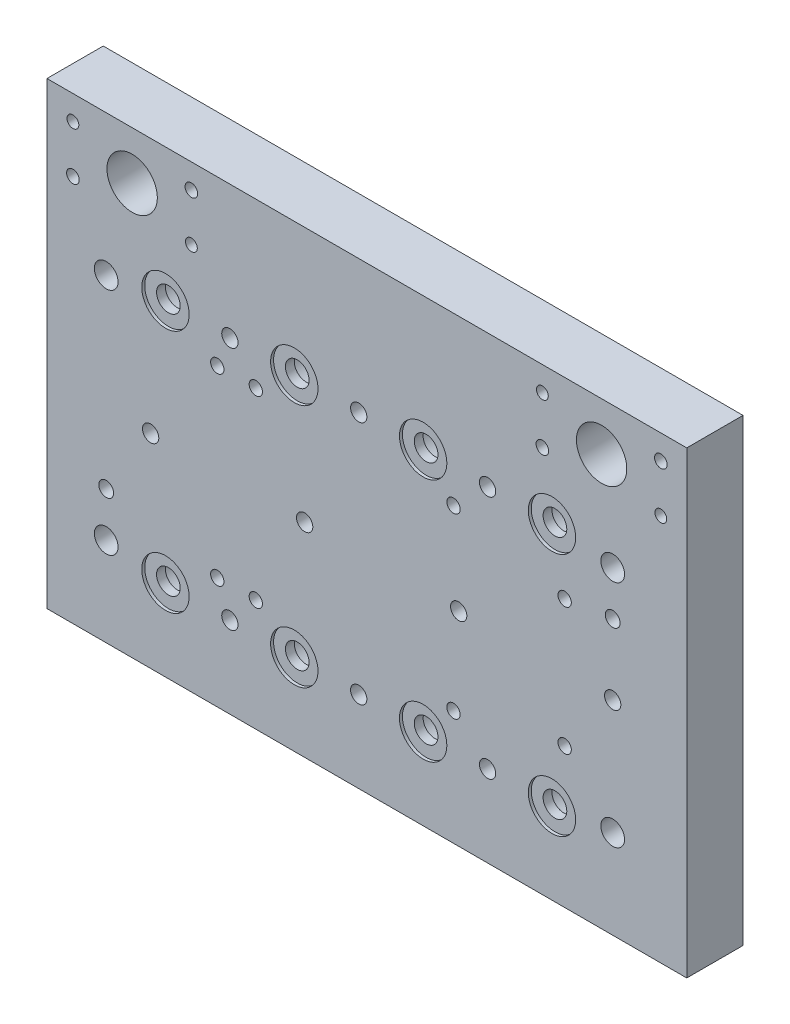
ISO-10303-21;
HEADER;
FILE_DESCRIPTION(('STEP AP214'),'2;1');
FILE_NAME('part.step','',(''),(''),'','','');
FILE_SCHEMA(('AUTOMOTIVE_DESIGN { 1 0 10303 214 1 1 1 1 }'));
ENDSEC;
DATA;
#1=APPLICATION_CONTEXT('core data for automotive mechanical design processes');
#2=APPLICATION_PROTOCOL_DEFINITION('international standard','automotive_design',2000,#1);
#3=PRODUCT_CONTEXT('',#1,'mechanical');
#4=PRODUCT('Part','Part','',(#3));
#5=PRODUCT_RELATED_PRODUCT_CATEGORY('part','',(#4));
#6=PRODUCT_DEFINITION_FORMATION('','',#4);
#7=PRODUCT_DEFINITION_CONTEXT('part definition',#1,'design');
#8=PRODUCT_DEFINITION('design','',#6,#7);
#9=PRODUCT_DEFINITION_SHAPE('','',#8);
#10=(LENGTH_UNIT() NAMED_UNIT(*) SI_UNIT(.MILLI.,.METRE.));
#11=(NAMED_UNIT(*) PLANE_ANGLE_UNIT() SI_UNIT($,.RADIAN.));
#12=(NAMED_UNIT(*) SI_UNIT($,.STERADIAN.) SOLID_ANGLE_UNIT());
#13=UNCERTAINTY_MEASURE_WITH_UNIT(LENGTH_MEASURE(1.E-05),#10,'distance_accuracy_value','');
#14=(GEOMETRIC_REPRESENTATION_CONTEXT(3) GLOBAL_UNCERTAINTY_ASSIGNED_CONTEXT((#13)) GLOBAL_UNIT_ASSIGNED_CONTEXT((#10,
#11,#12)) REPRESENTATION_CONTEXT('',''));
#15=CARTESIAN_POINT('',(0.,0.,0.));
#16=DIRECTION('',(0.,0.,1.));
#17=DIRECTION('',(1.,0.,0.));
#18=AXIS2_PLACEMENT_3D('',#15,#16,#17);
#19=CARTESIAN_POINT('',(0.,-310.000000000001,38.));
#20=DIRECTION('',(0.,0.,1.));
#21=DIRECTION('',(1.,0.,0.));
#22=AXIS2_PLACEMENT_3D('',#19,#20,#21);
#23=PLANE('',#22);
#24=CARTESIAN_POINT('',(349.551704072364,-129.5,38.));
#25=DIRECTION('',(0.,0.,-1.));
#26=DIRECTION('',(0.,1.,0.));
#27=AXIS2_PLACEMENT_3D('',#24,#25,#26);
#28=CIRCLE('',#27,4.5);
#29=CARTESIAN_POINT('',(349.551704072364,-125.,38.));
#30=VERTEX_POINT('',#29);
#31=EDGE_CURVE('E568',#30,#30,#28,.T.);
#32=ORIENTED_EDGE('',*,*,#31,.T.);
#33=EDGE_LOOP('',(#32));
#34=FACE_BOUND('',#33,.T.);
#35=CARTESIAN_POINT('',(115.,-234.5,38.));
#36=DIRECTION('',(0.,0.,-1.));
#37=DIRECTION('',(0.,1.,0.));
#38=AXIS2_PLACEMENT_3D('',#35,#36,#37);
#39=CIRCLE('',#38,4.5);
#40=CARTESIAN_POINT('',(115.,-230.,38.));
#41=VERTEX_POINT('',#40);
#42=EDGE_CURVE('E590',#41,#41,#39,.T.);
#43=ORIENTED_EDGE('',*,*,#42,.T.);
#44=EDGE_LOOP('',(#43));
#45=FACE_BOUND('',#44,.T.);
#46=CARTESIAN_POINT('',(349.551704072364,-215.5,38.));
#47=DIRECTION('',(0.,0.,-1.));
#48=DIRECTION('',(0.,1.,0.));
#49=AXIS2_PLACEMENT_3D('',#46,#47,#48);
#50=CIRCLE('',#49,4.5);
#51=CARTESIAN_POINT('',(349.551704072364,-211.,38.));
#52=VERTEX_POINT('',#51);
#53=EDGE_CURVE('E612',#52,#52,#50,.T.);
#54=ORIENTED_EDGE('',*,*,#53,.T.);
#55=EDGE_LOOP('',(#54));
#56=FACE_BOUND('',#55,.T.);
#57=CARTESIAN_POINT('',(141.,-110.499999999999,38.));
#58=DIRECTION('',(0.,0.,-1.));
#59=DIRECTION('',(0.,1.,0.));
#60=AXIS2_PLACEMENT_3D('',#57,#58,#59);
#61=CIRCLE('',#60,4.5);
#62=CARTESIAN_POINT('',(141.,-105.999999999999,38.));
#63=VERTEX_POINT('',#62);
#64=EDGE_CURVE('E634',#63,#63,#61,.T.);
#65=ORIENTED_EDGE('',*,*,#64,.T.);
#66=EDGE_LOOP('',(#65));
#67=FACE_BOUND('',#66,.T.);
#68=CARTESIAN_POINT('',(40.,-220.000000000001,38.));
#69=DIRECTION('',(0.,0.,1.));
#70=DIRECTION('',(1.,0.,0.));
#71=AXIS2_PLACEMENT_3D('',#68,#69,#70);
#72=CIRCLE('',#71,5.);
#73=CARTESIAN_POINT('',(45.,-220.000000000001,38.));
#74=VERTEX_POINT('',#73);
#75=EDGE_CURVE('E236',#74,#74,#72,.T.);
#76=ORIENTED_EDGE('',*,*,#75,.F.);
#77=EDGE_LOOP('',(#76));
#78=FACE_BOUND('',#77,.T.);
#79=CARTESIAN_POINT('',(382.,-125.,38.));
#80=DIRECTION('',(0.,0.,1.));
#81=DIRECTION('',(1.,0.,0.));
#82=AXIS2_PLACEMENT_3D('',#79,#80,#81);
#83=CIRCLE('',#82,4.99999999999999);
#84=CARTESIAN_POINT('',(387.,-125.,38.));
#85=VERTEX_POINT('',#84);
#86=EDGE_CURVE('E242',#85,#85,#83,.T.);
#87=ORIENTED_EDGE('',*,*,#86,.F.);
#88=EDGE_LOOP('',(#87));
#89=FACE_BOUND('',#88,.T.);
#90=CARTESIAN_POINT('',(210.5,-89.9999999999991,38.));
#91=DIRECTION('',(0.,0.,-1.));
#92=DIRECTION('',(-1.,0.,0.));
#93=AXIS2_PLACEMENT_3D('',#90,#91,#92);
#94=CIRCLE('',#93,5.49999999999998);
#95=CARTESIAN_POINT('',(205.,-89.9999999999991,38.));
#96=VERTEX_POINT('',#95);
#97=EDGE_CURVE('E260',#96,#96,#94,.T.);
#98=ORIENTED_EDGE('',*,*,#97,.T.);
#99=EDGE_LOOP('',(#98));
#100=FACE_BOUND('',#99,.T.);
#101=CARTESIAN_POINT('',(382.,-172.499999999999,38.));
#102=DIRECTION('',(0.,0.,-1.));
#103=DIRECTION('',(-1.,0.,0.));
#104=AXIS2_PLACEMENT_3D('',#101,#102,#103);
#105=CIRCLE('',#104,5.50000000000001);
#106=CARTESIAN_POINT('',(376.5,-172.499999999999,38.));
#107=VERTEX_POINT('',#106);
#108=EDGE_CURVE('E284',#107,#107,#105,.T.);
#109=ORIENTED_EDGE('',*,*,#108,.T.);
#110=EDGE_LOOP('',(#109));
#111=FACE_BOUND('',#110,.T.);
#112=CARTESIAN_POINT('',(210.5,-255.000000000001,38.));
#113=DIRECTION('',(0.,0.,-1.));
#114=DIRECTION('',(-1.,0.,0.));
#115=AXIS2_PLACEMENT_3D('',#112,#113,#114);
#116=CIRCLE('',#115,5.49999999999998);
#117=CARTESIAN_POINT('',(205.,-255.000000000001,38.));
#118=VERTEX_POINT('',#117);
#119=EDGE_CURVE('E308',#118,#118,#116,.T.);
#120=ORIENTED_EDGE('',*,*,#119,.T.);
#121=EDGE_LOOP('',(#120));
#122=FACE_BOUND('',#121,.T.);
#123=CARTESIAN_POINT('',(278.,-172.499999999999,38.));
#124=DIRECTION('',(0.,0.,-1.));
#125=DIRECTION('',(-1.,0.,0.));
#126=AXIS2_PLACEMENT_3D('',#123,#124,#125);
#127=CIRCLE('',#126,5.50000000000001);
#128=CARTESIAN_POINT('',(272.5,-172.499999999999,38.));
#129=VERTEX_POINT('',#128);
#130=EDGE_CURVE('E332',#129,#129,#127,.T.);
#131=ORIENTED_EDGE('',*,*,#130,.T.);
#132=EDGE_LOOP('',(#131));
#133=FACE_BOUND('',#132,.T.);
#134=CARTESIAN_POINT('',(70.0000000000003,-172.499999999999,38.));
#135=DIRECTION('',(0.,0.,-1.));
#136=DIRECTION('',(-1.,0.,0.));
#137=AXIS2_PLACEMENT_3D('',#134,#135,#136);
#138=CIRCLE('',#137,5.49999999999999);
#139=CARTESIAN_POINT('',(64.5000000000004,-172.499999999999,38.));
#140=VERTEX_POINT('',#139);
#141=EDGE_CURVE('E356',#140,#140,#138,.T.);
#142=ORIENTED_EDGE('',*,*,#141,.T.);
#143=EDGE_LOOP('',(#142));
#144=FACE_BOUND('',#143,.T.);
#145=CARTESIAN_POINT('',(341.,-255.000000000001,38.));
#146=DIRECTION('',(0.,0.,1.));
#147=DIRECTION('',(1.,0.,0.));
#148=AXIS2_PLACEMENT_3D('',#145,#146,#147);
#149=CIRCLE('',#148,16.0000000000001);
#150=CARTESIAN_POINT('',(357.,-255.000000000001,38.));
#151=VERTEX_POINT('',#150);
#152=EDGE_CURVE('E128',#151,#151,#149,.T.);
#153=ORIENTED_EDGE('',*,*,#152,.F.);
#154=EDGE_LOOP('',(#153));
#155=FACE_BOUND('',#154,.T.);
#156=CARTESIAN_POINT('',(254.,-255.000000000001,38.));
#157=DIRECTION('',(0.,0.,1.));
#158=DIRECTION('',(1.,0.,0.));
#159=AXIS2_PLACEMENT_3D('',#156,#157,#158);
#160=CIRCLE('',#159,16.);
#161=CARTESIAN_POINT('',(270.,-255.000000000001,38.));
#162=VERTEX_POINT('',#161);
#163=EDGE_CURVE('E402',#162,#162,#160,.T.);
#164=ORIENTED_EDGE('',*,*,#163,.F.);
#165=EDGE_LOOP('',(#164));
#166=FACE_BOUND('',#165,.T.);
#167=CARTESIAN_POINT('',(167.,-255.000000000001,38.));
#168=DIRECTION('',(0.,0.,1.));
#169=DIRECTION('',(1.,0.,0.));
#170=AXIS2_PLACEMENT_3D('',#167,#168,#169);
#171=CIRCLE('',#170,16.);
#172=CARTESIAN_POINT('',(183.,-255.000000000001,38.));
#173=VERTEX_POINT('',#172);
#174=EDGE_CURVE('E408',#173,#173,#171,.T.);
#175=ORIENTED_EDGE('',*,*,#174,.F.);
#176=EDGE_LOOP('',(#175));
#177=FACE_BOUND('',#176,.T.);
#178=CARTESIAN_POINT('',(80.0000000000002,-255.000000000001,38.));
#179=DIRECTION('',(0.,0.,1.));
#180=DIRECTION('',(1.,0.,0.));
#181=AXIS2_PLACEMENT_3D('',#178,#179,#180);
#182=CIRCLE('',#181,16.);
#183=CARTESIAN_POINT('',(96.0000000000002,-255.000000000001,38.));
#184=VERTEX_POINT('',#183);
#185=EDGE_CURVE('E414',#184,#184,#182,.T.);
#186=ORIENTED_EDGE('',*,*,#185,.F.);
#187=EDGE_LOOP('',(#186));
#188=FACE_BOUND('',#187,.T.);
#189=CARTESIAN_POINT('',(80.0000000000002,-90.0000000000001,38.));
#190=DIRECTION('',(0.,0.,1.));
#191=DIRECTION('',(1.,0.,0.));
#192=AXIS2_PLACEMENT_3D('',#189,#190,#191);
#193=CIRCLE('',#192,16.);
#194=CARTESIAN_POINT('',(96.0000000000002,-90.0000000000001,38.));
#195=VERTEX_POINT('',#194);
#196=EDGE_CURVE('E420',#195,#195,#193,.T.);
#197=ORIENTED_EDGE('',*,*,#196,.F.);
#198=EDGE_LOOP('',(#197));
#199=FACE_BOUND('',#198,.T.);
#200=CARTESIAN_POINT('',(167.,-90.0000000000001,38.));
#201=DIRECTION('',(0.,0.,1.));
#202=DIRECTION('',(1.,0.,0.));
#203=AXIS2_PLACEMENT_3D('',#200,#201,#202);
#204=CIRCLE('',#203,16.);
#205=CARTESIAN_POINT('',(183.,-90.0000000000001,38.));
#206=VERTEX_POINT('',#205);
#207=EDGE_CURVE('E426',#206,#206,#204,.T.);
#208=ORIENTED_EDGE('',*,*,#207,.F.);
#209=EDGE_LOOP('',(#208));
#210=FACE_BOUND('',#209,.T.);
#211=CARTESIAN_POINT('',(254.,-90.0000000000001,38.));
#212=DIRECTION('',(0.,0.,1.));
#213=DIRECTION('',(1.,0.,0.));
#214=AXIS2_PLACEMENT_3D('',#211,#212,#213);
#215=CIRCLE('',#214,16.);
#216=CARTESIAN_POINT('',(270.,-90.0000000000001,38.));
#217=VERTEX_POINT('',#216);
#218=EDGE_CURVE('E432',#217,#217,#215,.T.);
#219=ORIENTED_EDGE('',*,*,#218,.F.);
#220=EDGE_LOOP('',(#219));
#221=FACE_BOUND('',#220,.T.);
#222=CARTESIAN_POINT('',(341.,-90.0000000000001,38.));
#223=DIRECTION('',(0.,0.,1.));
#224=DIRECTION('',(1.,0.,0.));
#225=AXIS2_PLACEMENT_3D('',#222,#223,#224);
#226=CIRCLE('',#225,16.);
#227=CARTESIAN_POINT('',(357.,-90.0000000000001,38.));
#228=VERTEX_POINT('',#227);
#229=EDGE_CURVE('E438',#228,#228,#226,.T.);
#230=ORIENTED_EDGE('',*,*,#229,.F.);
#231=EDGE_LOOP('',(#230));
#232=FACE_BOUND('',#231,.T.);
#233=CARTESIAN_POINT('',(374.5,-32.5000000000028,38.));
#234=DIRECTION('',(0.,0.,-1.));
#235=DIRECTION('',(-1.,0.,0.));
#236=AXIS2_PLACEMENT_3D('',#233,#234,#235);
#237=CIRCLE('',#236,17.);
#238=CARTESIAN_POINT('',(357.5,-32.5000000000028,38.));
#239=VERTEX_POINT('',#238);
#240=EDGE_CURVE('E447',#239,#239,#237,.T.);
#241=ORIENTED_EDGE('',*,*,#240,.T.);
#242=EDGE_LOOP('',(#241));
#243=FACE_BOUND('',#242,.T.);
#244=CARTESIAN_POINT('',(57.5000000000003,-32.5000000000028,38.));
#245=DIRECTION('',(0.,0.,-1.));
#246=DIRECTION('',(-1.,0.,0.));
#247=AXIS2_PLACEMENT_3D('',#244,#245,#246);
#248=CIRCLE('',#247,17.);
#249=CARTESIAN_POINT('',(40.5000000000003,-32.5000000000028,38.));
#250=VERTEX_POINT('',#249);
#251=EDGE_CURVE('E453',#250,#250,#248,.T.);
#252=ORIENTED_EDGE('',*,*,#251,.T.);
#253=EDGE_LOOP('',(#252));
#254=FACE_BOUND('',#253,.T.);
#255=CARTESIAN_POINT('',(97.5,-16.5,38.));
#256=DIRECTION('',(0.,0.,-1.));
#257=DIRECTION('',(-1.,0.,0.));
#258=AXIS2_PLACEMENT_3D('',#255,#256,#257);
#259=CIRCLE('',#258,4.25000000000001);
#260=CARTESIAN_POINT('',(93.25,-16.5,38.));
#261=VERTEX_POINT('',#260);
#262=EDGE_CURVE('E459',#261,#261,#259,.T.);
#263=ORIENTED_EDGE('',*,*,#262,.T.);
#264=EDGE_LOOP('',(#263));
#265=FACE_BOUND('',#264,.T.);
#266=CARTESIAN_POINT('',(17.5,-48.5000000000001,38.));
#267=DIRECTION('',(0.,0.,-1.));
#268=DIRECTION('',(-1.,0.,0.));
#269=AXIS2_PLACEMENT_3D('',#266,#267,#268);
#270=CIRCLE('',#269,4.25);
#271=CARTESIAN_POINT('',(13.25,-48.5000000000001,38.));
#272=VERTEX_POINT('',#271);
#273=EDGE_CURVE('E465',#272,#272,#270,.T.);
#274=ORIENTED_EDGE('',*,*,#273,.T.);
#275=EDGE_LOOP('',(#274));
#276=FACE_BOUND('',#275,.T.);
#277=CARTESIAN_POINT('',(97.5,-48.5000000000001,38.));
#278=DIRECTION('',(0.,0.,-1.));
#279=DIRECTION('',(-1.,0.,0.));
#280=AXIS2_PLACEMENT_3D('',#277,#278,#279);
#281=CIRCLE('',#280,4.00000000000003);
#282=CARTESIAN_POINT('',(93.5,-48.5000000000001,38.));
#283=VERTEX_POINT('',#282);
#284=EDGE_CURVE('E471',#283,#283,#281,.T.);
#285=ORIENTED_EDGE('',*,*,#284,.T.);
#286=EDGE_LOOP('',(#285));
#287=FACE_BOUND('',#286,.T.);
#288=CARTESIAN_POINT('',(17.5,-16.5,38.));
#289=DIRECTION('',(0.,0.,-1.));
#290=DIRECTION('',(-1.,0.,0.));
#291=AXIS2_PLACEMENT_3D('',#288,#289,#290);
#292=CIRCLE('',#291,4.00000000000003);
#293=CARTESIAN_POINT('',(13.5,-16.5,38.));
#294=VERTEX_POINT('',#293);
#295=EDGE_CURVE('E477',#294,#294,#292,.T.);
#296=ORIENTED_EDGE('',*,*,#295,.T.);
#297=EDGE_LOOP('',(#296));
#298=FACE_BOUND('',#297,.T.);
#299=CARTESIAN_POINT('',(414.5,-16.5000000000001,38.));
#300=DIRECTION('',(0.,0.,-1.));
#301=DIRECTION('',(-1.,0.,0.));
#302=AXIS2_PLACEMENT_3D('',#299,#300,#301);
#303=CIRCLE('',#302,4.24999999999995);
#304=CARTESIAN_POINT('',(410.25,-16.5000000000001,38.));
#305=VERTEX_POINT('',#304);
#306=EDGE_CURVE('E483',#305,#305,#303,.T.);
#307=ORIENTED_EDGE('',*,*,#306,.T.);
#308=EDGE_LOOP('',(#307));
#309=FACE_BOUND('',#308,.T.);
#310=CARTESIAN_POINT('',(334.5,-48.5000000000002,38.));
#311=DIRECTION('',(0.,0.,-1.));
#312=DIRECTION('',(-1.,0.,0.));
#313=AXIS2_PLACEMENT_3D('',#310,#311,#312);
#314=CIRCLE('',#313,4.24999999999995);
#315=CARTESIAN_POINT('',(330.25,-48.5000000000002,38.));
#316=VERTEX_POINT('',#315);
#317=EDGE_CURVE('E489',#316,#316,#314,.T.);
#318=ORIENTED_EDGE('',*,*,#317,.T.);
#319=EDGE_LOOP('',(#318));
#320=FACE_BOUND('',#319,.T.);
#321=CARTESIAN_POINT('',(414.5,-48.5000000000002,38.));
#322=DIRECTION('',(0.,0.,-1.));
#323=DIRECTION('',(-1.,0.,0.));
#324=AXIS2_PLACEMENT_3D('',#321,#322,#323);
#325=CIRCLE('',#324,3.99999999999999);
#326=CARTESIAN_POINT('',(410.5,-48.5000000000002,38.));
#327=VERTEX_POINT('',#326);
#328=EDGE_CURVE('E495',#327,#327,#325,.T.);
#329=ORIENTED_EDGE('',*,*,#328,.T.);
#330=EDGE_LOOP('',(#329));
#331=FACE_BOUND('',#330,.T.);
#332=CARTESIAN_POINT('',(334.5,-16.5,38.));
#333=DIRECTION('',(0.,0.,-1.));
#334=DIRECTION('',(-1.,0.,0.));
#335=AXIS2_PLACEMENT_3D('',#332,#333,#334);
#336=CIRCLE('',#335,3.99999999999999);
#337=CARTESIAN_POINT('',(330.5,-16.5,38.));
#338=VERTEX_POINT('',#337);
#339=EDGE_CURVE('E501',#338,#338,#336,.T.);
#340=ORIENTED_EDGE('',*,*,#339,.T.);
#341=EDGE_LOOP('',(#340));
#342=FACE_BOUND('',#341,.T.);
#343=CARTESIAN_POINT('',(382.,-250.000000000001,38.));
#344=DIRECTION('',(0.,0.,1.));
#345=DIRECTION('',(1.,0.,0.));
#346=AXIS2_PLACEMENT_3D('',#343,#344,#345);
#347=CIRCLE('',#346,7.99999999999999);
#348=CARTESIAN_POINT('',(390.,-250.000000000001,38.));
#349=VERTEX_POINT('',#348);
#350=EDGE_CURVE('E504',#349,#349,#347,.T.);
#351=ORIENTED_EDGE('',*,*,#350,.F.);
#352=EDGE_LOOP('',(#351));
#353=FACE_BOUND('',#352,.T.);
#354=CARTESIAN_POINT('',(382.,-95.0000000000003,38.));
#355=DIRECTION('',(0.,0.,1.));
#356=DIRECTION('',(1.,0.,0.));
#357=AXIS2_PLACEMENT_3D('',#354,#355,#356);
#358=CIRCLE('',#357,7.99999999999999);
#359=CARTESIAN_POINT('',(390.,-95.0000000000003,38.));
#360=VERTEX_POINT('',#359);
#361=EDGE_CURVE('E510',#360,#360,#358,.T.);
#362=ORIENTED_EDGE('',*,*,#361,.F.);
#363=EDGE_LOOP('',(#362));
#364=FACE_BOUND('',#363,.T.);
#365=CARTESIAN_POINT('',(40.,-95.0000000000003,38.));
#366=DIRECTION('',(0.,0.,1.));
#367=DIRECTION('',(1.,0.,0.));
#368=AXIS2_PLACEMENT_3D('',#365,#366,#367);
#369=CIRCLE('',#368,8.);
#370=CARTESIAN_POINT('',(48.,-95.0000000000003,38.));
#371=VERTEX_POINT('',#370);
#372=EDGE_CURVE('E516',#371,#371,#369,.T.);
#373=ORIENTED_EDGE('',*,*,#372,.F.);
#374=EDGE_LOOP('',(#373));
#375=FACE_BOUND('',#374,.T.);
#376=CARTESIAN_POINT('',(40.,-250.000000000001,38.));
#377=DIRECTION('',(0.,0.,1.));
#378=DIRECTION('',(1.,0.,0.));
#379=AXIS2_PLACEMENT_3D('',#376,#377,#378);
#380=CIRCLE('',#379,8.);
#381=CARTESIAN_POINT('',(48.,-250.000000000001,38.));
#382=VERTEX_POINT('',#381);
#383=EDGE_CURVE('E108',#382,#382,#380,.T.);
#384=ORIENTED_EDGE('',*,*,#383,.F.);
#385=EDGE_LOOP('',(#384));
#386=FACE_BOUND('',#385,.T.);
#387=DIRECTION('',(0.,-1.,0.));
#388=VECTOR('',#387,1.);
#389=CARTESIAN_POINT('',(0.,0.,38.));
#390=LINE('',#389,#388);
#391=CARTESIAN_POINT('',(0.,0.,38.));
#392=VERTEX_POINT('',#391);
#393=CARTESIAN_POINT('',(0.,-310.000000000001,38.));
#394=VERTEX_POINT('',#393);
#395=EDGE_CURVE('E115',#392,#394,#390,.T.);
#396=ORIENTED_EDGE('',*,*,#395,.T.);
#397=DIRECTION('',(1.,0.,0.));
#398=VECTOR('',#397,1.);
#399=CARTESIAN_POINT('',(0.,-310.000000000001,38.));
#400=LINE('',#399,#398);
#401=CARTESIAN_POINT('',(432.,-310.000000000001,38.));
#402=VERTEX_POINT('',#401);
#403=EDGE_CURVE('E100',#394,#402,#400,.T.);
#404=ORIENTED_EDGE('',*,*,#403,.T.);
#405=DIRECTION('',(0.,1.,0.));
#406=VECTOR('',#405,1.);
#407=CARTESIAN_POINT('',(432.,0.,38.));
#408=LINE('',#407,#406);
#409=CARTESIAN_POINT('',(432.,0.,38.));
#410=VERTEX_POINT('',#409);
#411=EDGE_CURVE('E67',#402,#410,#408,.T.);
#412=ORIENTED_EDGE('',*,*,#411,.T.);
#413=DIRECTION('',(-1.,0.,0.));
#414=VECTOR('',#413,1.);
#415=CARTESIAN_POINT('',(0.,0.,38.));
#416=LINE('',#415,#414);
#417=EDGE_CURVE('E62',#410,#392,#416,.T.);
#418=ORIENTED_EDGE('',*,*,#417,.T.);
#419=EDGE_LOOP('',(#396,#404,#412,#418));
#420=FACE_BOUND('',#419,.T.);
#421=CARTESIAN_POINT('',(174.,-172.499999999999,38.));
#422=DIRECTION('',(0.,0.,-1.));
#423=DIRECTION('',(-1.,0.,0.));
#424=AXIS2_PLACEMENT_3D('',#421,#422,#423);
#425=CIRCLE('',#424,5.49999999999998);
#426=CARTESIAN_POINT('',(168.5,-172.499999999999,38.));
#427=VERTEX_POINT('',#426);
#428=EDGE_CURVE('E344',#427,#427,#425,.T.);
#429=ORIENTED_EDGE('',*,*,#428,.T.);
#430=EDGE_LOOP('',(#429));
#431=FACE_BOUND('',#430,.T.);
#432=CARTESIAN_POINT('',(123.499999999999,-255.000000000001,38.));
#433=DIRECTION('',(0.,0.,-1.));
#434=DIRECTION('',(-1.,0.,0.));
#435=AXIS2_PLACEMENT_3D('',#432,#433,#434);
#436=CIRCLE('',#435,5.49999999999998);
#437=CARTESIAN_POINT('',(117.999999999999,-255.000000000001,38.));
#438=VERTEX_POINT('',#437);
#439=EDGE_CURVE('E320',#438,#438,#436,.T.);
#440=ORIENTED_EDGE('',*,*,#439,.T.);
#441=EDGE_LOOP('',(#440));
#442=FACE_BOUND('',#441,.T.);
#443=CARTESIAN_POINT('',(297.5,-255.000000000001,38.));
#444=DIRECTION('',(0.,0.,-1.));
#445=DIRECTION('',(-1.,0.,0.));
#446=AXIS2_PLACEMENT_3D('',#443,#444,#445);
#447=CIRCLE('',#446,5.50000000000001);
#448=CARTESIAN_POINT('',(292.,-255.000000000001,38.));
#449=VERTEX_POINT('',#448);
#450=EDGE_CURVE('E296',#449,#449,#447,.T.);
#451=ORIENTED_EDGE('',*,*,#450,.T.);
#452=EDGE_LOOP('',(#451));
#453=FACE_BOUND('',#452,.T.);
#454=CARTESIAN_POINT('',(123.5,-89.9999999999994,38.));
#455=DIRECTION('',(0.,0.,-1.));
#456=DIRECTION('',(-1.,0.,0.));
#457=AXIS2_PLACEMENT_3D('',#454,#455,#456);
#458=CIRCLE('',#457,5.49999999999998);
#459=CARTESIAN_POINT('',(118.,-89.9999999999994,38.));
#460=VERTEX_POINT('',#459);
#461=EDGE_CURVE('E272',#460,#460,#458,.T.);
#462=ORIENTED_EDGE('',*,*,#461,.T.);
#463=EDGE_LOOP('',(#462));
#464=FACE_BOUND('',#463,.T.);
#465=CARTESIAN_POINT('',(297.5,-89.9999999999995,38.));
#466=DIRECTION('',(0.,0.,-1.));
#467=DIRECTION('',(-1.,0.,0.));
#468=AXIS2_PLACEMENT_3D('',#465,#466,#467);
#469=CIRCLE('',#468,5.50000000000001);
#470=CARTESIAN_POINT('',(292.,-89.9999999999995,38.));
#471=VERTEX_POINT('',#470);
#472=EDGE_CURVE('E248',#471,#471,#469,.T.);
#473=ORIENTED_EDGE('',*,*,#472,.T.);
#474=EDGE_LOOP('',(#473));
#475=FACE_BOUND('',#474,.T.);
#476=CARTESIAN_POINT('',(141.,-234.5,38.));
#477=DIRECTION('',(0.,0.,-1.));
#478=DIRECTION('',(0.,1.,0.));
#479=AXIS2_PLACEMENT_3D('',#476,#477,#478);
#480=CIRCLE('',#479,4.5);
#481=CARTESIAN_POINT('',(141.,-230.,38.));
#482=VERTEX_POINT('',#481);
#483=EDGE_CURVE('E544',#482,#482,#480,.T.);
#484=ORIENTED_EDGE('',*,*,#483,.T.);
#485=EDGE_LOOP('',(#484));
#486=FACE_BOUND('',#485,.T.);
#487=CARTESIAN_POINT('',(115.,-110.499999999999,38.));
#488=DIRECTION('',(0.,0.,-1.));
#489=DIRECTION('',(0.,1.,0.));
#490=AXIS2_PLACEMENT_3D('',#487,#488,#489);
#491=CIRCLE('',#490,4.5);
#492=CARTESIAN_POINT('',(115.,-105.999999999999,38.));
#493=VERTEX_POINT('',#492);
#494=EDGE_CURVE('E548',#493,#493,#491,.T.);
#495=ORIENTED_EDGE('',*,*,#494,.T.);
#496=EDGE_LOOP('',(#495));
#497=FACE_BOUND('',#496,.T.);
#498=CARTESIAN_POINT('',(274.5,-232.5,38.));
#499=DIRECTION('',(0.,0.,-1.));
#500=DIRECTION('',(0.,1.,0.));
#501=AXIS2_PLACEMENT_3D('',#498,#499,#500);
#502=CIRCLE('',#501,4.5);
#503=CARTESIAN_POINT('',(274.5,-228.,38.));
#504=VERTEX_POINT('',#503);
#505=EDGE_CURVE('E552',#504,#504,#502,.T.);
#506=ORIENTED_EDGE('',*,*,#505,.T.);
#507=EDGE_LOOP('',(#506));
#508=FACE_BOUND('',#507,.T.);
#509=CARTESIAN_POINT('',(274.5,-112.5,38.));
#510=DIRECTION('',(0.,0.,-1.));
#511=DIRECTION('',(0.,1.,0.));
#512=AXIS2_PLACEMENT_3D('',#509,#510,#511);
#513=CIRCLE('',#512,4.5);
#514=CARTESIAN_POINT('',(274.5,-108.,38.));
#515=VERTEX_POINT('',#514);
#516=EDGE_CURVE('E555',#515,#515,#513,.T.);
#517=ORIENTED_EDGE('',*,*,#516,.T.);
#518=EDGE_LOOP('',(#517));
#519=FACE_BOUND('',#518,.T.);
#520=ADVANCED_FACE('F45',(#34,#45,#56,#67,#78,#89,#100,#111,#122,#133,#144,#155,#166,#177,#188,
#199,#210,#221,#232,#243,#254,#265,#276,#287,#298,#309,#320,#331,#342,#353,#364,#375,#386,#420,
#431,#442,#453,#464,#475,#486,#497,#508,#519),#23,.T.);
#521=CARTESIAN_POINT('',(80.0000000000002,-255.000000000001,0.));
#522=DIRECTION('',(0.,0.,1.));
#523=DIRECTION('',(1.,0.,0.));
#524=AXIS2_PLACEMENT_3D('',#521,#522,#523);
#525=CYLINDRICAL_SURFACE('',#524,8.00000000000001);
#526=CARTESIAN_POINT('',(80.0000000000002,-255.000000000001,36.));
#527=DIRECTION('',(0.,0.,1.));
#528=DIRECTION('',(1.,0.,0.));
#529=AXIS2_PLACEMENT_3D('',#526,#527,#528);
#530=CIRCLE('',#529,8.00000000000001);
#531=CARTESIAN_POINT('',(88.0000000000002,-255.000000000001,36.));
#532=VERTEX_POINT('',#531);
#533=EDGE_CURVE('E148',#532,#532,#530,.T.);
#534=ORIENTED_EDGE('',*,*,#533,.T.);
#535=EDGE_LOOP('',(#534));
#536=FACE_BOUND('',#535,.T.);
#537=CARTESIAN_POINT('',(80.0000000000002,-255.000000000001,30.));
#538=DIRECTION('',(0.,0.,-1.));
#539=DIRECTION('',(-1.,0.,0.));
#540=AXIS2_PLACEMENT_3D('',#537,#538,#539);
#541=CIRCLE('',#540,8.00000000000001);
#542=CARTESIAN_POINT('',(72.0000000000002,-255.000000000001,30.));
#543=VERTEX_POINT('',#542);
#544=EDGE_CURVE('E49',#543,#543,#541,.F.);
#545=ORIENTED_EDGE('',*,*,#544,.F.);
#546=EDGE_LOOP('',(#545));
#547=FACE_BOUND('',#546,.T.);
#548=ADVANCED_FACE('F527',(#536,#547),#525,.F.);
#549=CARTESIAN_POINT('',(167.,-255.000000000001,0.));
#550=DIRECTION('',(0.,0.,1.));
#551=DIRECTION('',(1.,0.,0.));
#552=AXIS2_PLACEMENT_3D('',#549,#550,#551);
#553=CYLINDRICAL_SURFACE('',#552,8.00000000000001);
#554=CARTESIAN_POINT('',(167.,-255.000000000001,36.));
#555=DIRECTION('',(0.,0.,1.));
#556=DIRECTION('',(1.,0.,0.));
#557=AXIS2_PLACEMENT_3D('',#554,#555,#556);
#558=CIRCLE('',#557,8.00000000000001);
#559=CARTESIAN_POINT('',(175.,-255.000000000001,36.));
#560=VERTEX_POINT('',#559);
#561=EDGE_CURVE('E215',#560,#560,#558,.T.);
#562=ORIENTED_EDGE('',*,*,#561,.T.);
#563=EDGE_LOOP('',(#562));
#564=FACE_BOUND('',#563,.T.);
#565=CARTESIAN_POINT('',(167.,-255.000000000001,30.));
#566=DIRECTION('',(0.,0.,-1.));
#567=DIRECTION('',(-1.,0.,0.));
#568=AXIS2_PLACEMENT_3D('',#565,#566,#567);
#569=CIRCLE('',#568,8.00000000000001);
#570=CARTESIAN_POINT('',(159.,-255.000000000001,30.));
#571=VERTEX_POINT('',#570);
#572=EDGE_CURVE('E174',#571,#571,#569,.F.);
#573=ORIENTED_EDGE('',*,*,#572,.F.);
#574=EDGE_LOOP('',(#573));
#575=FACE_BOUND('',#574,.T.);
#576=ADVANCED_FACE('F658',(#564,#575),#553,.F.);
#577=CARTESIAN_POINT('',(254.,-255.000000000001,0.));
#578=DIRECTION('',(0.,0.,1.));
#579=DIRECTION('',(1.,0.,0.));
#580=AXIS2_PLACEMENT_3D('',#577,#578,#579);
#581=CYLINDRICAL_SURFACE('',#580,7.99999999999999);
#582=CARTESIAN_POINT('',(254.,-255.000000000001,36.));
#583=DIRECTION('',(0.,0.,1.));
#584=DIRECTION('',(1.,0.,0.));
#585=AXIS2_PLACEMENT_3D('',#582,#583,#584);
#586=CIRCLE('',#585,7.99999999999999);
#587=CARTESIAN_POINT('',(262.,-255.000000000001,36.));
#588=VERTEX_POINT('',#587);
#589=EDGE_CURVE('E218',#588,#588,#586,.T.);
#590=ORIENTED_EDGE('',*,*,#589,.T.);
#591=EDGE_LOOP('',(#590));
#592=FACE_BOUND('',#591,.T.);
#593=CARTESIAN_POINT('',(254.,-255.000000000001,30.));
#594=DIRECTION('',(0.,0.,-1.));
#595=DIRECTION('',(-1.,0.,0.));
#596=AXIS2_PLACEMENT_3D('',#593,#594,#595);
#597=CIRCLE('',#596,7.99999999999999);
#598=CARTESIAN_POINT('',(246.,-255.000000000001,30.));
#599=VERTEX_POINT('',#598);
#600=EDGE_CURVE('E170',#599,#599,#597,.F.);
#601=ORIENTED_EDGE('',*,*,#600,.F.);
#602=EDGE_LOOP('',(#601));
#603=FACE_BOUND('',#602,.T.);
#604=ADVANCED_FACE('F664',(#592,#603),#581,.F.);
#605=CARTESIAN_POINT('',(341.,-255.000000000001,0.));
#606=DIRECTION('',(0.,0.,1.));
#607=DIRECTION('',(1.,0.,0.));
#608=AXIS2_PLACEMENT_3D('',#605,#606,#607);
#609=CYLINDRICAL_SURFACE('',#608,7.99999999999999);
#610=CARTESIAN_POINT('',(341.,-255.000000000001,36.));
#611=DIRECTION('',(0.,0.,1.));
#612=DIRECTION('',(1.,0.,0.));
#613=AXIS2_PLACEMENT_3D('',#610,#611,#612);
#614=CIRCLE('',#613,7.99999999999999);
#615=CARTESIAN_POINT('',(349.,-255.000000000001,36.));
#616=VERTEX_POINT('',#615);
#617=EDGE_CURVE('E221',#616,#616,#614,.T.);
#618=ORIENTED_EDGE('',*,*,#617,.T.);
#619=EDGE_LOOP('',(#618));
#620=FACE_BOUND('',#619,.T.);
#621=CARTESIAN_POINT('',(341.,-255.000000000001,30.));
#622=DIRECTION('',(0.,0.,-1.));
#623=DIRECTION('',(-1.,0.,0.));
#624=AXIS2_PLACEMENT_3D('',#621,#622,#623);
#625=CIRCLE('',#624,7.99999999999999);
#626=CARTESIAN_POINT('',(333.,-255.000000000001,30.));
#627=VERTEX_POINT('',#626);
#628=EDGE_CURVE('E165',#627,#627,#625,.F.);
#629=ORIENTED_EDGE('',*,*,#628,.F.);
#630=EDGE_LOOP('',(#629));
#631=FACE_BOUND('',#630,.T.);
#632=ADVANCED_FACE('F673',(#620,#631),#609,.F.);
#633=CARTESIAN_POINT('',(80.0000000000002,-90.0000000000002,0.));
#634=DIRECTION('',(0.,0.,1.));
#635=DIRECTION('',(1.,0.,0.));
#636=AXIS2_PLACEMENT_3D('',#633,#634,#635);
#637=CYLINDRICAL_SURFACE('',#636,8.00000000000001);
#638=CARTESIAN_POINT('',(80.0000000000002,-90.0000000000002,36.));
#639=DIRECTION('',(0.,0.,1.));
#640=DIRECTION('',(1.,0.,0.));
#641=AXIS2_PLACEMENT_3D('',#638,#639,#640);
#642=CIRCLE('',#641,8.00000000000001);
#643=CARTESIAN_POINT('',(88.0000000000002,-90.0000000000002,36.));
#644=VERTEX_POINT('',#643);
#645=EDGE_CURVE('E233',#644,#644,#642,.T.);
#646=ORIENTED_EDGE('',*,*,#645,.T.);
#647=EDGE_LOOP('',(#646));
#648=FACE_BOUND('',#647,.T.);
#649=CARTESIAN_POINT('',(80.0000000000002,-90.0000000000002,30.));
#650=DIRECTION('',(0.,0.,-1.));
#651=DIRECTION('',(-1.,0.,0.));
#652=AXIS2_PLACEMENT_3D('',#649,#650,#651);
#653=CIRCLE('',#652,8.00000000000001);
#654=CARTESIAN_POINT('',(72.0000000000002,-90.0000000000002,30.));
#655=VERTEX_POINT('',#654);
#656=EDGE_CURVE('E160',#655,#655,#653,.F.);
#657=ORIENTED_EDGE('',*,*,#656,.F.);
#658=EDGE_LOOP('',(#657));
#659=FACE_BOUND('',#658,.T.);
#660=ADVANCED_FACE('F677',(#648,#659),#637,.F.);
#661=CARTESIAN_POINT('',(167.,-90.0000000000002,0.));
#662=DIRECTION('',(0.,0.,1.));
#663=DIRECTION('',(1.,0.,0.));
#664=AXIS2_PLACEMENT_3D('',#661,#662,#663);
#665=CYLINDRICAL_SURFACE('',#664,8.00000000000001);
#666=CARTESIAN_POINT('',(167.,-90.0000000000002,36.));
#667=DIRECTION('',(0.,0.,1.));
#668=DIRECTION('',(1.,0.,0.));
#669=AXIS2_PLACEMENT_3D('',#666,#667,#668);
#670=CIRCLE('',#669,8.00000000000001);
#671=CARTESIAN_POINT('',(175.,-90.0000000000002,36.));
#672=VERTEX_POINT('',#671);
#673=EDGE_CURVE('E230',#672,#672,#670,.T.);
#674=ORIENTED_EDGE('',*,*,#673,.T.);
#675=EDGE_LOOP('',(#674));
#676=FACE_BOUND('',#675,.T.);
#677=CARTESIAN_POINT('',(167.,-90.0000000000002,30.));
#678=DIRECTION('',(0.,0.,-1.));
#679=DIRECTION('',(-1.,0.,0.));
#680=AXIS2_PLACEMENT_3D('',#677,#678,#679);
#681=CIRCLE('',#680,8.00000000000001);
#682=CARTESIAN_POINT('',(159.,-90.0000000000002,30.));
#683=VERTEX_POINT('',#682);
#684=EDGE_CURVE('E155',#683,#683,#681,.F.);
#685=ORIENTED_EDGE('',*,*,#684,.F.);
#686=EDGE_LOOP('',(#685));
#687=FACE_BOUND('',#686,.T.);
#688=ADVANCED_FACE('F686',(#676,#687),#665,.F.);
#689=CARTESIAN_POINT('',(254.,-90.0000000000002,0.));
#690=DIRECTION('',(0.,0.,1.));
#691=DIRECTION('',(1.,0.,0.));
#692=AXIS2_PLACEMENT_3D('',#689,#690,#691);
#693=CYLINDRICAL_SURFACE('',#692,7.99999999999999);
#694=CARTESIAN_POINT('',(254.,-90.0000000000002,36.));
#695=DIRECTION('',(0.,0.,1.));
#696=DIRECTION('',(1.,0.,0.));
#697=AXIS2_PLACEMENT_3D('',#694,#695,#696);
#698=CIRCLE('',#697,7.99999999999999);
#699=CARTESIAN_POINT('',(262.,-90.0000000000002,36.));
#700=VERTEX_POINT('',#699);
#701=EDGE_CURVE('E227',#700,#700,#698,.T.);
#702=ORIENTED_EDGE('',*,*,#701,.T.);
#703=EDGE_LOOP('',(#702));
#704=FACE_BOUND('',#703,.T.);
#705=CARTESIAN_POINT('',(254.,-90.0000000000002,30.));
#706=DIRECTION('',(0.,0.,-1.));
#707=DIRECTION('',(-1.,0.,0.));
#708=AXIS2_PLACEMENT_3D('',#705,#706,#707);
#709=CIRCLE('',#708,7.99999999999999);
#710=CARTESIAN_POINT('',(246.,-90.0000000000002,30.));
#711=VERTEX_POINT('',#710);
#712=EDGE_CURVE('E150',#711,#711,#709,.F.);
#713=ORIENTED_EDGE('',*,*,#712,.F.);
#714=EDGE_LOOP('',(#713));
#715=FACE_BOUND('',#714,.T.);
#716=ADVANCED_FACE('F682',(#704,#715),#693,.F.);
#717=CARTESIAN_POINT('',(341.,-90.0000000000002,0.));
#718=DIRECTION('',(0.,0.,1.));
#719=DIRECTION('',(1.,0.,0.));
#720=AXIS2_PLACEMENT_3D('',#717,#718,#719);
#721=CYLINDRICAL_SURFACE('',#720,7.99999999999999);
#722=CARTESIAN_POINT('',(341.,-90.0000000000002,36.));
#723=DIRECTION('',(0.,0.,1.));
#724=DIRECTION('',(1.,0.,0.));
#725=AXIS2_PLACEMENT_3D('',#722,#723,#724);
#726=CIRCLE('',#725,7.99999999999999);
#727=CARTESIAN_POINT('',(349.,-90.0000000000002,36.));
#728=VERTEX_POINT('',#727);
#729=EDGE_CURVE('E224',#728,#728,#726,.T.);
#730=ORIENTED_EDGE('',*,*,#729,.T.);
#731=EDGE_LOOP('',(#730));
#732=FACE_BOUND('',#731,.T.);
#733=CARTESIAN_POINT('',(341.,-90.0000000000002,30.));
#734=DIRECTION('',(0.,0.,-1.));
#735=DIRECTION('',(-1.,0.,0.));
#736=AXIS2_PLACEMENT_3D('',#733,#734,#735);
#737=CIRCLE('',#736,7.99999999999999);
#738=CARTESIAN_POINT('',(333.,-90.0000000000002,30.));
#739=VERTEX_POINT('',#738);
#740=EDGE_CURVE('E145',#739,#739,#737,.F.);
#741=ORIENTED_EDGE('',*,*,#740,.F.);
#742=EDGE_LOOP('',(#741));
#743=FACE_BOUND('',#742,.T.);
#744=ADVANCED_FACE('F679',(#732,#743),#721,.F.);
#745=CARTESIAN_POINT('',(0.,0.,38.));
#746=DIRECTION('',(1.,0.,0.));
#747=DIRECTION('',(0.,1.,0.));
#748=AXIS2_PLACEMENT_3D('',#745,#746,#747);
#749=PLANE('',#748);
#750=DIRECTION('',(0.,-1.,0.));
#751=VECTOR('',#750,1.);
#752=CARTESIAN_POINT('',(0.,0.,0.));
#753=LINE('',#752,#751);
#754=CARTESIAN_POINT('',(0.,0.,0.));
#755=VERTEX_POINT('',#754);
#756=CARTESIAN_POINT('',(0.,-310.000000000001,0.));
#757=VERTEX_POINT('',#756);
#758=EDGE_CURVE('E92',#755,#757,#753,.T.);
#759=ORIENTED_EDGE('',*,*,#758,.T.);
#760=DIRECTION('',(0.,0.,-1.));
#761=VECTOR('',#760,1.);
#762=CARTESIAN_POINT('',(0.,-310.000000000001,38.));
#763=LINE('',#762,#761);
#764=EDGE_CURVE('E13',#394,#757,#763,.T.);
#765=ORIENTED_EDGE('',*,*,#764,.F.);
#766=ORIENTED_EDGE('',*,*,#395,.F.);
#767=DIRECTION('',(0.,0.,-1.));
#768=VECTOR('',#767,1.);
#769=CARTESIAN_POINT('',(0.,0.,38.));
#770=LINE('',#769,#768);
#771=EDGE_CURVE('E104',#392,#755,#770,.T.);
#772=ORIENTED_EDGE('',*,*,#771,.T.);
#773=EDGE_LOOP('',(#759,#765,#766,#772));
#774=FACE_BOUND('',#773,.T.);
#775=ADVANCED_FACE('F47',(#774),#749,.F.);
#776=CARTESIAN_POINT('',(0.,-310.000000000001,38.));
#777=DIRECTION('',(0.,1.,0.));
#778=DIRECTION('',(0.,0.,1.));
#779=AXIS2_PLACEMENT_3D('',#776,#777,#778);
#780=PLANE('',#779);
#781=DIRECTION('',(1.,0.,0.));
#782=VECTOR('',#781,1.);
#783=CARTESIAN_POINT('',(0.,-310.000000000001,0.));
#784=LINE('',#783,#782);
#785=CARTESIAN_POINT('',(432.,-310.000000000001,0.));
#786=VERTEX_POINT('',#785);
#787=EDGE_CURVE('E88',#757,#786,#784,.T.);
#788=ORIENTED_EDGE('',*,*,#787,.T.);
#789=DIRECTION('',(0.,0.,-1.));
#790=VECTOR('',#789,1.);
#791=CARTESIAN_POINT('',(432.,-310.000000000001,38.));
#792=LINE('',#791,#790);
#793=EDGE_CURVE('E54',#402,#786,#792,.T.);
#794=ORIENTED_EDGE('',*,*,#793,.F.);
#795=ORIENTED_EDGE('',*,*,#403,.F.);
#796=ORIENTED_EDGE('',*,*,#764,.T.);
#797=EDGE_LOOP('',(#788,#794,#795,#796));
#798=FACE_BOUND('',#797,.T.);
#799=ADVANCED_FACE('F99',(#798),#780,.F.);
#800=CARTESIAN_POINT('',(432.,0.,38.));
#801=DIRECTION('',(-1.,0.,0.));
#802=DIRECTION('',(0.,-1.,0.));
#803=AXIS2_PLACEMENT_3D('',#800,#801,#802);
#804=PLANE('',#803);
#805=DIRECTION('',(0.,1.,0.));
#806=VECTOR('',#805,1.);
#807=CARTESIAN_POINT('',(432.,0.,0.));
#808=LINE('',#807,#806);
#809=CARTESIAN_POINT('',(432.,0.,0.));
#810=VERTEX_POINT('',#809);
#811=EDGE_CURVE('E93',#786,#810,#808,.T.);
#812=ORIENTED_EDGE('',*,*,#811,.T.);
#813=DIRECTION('',(0.,0.,-1.));
#814=VECTOR('',#813,1.);
#815=CARTESIAN_POINT('',(432.,0.,38.));
#816=LINE('',#815,#814);
#817=EDGE_CURVE('E121',#410,#810,#816,.T.);
#818=ORIENTED_EDGE('',*,*,#817,.F.);
#819=ORIENTED_EDGE('',*,*,#411,.F.);
#820=ORIENTED_EDGE('',*,*,#793,.T.);
#821=EDGE_LOOP('',(#812,#818,#819,#820));
#822=FACE_BOUND('',#821,.T.);
#823=ADVANCED_FACE('F1012',(#822),#804,.F.);
#824=CARTESIAN_POINT('',(0.,0.,38.));
#825=DIRECTION('',(0.,-1.,0.));
#826=DIRECTION('',(1.,0.,0.));
#827=AXIS2_PLACEMENT_3D('',#824,#825,#826);
#828=PLANE('',#827);
#829=DIRECTION('',(-1.,0.,0.));
#830=VECTOR('',#829,1.);
#831=CARTESIAN_POINT('',(0.,0.,0.));
#832=LINE('',#831,#830);
#833=EDGE_CURVE('E113',#810,#755,#832,.T.);
#834=ORIENTED_EDGE('',*,*,#833,.T.);
#835=ORIENTED_EDGE('',*,*,#771,.F.);
#836=ORIENTED_EDGE('',*,*,#417,.F.);
#837=ORIENTED_EDGE('',*,*,#817,.T.);
#838=EDGE_LOOP('',(#834,#835,#836,#837));
#839=FACE_BOUND('',#838,.T.);
#840=ADVANCED_FACE('F1007',(#839),#828,.F.);
#841=CARTESIAN_POINT('',(0.,-310.000000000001,0.));
#842=DIRECTION('',(0.,0.,1.));
#843=DIRECTION('',(1.,0.,0.));
#844=AXIS2_PLACEMENT_3D('',#841,#842,#843);
#845=PLANE('',#844);
#846=CARTESIAN_POINT('',(274.5,-112.5,0.));
#847=DIRECTION('',(0.,0.,-1.));
#848=DIRECTION('',(0.,1.,0.));
#849=AXIS2_PLACEMENT_3D('',#846,#847,#848);
#850=CIRCLE('',#849,7.50000000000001);
#851=CARTESIAN_POINT('',(274.5,-105.,0.));
#852=VERTEX_POINT('',#851);
#853=EDGE_CURVE('E565',#852,#852,#850,.T.);
#854=ORIENTED_EDGE('',*,*,#853,.F.);
#855=EDGE_LOOP('',(#854));
#856=FACE_BOUND('',#855,.T.);
#857=CARTESIAN_POINT('',(349.551704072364,-129.5,0.));
#858=DIRECTION('',(0.,0.,-1.));
#859=DIRECTION('',(0.,1.,0.));
#860=AXIS2_PLACEMENT_3D('',#857,#858,#859);
#861=CIRCLE('',#860,7.50000000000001);
#862=CARTESIAN_POINT('',(349.551704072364,-122.,0.));
#863=VERTEX_POINT('',#862);
#864=EDGE_CURVE('E577',#863,#863,#861,.T.);
#865=ORIENTED_EDGE('',*,*,#864,.F.);
#866=EDGE_LOOP('',(#865));
#867=FACE_BOUND('',#866,.T.);
#868=CARTESIAN_POINT('',(274.5,-232.5,0.));
#869=DIRECTION('',(0.,0.,-1.));
#870=DIRECTION('',(0.,1.,0.));
#871=AXIS2_PLACEMENT_3D('',#868,#869,#870);
#872=CIRCLE('',#871,7.50000000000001);
#873=CARTESIAN_POINT('',(274.5,-225.,0.));
#874=VERTEX_POINT('',#873);
#875=EDGE_CURVE('E587',#874,#874,#872,.T.);
#876=ORIENTED_EDGE('',*,*,#875,.F.);
#877=EDGE_LOOP('',(#876));
#878=FACE_BOUND('',#877,.T.);
#879=CARTESIAN_POINT('',(115.,-234.5,0.));
#880=DIRECTION('',(0.,0.,-1.));
#881=DIRECTION('',(0.,1.,0.));
#882=AXIS2_PLACEMENT_3D('',#879,#880,#881);
#883=CIRCLE('',#882,7.49999999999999);
#884=CARTESIAN_POINT('',(115.,-227.,0.));
#885=VERTEX_POINT('',#884);
#886=EDGE_CURVE('E599',#885,#885,#883,.T.);
#887=ORIENTED_EDGE('',*,*,#886,.F.);
#888=EDGE_LOOP('',(#887));
#889=FACE_BOUND('',#888,.T.);
#890=CARTESIAN_POINT('',(115.,-110.499999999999,0.));
#891=DIRECTION('',(0.,0.,-1.));
#892=DIRECTION('',(0.,1.,0.));
#893=AXIS2_PLACEMENT_3D('',#890,#891,#892);
#894=CIRCLE('',#893,7.49999999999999);
#895=CARTESIAN_POINT('',(115.,-102.999999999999,0.));
#896=VERTEX_POINT('',#895);
#897=EDGE_CURVE('E609',#896,#896,#894,.T.);
#898=ORIENTED_EDGE('',*,*,#897,.F.);
#899=EDGE_LOOP('',(#898));
#900=FACE_BOUND('',#899,.T.);
#901=CARTESIAN_POINT('',(349.551704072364,-215.5,0.));
#902=DIRECTION('',(0.,0.,-1.));
#903=DIRECTION('',(0.,1.,0.));
#904=AXIS2_PLACEMENT_3D('',#901,#902,#903);
#905=CIRCLE('',#904,7.50000000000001);
#906=CARTESIAN_POINT('',(349.551704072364,-208.,0.));
#907=VERTEX_POINT('',#906);
#908=EDGE_CURVE('E621',#907,#907,#905,.T.);
#909=ORIENTED_EDGE('',*,*,#908,.F.);
#910=EDGE_LOOP('',(#909));
#911=FACE_BOUND('',#910,.T.);
#912=CARTESIAN_POINT('',(141.,-234.5,0.));
#913=DIRECTION('',(0.,0.,-1.));
#914=DIRECTION('',(0.,1.,0.));
#915=AXIS2_PLACEMENT_3D('',#912,#913,#914);
#916=CIRCLE('',#915,7.50000000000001);
#917=CARTESIAN_POINT('',(141.,-227.,0.));
#918=VERTEX_POINT('',#917);
#919=EDGE_CURVE('E631',#918,#918,#916,.T.);
#920=ORIENTED_EDGE('',*,*,#919,.F.);
#921=EDGE_LOOP('',(#920));
#922=FACE_BOUND('',#921,.T.);
#923=CARTESIAN_POINT('',(141.,-110.499999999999,0.));
#924=DIRECTION('',(0.,0.,-1.));
#925=DIRECTION('',(0.,1.,0.));
#926=AXIS2_PLACEMENT_3D('',#923,#924,#925);
#927=CIRCLE('',#926,7.50000000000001);
#928=CARTESIAN_POINT('',(141.,-102.999999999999,0.));
#929=VERTEX_POINT('',#928);
#930=EDGE_CURVE('E643',#929,#929,#927,.T.);
#931=ORIENTED_EDGE('',*,*,#930,.F.);
#932=EDGE_LOOP('',(#931));
#933=FACE_BOUND('',#932,.T.);
#934=CARTESIAN_POINT('',(80.0000000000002,-255.000000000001,0.));
#935=DIRECTION('',(0.,0.,-1.));
#936=DIRECTION('',(-1.,0.,0.));
#937=AXIS2_PLACEMENT_3D('',#934,#935,#936);
#938=CIRCLE('',#937,16.);
#939=CARTESIAN_POINT('',(64.0000000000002,-255.000000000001,0.));
#940=VERTEX_POINT('',#939);
#941=EDGE_CURVE('E646',#940,#940,#938,.T.);
#942=ORIENTED_EDGE('',*,*,#941,.F.);
#943=EDGE_LOOP('',(#942));
#944=FACE_BOUND('',#943,.T.);
#945=CARTESIAN_POINT('',(167.,-255.000000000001,0.));
#946=DIRECTION('',(0.,0.,-1.));
#947=DIRECTION('',(-1.,0.,0.));
#948=AXIS2_PLACEMENT_3D('',#945,#946,#947);
#949=CIRCLE('',#948,16.);
#950=CARTESIAN_POINT('',(151.,-255.000000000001,0.));
#951=VERTEX_POINT('',#950);
#952=EDGE_CURVE('E183',#951,#951,#949,.T.);
#953=ORIENTED_EDGE('',*,*,#952,.F.);
#954=EDGE_LOOP('',(#953));
#955=FACE_BOUND('',#954,.T.);
#956=CARTESIAN_POINT('',(254.,-255.000000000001,0.));
#957=DIRECTION('',(0.,0.,-1.));
#958=DIRECTION('',(-1.,0.,0.));
#959=AXIS2_PLACEMENT_3D('',#956,#957,#958);
#960=CIRCLE('',#959,16.);
#961=CARTESIAN_POINT('',(238.,-255.000000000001,0.));
#962=VERTEX_POINT('',#961);
#963=EDGE_CURVE('E176',#962,#962,#960,.T.);
#964=ORIENTED_EDGE('',*,*,#963,.F.);
#965=EDGE_LOOP('',(#964));
#966=FACE_BOUND('',#965,.T.);
#967=CARTESIAN_POINT('',(341.,-255.000000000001,0.));
#968=DIRECTION('',(0.,0.,-1.));
#969=DIRECTION('',(-1.,0.,0.));
#970=AXIS2_PLACEMENT_3D('',#967,#968,#969);
#971=CIRCLE('',#970,16.);
#972=CARTESIAN_POINT('',(325.,-255.000000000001,0.));
#973=VERTEX_POINT('',#972);
#974=EDGE_CURVE('E172',#973,#973,#971,.T.);
#975=ORIENTED_EDGE('',*,*,#974,.F.);
#976=EDGE_LOOP('',(#975));
#977=FACE_BOUND('',#976,.T.);
#978=CARTESIAN_POINT('',(80.0000000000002,-90.0000000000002,0.));
#979=DIRECTION('',(0.,0.,-1.));
#980=DIRECTION('',(-1.,0.,0.));
#981=AXIS2_PLACEMENT_3D('',#978,#979,#980);
#982=CIRCLE('',#981,16.);
#983=CARTESIAN_POINT('',(64.0000000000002,-90.0000000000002,0.));
#984=VERTEX_POINT('',#983);
#985=EDGE_CURVE('E168',#984,#984,#982,.T.);
#986=ORIENTED_EDGE('',*,*,#985,.F.);
#987=EDGE_LOOP('',(#986));
#988=FACE_BOUND('',#987,.T.);
#989=CARTESIAN_POINT('',(167.,-90.0000000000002,0.));
#990=DIRECTION('',(0.,0.,-1.));
#991=DIRECTION('',(-1.,0.,0.));
#992=AXIS2_PLACEMENT_3D('',#989,#990,#991);
#993=CIRCLE('',#992,16.);
#994=CARTESIAN_POINT('',(151.,-90.0000000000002,0.));
#995=VERTEX_POINT('',#994);
#996=EDGE_CURVE('E163',#995,#995,#993,.T.);
#997=ORIENTED_EDGE('',*,*,#996,.F.);
#998=EDGE_LOOP('',(#997));
#999=FACE_BOUND('',#998,.T.);
#1000=CARTESIAN_POINT('',(254.,-90.0000000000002,0.));
#1001=DIRECTION('',(0.,0.,-1.));
#1002=DIRECTION('',(-1.,0.,0.));
#1003=AXIS2_PLACEMENT_3D('',#1000,#1001,#1002);
#1004=CIRCLE('',#1003,16.);
#1005=CARTESIAN_POINT('',(238.,-90.0000000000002,0.));
#1006=VERTEX_POINT('',#1005);
#1007=EDGE_CURVE('E158',#1006,#1006,#1004,.T.);
#1008=ORIENTED_EDGE('',*,*,#1007,.F.);
#1009=EDGE_LOOP('',(#1008));
#1010=FACE_BOUND('',#1009,.T.);
#1011=CARTESIAN_POINT('',(341.,-90.0000000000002,0.));
#1012=DIRECTION('',(0.,0.,-1.));
#1013=DIRECTION('',(-1.,0.,0.));
#1014=AXIS2_PLACEMENT_3D('',#1011,#1012,#1013);
#1015=CIRCLE('',#1014,16.);
#1016=CARTESIAN_POINT('',(325.,-90.0000000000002,0.));
#1017=VERTEX_POINT('',#1016);
#1018=EDGE_CURVE('E153',#1017,#1017,#1015,.T.);
#1019=ORIENTED_EDGE('',*,*,#1018,.F.);
#1020=EDGE_LOOP('',(#1019));
#1021=FACE_BOUND('',#1020,.T.);
#1022=CARTESIAN_POINT('',(40.,-220.000000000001,0.));
#1023=DIRECTION('',(0.,0.,1.));
#1024=DIRECTION('',(1.,0.,0.));
#1025=AXIS2_PLACEMENT_3D('',#1022,#1023,#1024);
#1026=CIRCLE('',#1025,5.);
#1027=CARTESIAN_POINT('',(45.,-220.000000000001,0.));
#1028=VERTEX_POINT('',#1027);
#1029=EDGE_CURVE('E239',#1028,#1028,#1026,.T.);
#1030=ORIENTED_EDGE('',*,*,#1029,.T.);
#1031=EDGE_LOOP('',(#1030));
#1032=FACE_BOUND('',#1031,.T.);
#1033=CARTESIAN_POINT('',(382.,-125.,0.));
#1034=DIRECTION('',(0.,0.,1.));
#1035=DIRECTION('',(1.,0.,0.));
#1036=AXIS2_PLACEMENT_3D('',#1033,#1034,#1035);
#1037=CIRCLE('',#1036,4.99999999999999);
#1038=CARTESIAN_POINT('',(387.,-125.,0.));
#1039=VERTEX_POINT('',#1038);
#1040=EDGE_CURVE('E245',#1039,#1039,#1037,.T.);
#1041=ORIENTED_EDGE('',*,*,#1040,.T.);
#1042=EDGE_LOOP('',(#1041));
#1043=FACE_BOUND('',#1042,.T.);
#1044=CARTESIAN_POINT('',(297.5,-89.9999999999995,0.));
#1045=DIRECTION('',(0.,0.,-1.));
#1046=DIRECTION('',(-1.,0.,0.));
#1047=AXIS2_PLACEMENT_3D('',#1044,#1045,#1046);
#1048=CIRCLE('',#1047,9.00000000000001);
#1049=CARTESIAN_POINT('',(288.5,-89.9999999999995,0.));
#1050=VERTEX_POINT('',#1049);
#1051=EDGE_CURVE('E257',#1050,#1050,#1048,.T.);
#1052=ORIENTED_EDGE('',*,*,#1051,.F.);
#1053=EDGE_LOOP('',(#1052));
#1054=FACE_BOUND('',#1053,.T.);
#1055=CARTESIAN_POINT('',(210.5,-89.9999999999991,0.));
#1056=DIRECTION('',(0.,0.,-1.));
#1057=DIRECTION('',(-1.,0.,0.));
#1058=AXIS2_PLACEMENT_3D('',#1055,#1056,#1057);
#1059=CIRCLE('',#1058,9.00000000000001);
#1060=CARTESIAN_POINT('',(201.5,-89.9999999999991,0.));
#1061=VERTEX_POINT('',#1060);
#1062=EDGE_CURVE('E269',#1061,#1061,#1059,.T.);
#1063=ORIENTED_EDGE('',*,*,#1062,.F.);
#1064=EDGE_LOOP('',(#1063));
#1065=FACE_BOUND('',#1064,.T.);
#1066=CARTESIAN_POINT('',(123.5,-89.9999999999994,0.));
#1067=DIRECTION('',(0.,0.,-1.));
#1068=DIRECTION('',(-1.,0.,0.));
#1069=AXIS2_PLACEMENT_3D('',#1066,#1067,#1068);
#1070=CIRCLE('',#1069,9.00000000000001);
#1071=CARTESIAN_POINT('',(114.5,-89.9999999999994,0.));
#1072=VERTEX_POINT('',#1071);
#1073=EDGE_CURVE('E281',#1072,#1072,#1070,.T.);
#1074=ORIENTED_EDGE('',*,*,#1073,.F.);
#1075=EDGE_LOOP('',(#1074));
#1076=FACE_BOUND('',#1075,.T.);
#1077=CARTESIAN_POINT('',(382.,-172.499999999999,0.));
#1078=DIRECTION('',(0.,0.,-1.));
#1079=DIRECTION('',(-1.,0.,0.));
#1080=AXIS2_PLACEMENT_3D('',#1077,#1078,#1079);
#1081=CIRCLE('',#1080,9.00000000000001);
#1082=CARTESIAN_POINT('',(373.,-172.499999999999,0.));
#1083=VERTEX_POINT('',#1082);
#1084=EDGE_CURVE('E293',#1083,#1083,#1081,.T.);
#1085=ORIENTED_EDGE('',*,*,#1084,.F.);
#1086=EDGE_LOOP('',(#1085));
#1087=FACE_BOUND('',#1086,.T.);
#1088=CARTESIAN_POINT('',(297.5,-255.000000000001,0.));
#1089=DIRECTION('',(0.,0.,-1.));
#1090=DIRECTION('',(-1.,0.,0.));
#1091=AXIS2_PLACEMENT_3D('',#1088,#1089,#1090);
#1092=CIRCLE('',#1091,9.00000000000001);
#1093=CARTESIAN_POINT('',(288.5,-255.000000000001,0.));
#1094=VERTEX_POINT('',#1093);
#1095=EDGE_CURVE('E305',#1094,#1094,#1092,.T.);
#1096=ORIENTED_EDGE('',*,*,#1095,.F.);
#1097=EDGE_LOOP('',(#1096));
#1098=FACE_BOUND('',#1097,.T.);
#1099=CARTESIAN_POINT('',(210.5,-255.000000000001,0.));
#1100=DIRECTION('',(0.,0.,-1.));
#1101=DIRECTION('',(-1.,0.,0.));
#1102=AXIS2_PLACEMENT_3D('',#1099,#1100,#1101);
#1103=CIRCLE('',#1102,9.00000000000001);
#1104=CARTESIAN_POINT('',(201.5,-255.000000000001,0.));
#1105=VERTEX_POINT('',#1104);
#1106=EDGE_CURVE('E317',#1105,#1105,#1103,.T.);
#1107=ORIENTED_EDGE('',*,*,#1106,.F.);
#1108=EDGE_LOOP('',(#1107));
#1109=FACE_BOUND('',#1108,.T.);
#1110=CARTESIAN_POINT('',(123.499999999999,-255.000000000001,0.));
#1111=DIRECTION('',(0.,0.,-1.));
#1112=DIRECTION('',(-1.,0.,0.));
#1113=AXIS2_PLACEMENT_3D('',#1110,#1111,#1112);
#1114=CIRCLE('',#1113,9.00000000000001);
#1115=CARTESIAN_POINT('',(114.499999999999,-255.000000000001,0.));
#1116=VERTEX_POINT('',#1115);
#1117=EDGE_CURVE('E329',#1116,#1116,#1114,.T.);
#1118=ORIENTED_EDGE('',*,*,#1117,.F.);
#1119=EDGE_LOOP('',(#1118));
#1120=FACE_BOUND('',#1119,.T.);
#1121=CARTESIAN_POINT('',(278.,-172.499999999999,0.));
#1122=DIRECTION('',(0.,0.,-1.));
#1123=DIRECTION('',(-1.,0.,0.));
#1124=AXIS2_PLACEMENT_3D('',#1121,#1122,#1123);
#1125=CIRCLE('',#1124,9.00000000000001);
#1126=CARTESIAN_POINT('',(269.,-172.499999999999,0.));
#1127=VERTEX_POINT('',#1126);
#1128=EDGE_CURVE('E341',#1127,#1127,#1125,.T.);
#1129=ORIENTED_EDGE('',*,*,#1128,.F.);
#1130=EDGE_LOOP('',(#1129));
#1131=FACE_BOUND('',#1130,.T.);
#1132=CARTESIAN_POINT('',(174.,-172.499999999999,0.));
#1133=DIRECTION('',(0.,0.,-1.));
#1134=DIRECTION('',(-1.,0.,0.));
#1135=AXIS2_PLACEMENT_3D('',#1132,#1133,#1134);
#1136=CIRCLE('',#1135,9.00000000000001);
#1137=CARTESIAN_POINT('',(165.,-172.499999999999,0.));
#1138=VERTEX_POINT('',#1137);
#1139=EDGE_CURVE('E353',#1138,#1138,#1136,.T.);
#1140=ORIENTED_EDGE('',*,*,#1139,.F.);
#1141=EDGE_LOOP('',(#1140));
#1142=FACE_BOUND('',#1141,.T.);
#1143=CARTESIAN_POINT('',(70.0000000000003,-172.499999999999,0.));
#1144=DIRECTION('',(0.,0.,-1.));
#1145=DIRECTION('',(-1.,0.,0.));
#1146=AXIS2_PLACEMENT_3D('',#1143,#1144,#1145);
#1147=CIRCLE('',#1146,8.99999999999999);
#1148=CARTESIAN_POINT('',(61.0000000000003,-172.499999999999,0.));
#1149=VERTEX_POINT('',#1148);
#1150=EDGE_CURVE('E365',#1149,#1149,#1147,.T.);
#1151=ORIENTED_EDGE('',*,*,#1150,.F.);
#1152=EDGE_LOOP('',(#1151));
#1153=FACE_BOUND('',#1152,.T.);
#1154=CARTESIAN_POINT('',(40.,-250.000000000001,0.));
#1155=DIRECTION('',(0.,0.,-1.));
#1156=DIRECTION('',(-1.,0.,0.));
#1157=AXIS2_PLACEMENT_3D('',#1154,#1155,#1156);
#1158=CIRCLE('',#1157,8.99999999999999);
#1159=CARTESIAN_POINT('',(31.,-250.000000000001,0.));
#1160=VERTEX_POINT('',#1159);
#1161=EDGE_CURVE('E144',#1160,#1160,#1158,.T.);
#1162=ORIENTED_EDGE('',*,*,#1161,.F.);
#1163=EDGE_LOOP('',(#1162));
#1164=FACE_BOUND('',#1163,.T.);
#1165=CARTESIAN_POINT('',(40.,-95.0000000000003,0.));
#1166=DIRECTION('',(0.,0.,-1.));
#1167=DIRECTION('',(-1.,0.,0.));
#1168=AXIS2_PLACEMENT_3D('',#1165,#1166,#1167);
#1169=CIRCLE('',#1168,8.99999999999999);
#1170=CARTESIAN_POINT('',(31.,-95.0000000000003,0.));
#1171=VERTEX_POINT('',#1170);
#1172=EDGE_CURVE('E139',#1171,#1171,#1169,.T.);
#1173=ORIENTED_EDGE('',*,*,#1172,.F.);
#1174=EDGE_LOOP('',(#1173));
#1175=FACE_BOUND('',#1174,.T.);
#1176=CARTESIAN_POINT('',(382.,-250.000000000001,0.));
#1177=DIRECTION('',(0.,0.,-1.));
#1178=DIRECTION('',(-1.,0.,0.));
#1179=AXIS2_PLACEMENT_3D('',#1176,#1177,#1178);
#1180=CIRCLE('',#1179,9.00000000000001);
#1181=CARTESIAN_POINT('',(373.,-250.000000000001,0.));
#1182=VERTEX_POINT('',#1181);
#1183=EDGE_CURVE('E134',#1182,#1182,#1180,.T.);
#1184=ORIENTED_EDGE('',*,*,#1183,.F.);
#1185=EDGE_LOOP('',(#1184));
#1186=FACE_BOUND('',#1185,.T.);
#1187=CARTESIAN_POINT('',(382.,-95.0000000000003,0.));
#1188=DIRECTION('',(0.,0.,-1.));
#1189=DIRECTION('',(-1.,0.,0.));
#1190=AXIS2_PLACEMENT_3D('',#1187,#1188,#1189);
#1191=CIRCLE('',#1190,9.00000000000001);
#1192=CARTESIAN_POINT('',(373.,-95.0000000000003,0.));
#1193=VERTEX_POINT('',#1192);
#1194=EDGE_CURVE('E129',#1193,#1193,#1191,.T.);
#1195=ORIENTED_EDGE('',*,*,#1194,.F.);
#1196=EDGE_LOOP('',(#1195));
#1197=FACE_BOUND('',#1196,.T.);
#1198=CARTESIAN_POINT('',(374.5,-32.5000000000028,0.));
#1199=DIRECTION('',(0.,0.,-1.));
#1200=DIRECTION('',(-1.,0.,0.));
#1201=AXIS2_PLACEMENT_3D('',#1198,#1199,#1200);
#1202=CIRCLE('',#1201,17.);
#1203=CARTESIAN_POINT('',(357.5,-32.5000000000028,0.));
#1204=VERTEX_POINT('',#1203);
#1205=EDGE_CURVE('E444',#1204,#1204,#1202,.T.);
#1206=ORIENTED_EDGE('',*,*,#1205,.F.);
#1207=EDGE_LOOP('',(#1206));
#1208=FACE_BOUND('',#1207,.T.);
#1209=CARTESIAN_POINT('',(57.5000000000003,-32.5000000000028,0.));
#1210=DIRECTION('',(0.,0.,-1.));
#1211=DIRECTION('',(-1.,0.,0.));
#1212=AXIS2_PLACEMENT_3D('',#1209,#1210,#1211);
#1213=CIRCLE('',#1212,17.);
#1214=CARTESIAN_POINT('',(40.5000000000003,-32.5000000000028,0.));
#1215=VERTEX_POINT('',#1214);
#1216=EDGE_CURVE('E450',#1215,#1215,#1213,.T.);
#1217=ORIENTED_EDGE('',*,*,#1216,.F.);
#1218=EDGE_LOOP('',(#1217));
#1219=FACE_BOUND('',#1218,.T.);
#1220=CARTESIAN_POINT('',(97.5,-16.5,0.));
#1221=DIRECTION('',(0.,0.,-1.));
#1222=DIRECTION('',(-1.,0.,0.));
#1223=AXIS2_PLACEMENT_3D('',#1220,#1221,#1222);
#1224=CIRCLE('',#1223,4.25000000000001);
#1225=CARTESIAN_POINT('',(93.25,-16.5,0.));
#1226=VERTEX_POINT('',#1225);
#1227=EDGE_CURVE('E456',#1226,#1226,#1224,.T.);
#1228=ORIENTED_EDGE('',*,*,#1227,.F.);
#1229=EDGE_LOOP('',(#1228));
#1230=FACE_BOUND('',#1229,.T.);
#1231=CARTESIAN_POINT('',(17.5,-48.5000000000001,0.));
#1232=DIRECTION('',(0.,0.,-1.));
#1233=DIRECTION('',(-1.,0.,0.));
#1234=AXIS2_PLACEMENT_3D('',#1231,#1232,#1233);
#1235=CIRCLE('',#1234,4.25);
#1236=CARTESIAN_POINT('',(13.25,-48.5000000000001,0.));
#1237=VERTEX_POINT('',#1236);
#1238=EDGE_CURVE('E462',#1237,#1237,#1235,.T.);
#1239=ORIENTED_EDGE('',*,*,#1238,.F.);
#1240=EDGE_LOOP('',(#1239));
#1241=FACE_BOUND('',#1240,.T.);
#1242=CARTESIAN_POINT('',(97.5,-48.5000000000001,0.));
#1243=DIRECTION('',(0.,0.,-1.));
#1244=DIRECTION('',(-1.,0.,0.));
#1245=AXIS2_PLACEMENT_3D('',#1242,#1243,#1244);
#1246=CIRCLE('',#1245,4.00000000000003);
#1247=CARTESIAN_POINT('',(93.5,-48.5000000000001,0.));
#1248=VERTEX_POINT('',#1247);
#1249=EDGE_CURVE('E468',#1248,#1248,#1246,.T.);
#1250=ORIENTED_EDGE('',*,*,#1249,.F.);
#1251=EDGE_LOOP('',(#1250));
#1252=FACE_BOUND('',#1251,.T.);
#1253=CARTESIAN_POINT('',(17.5,-16.5,0.));
#1254=DIRECTION('',(0.,0.,-1.));
#1255=DIRECTION('',(-1.,0.,0.));
#1256=AXIS2_PLACEMENT_3D('',#1253,#1254,#1255);
#1257=CIRCLE('',#1256,4.00000000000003);
#1258=CARTESIAN_POINT('',(13.5,-16.5,0.));
#1259=VERTEX_POINT('',#1258);
#1260=EDGE_CURVE('E474',#1259,#1259,#1257,.T.);
#1261=ORIENTED_EDGE('',*,*,#1260,.F.);
#1262=EDGE_LOOP('',(#1261));
#1263=FACE_BOUND('',#1262,.T.);
#1264=CARTESIAN_POINT('',(414.5,-16.5000000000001,0.));
#1265=DIRECTION('',(0.,0.,-1.));
#1266=DIRECTION('',(-1.,0.,0.));
#1267=AXIS2_PLACEMENT_3D('',#1264,#1265,#1266);
#1268=CIRCLE('',#1267,4.24999999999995);
#1269=CARTESIAN_POINT('',(410.25,-16.5000000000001,0.));
#1270=VERTEX_POINT('',#1269);
#1271=EDGE_CURVE('E480',#1270,#1270,#1268,.T.);
#1272=ORIENTED_EDGE('',*,*,#1271,.F.);
#1273=EDGE_LOOP('',(#1272));
#1274=FACE_BOUND('',#1273,.T.);
#1275=CARTESIAN_POINT('',(334.5,-48.5000000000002,0.));
#1276=DIRECTION('',(0.,0.,-1.));
#1277=DIRECTION('',(-1.,0.,0.));
#1278=AXIS2_PLACEMENT_3D('',#1275,#1276,#1277);
#1279=CIRCLE('',#1278,4.24999999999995);
#1280=CARTESIAN_POINT('',(330.25,-48.5000000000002,0.));
#1281=VERTEX_POINT('',#1280);
#1282=EDGE_CURVE('E486',#1281,#1281,#1279,.T.);
#1283=ORIENTED_EDGE('',*,*,#1282,.F.);
#1284=EDGE_LOOP('',(#1283));
#1285=FACE_BOUND('',#1284,.T.);
#1286=CARTESIAN_POINT('',(414.5,-48.5000000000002,0.));
#1287=DIRECTION('',(0.,0.,-1.));
#1288=DIRECTION('',(-1.,0.,0.));
#1289=AXIS2_PLACEMENT_3D('',#1286,#1287,#1288);
#1290=CIRCLE('',#1289,3.99999999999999);
#1291=CARTESIAN_POINT('',(410.5,-48.5000000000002,0.));
#1292=VERTEX_POINT('',#1291);
#1293=EDGE_CURVE('E492',#1292,#1292,#1290,.T.);
#1294=ORIENTED_EDGE('',*,*,#1293,.F.);
#1295=EDGE_LOOP('',(#1294));
#1296=FACE_BOUND('',#1295,.T.);
#1297=CARTESIAN_POINT('',(334.5,-16.5,0.));
#1298=DIRECTION('',(0.,0.,-1.));
#1299=DIRECTION('',(-1.,0.,0.));
#1300=AXIS2_PLACEMENT_3D('',#1297,#1298,#1299);
#1301=CIRCLE('',#1300,3.99999999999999);
#1302=CARTESIAN_POINT('',(330.5,-16.5,0.));
#1303=VERTEX_POINT('',#1302);
#1304=EDGE_CURVE('E498',#1303,#1303,#1301,.T.);
#1305=ORIENTED_EDGE('',*,*,#1304,.F.);
#1306=EDGE_LOOP('',(#1305));
#1307=FACE_BOUND('',#1306,.T.);
#1308=ORIENTED_EDGE('',*,*,#758,.F.);
#1309=ORIENTED_EDGE('',*,*,#833,.F.);
#1310=ORIENTED_EDGE('',*,*,#811,.F.);
#1311=ORIENTED_EDGE('',*,*,#787,.F.);
#1312=EDGE_LOOP('',(#1308,#1309,#1310,#1311));
#1313=FACE_BOUND('',#1312,.T.);
#1314=ADVANCED_FACE('F89',(#856,#867,#878,#889,#900,#911,#922,#933,#944,#955,#966,#977,#988,
#999,#1010,#1021,#1032,#1043,#1054,#1065,#1076,#1087,#1098,#1109,#1120,#1131,#1142,#1153,#1164,
#1175,#1186,#1197,#1208,#1219,#1230,#1241,#1252,#1263,#1274,#1285,#1296,#1307,#1313),#845,.F.);
#1315=CARTESIAN_POINT('',(40.,-250.000000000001,14.));
#1316=DIRECTION('',(0.,0.,1.));
#1317=DIRECTION('',(1.,0.,0.));
#1318=AXIS2_PLACEMENT_3D('',#1315,#1316,#1317);
#1319=CYLINDRICAL_SURFACE('',#1318,8.);
#1320=CARTESIAN_POINT('',(40.,-250.000000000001,14.));
#1321=DIRECTION('',(0.,0.,1.));
#1322=DIRECTION('',(1.,0.,0.));
#1323=AXIS2_PLACEMENT_3D('',#1320,#1321,#1322);
#1324=CIRCLE('',#1323,8.);
#1325=CARTESIAN_POINT('',(48.,-250.000000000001,14.));
#1326=VERTEX_POINT('',#1325);
#1327=EDGE_CURVE('E105',#1326,#1326,#1324,.T.);
#1328=ORIENTED_EDGE('',*,*,#1327,.F.);
#1329=EDGE_LOOP('',(#1328));
#1330=FACE_BOUND('',#1329,.T.);
#1331=ORIENTED_EDGE('',*,*,#383,.T.);
#1332=EDGE_LOOP('',(#1331));
#1333=FACE_BOUND('',#1332,.T.);
#1334=ADVANCED_FACE('F524',(#1330,#1333),#1319,.F.);
#1335=CARTESIAN_POINT('',(40.,-250.000000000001,14.));
#1336=DIRECTION('',(0.,0.,1.));
#1337=DIRECTION('',(1.,0.,0.));
#1338=AXIS2_PLACEMENT_3D('',#1335,#1336,#1337);
#1339=PLANE('',#1338);
#1340=CARTESIAN_POINT('',(40.,-250.000000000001,14.));
#1341=DIRECTION('',(0.,0.,1.));
#1342=DIRECTION('',(1.,0.,0.));
#1343=AXIS2_PLACEMENT_3D('',#1340,#1341,#1342);
#1344=CIRCLE('',#1343,5.49999999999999);
#1345=CARTESIAN_POINT('',(45.5,-250.000000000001,14.));
#1346=VERTEX_POINT('',#1345);
#1347=EDGE_CURVE('E140',#1346,#1346,#1344,.T.);
#1348=ORIENTED_EDGE('',*,*,#1347,.F.);
#1349=EDGE_LOOP('',(#1348));
#1350=FACE_BOUND('',#1349,.T.);
#1351=ORIENTED_EDGE('',*,*,#1327,.T.);
#1352=EDGE_LOOP('',(#1351));
#1353=FACE_BOUND('',#1352,.T.);
#1354=ADVANCED_FACE('F998',(#1350,#1353),#1339,.T.);
#1355=CARTESIAN_POINT('',(40.,-95.0000000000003,14.));
#1356=DIRECTION('',(0.,0.,1.));
#1357=DIRECTION('',(1.,0.,0.));
#1358=AXIS2_PLACEMENT_3D('',#1355,#1356,#1357);
#1359=CYLINDRICAL_SURFACE('',#1358,8.);
#1360=CARTESIAN_POINT('',(40.,-95.0000000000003,14.));
#1361=DIRECTION('',(0.,0.,1.));
#1362=DIRECTION('',(1.,0.,0.));
#1363=AXIS2_PLACEMENT_3D('',#1360,#1361,#1362);
#1364=CIRCLE('',#1363,8.);
#1365=CARTESIAN_POINT('',(48.,-95.0000000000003,14.));
#1366=VERTEX_POINT('',#1365);
#1367=EDGE_CURVE('E519',#1366,#1366,#1364,.T.);
#1368=ORIENTED_EDGE('',*,*,#1367,.F.);
#1369=EDGE_LOOP('',(#1368));
#1370=FACE_BOUND('',#1369,.T.);
#1371=ORIENTED_EDGE('',*,*,#372,.T.);
#1372=EDGE_LOOP('',(#1371));
#1373=FACE_BOUND('',#1372,.T.);
#1374=ADVANCED_FACE('F994',(#1370,#1373),#1359,.F.);
#1375=CARTESIAN_POINT('',(40.,-95.0000000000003,14.));
#1376=DIRECTION('',(0.,0.,1.));
#1377=DIRECTION('',(1.,0.,0.));
#1378=AXIS2_PLACEMENT_3D('',#1375,#1376,#1377);
#1379=PLANE('',#1378);
#1380=CARTESIAN_POINT('',(40.,-95.0000000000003,14.));
#1381=DIRECTION('',(0.,0.,1.));
#1382=DIRECTION('',(1.,0.,0.));
#1383=AXIS2_PLACEMENT_3D('',#1380,#1381,#1382);
#1384=CIRCLE('',#1383,5.49999999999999);
#1385=CARTESIAN_POINT('',(45.5,-95.0000000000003,14.));
#1386=VERTEX_POINT('',#1385);
#1387=EDGE_CURVE('E135',#1386,#1386,#1384,.T.);
#1388=ORIENTED_EDGE('',*,*,#1387,.F.);
#1389=EDGE_LOOP('',(#1388));
#1390=FACE_BOUND('',#1389,.T.);
#1391=ORIENTED_EDGE('',*,*,#1367,.T.);
#1392=EDGE_LOOP('',(#1391));
#1393=FACE_BOUND('',#1392,.T.);
#1394=ADVANCED_FACE('F990',(#1390,#1393),#1379,.T.);
#1395=CARTESIAN_POINT('',(382.,-95.0000000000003,14.));
#1396=DIRECTION('',(0.,0.,1.));
#1397=DIRECTION('',(1.,0.,0.));
#1398=AXIS2_PLACEMENT_3D('',#1395,#1396,#1397);
#1399=CYLINDRICAL_SURFACE('',#1398,7.99999999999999);
#1400=CARTESIAN_POINT('',(382.,-95.0000000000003,14.));
#1401=DIRECTION('',(0.,0.,1.));
#1402=DIRECTION('',(1.,0.,0.));
#1403=AXIS2_PLACEMENT_3D('',#1400,#1401,#1402);
#1404=CIRCLE('',#1403,7.99999999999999);
#1405=CARTESIAN_POINT('',(390.,-95.0000000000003,14.));
#1406=VERTEX_POINT('',#1405);
#1407=EDGE_CURVE('E513',#1406,#1406,#1404,.T.);
#1408=ORIENTED_EDGE('',*,*,#1407,.F.);
#1409=EDGE_LOOP('',(#1408));
#1410=FACE_BOUND('',#1409,.T.);
#1411=ORIENTED_EDGE('',*,*,#361,.T.);
#1412=EDGE_LOOP('',(#1411));
#1413=FACE_BOUND('',#1412,.T.);
#1414=ADVANCED_FACE('F986',(#1410,#1413),#1399,.F.);
#1415=CARTESIAN_POINT('',(382.,-95.0000000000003,14.));
#1416=DIRECTION('',(0.,0.,1.));
#1417=DIRECTION('',(1.,0.,0.));
#1418=AXIS2_PLACEMENT_3D('',#1415,#1416,#1417);
#1419=PLANE('',#1418);
#1420=CARTESIAN_POINT('',(382.,-95.0000000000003,14.));
#1421=DIRECTION('',(0.,0.,1.));
#1422=DIRECTION('',(1.,0.,0.));
#1423=AXIS2_PLACEMENT_3D('',#1420,#1421,#1422);
#1424=CIRCLE('',#1423,5.50000000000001);
#1425=CARTESIAN_POINT('',(387.5,-95.0000000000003,14.));
#1426=VERTEX_POINT('',#1425);
#1427=EDGE_CURVE('E125',#1426,#1426,#1424,.T.);
#1428=ORIENTED_EDGE('',*,*,#1427,.F.);
#1429=EDGE_LOOP('',(#1428));
#1430=FACE_BOUND('',#1429,.T.);
#1431=ORIENTED_EDGE('',*,*,#1407,.T.);
#1432=EDGE_LOOP('',(#1431));
#1433=FACE_BOUND('',#1432,.T.);
#1434=ADVANCED_FACE('F982',(#1430,#1433),#1419,.T.);
#1435=CARTESIAN_POINT('',(382.,-250.000000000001,14.));
#1436=DIRECTION('',(0.,0.,1.));
#1437=DIRECTION('',(1.,0.,0.));
#1438=AXIS2_PLACEMENT_3D('',#1435,#1436,#1437);
#1439=CYLINDRICAL_SURFACE('',#1438,7.99999999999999);
#1440=CARTESIAN_POINT('',(382.,-250.000000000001,14.));
#1441=DIRECTION('',(0.,0.,1.));
#1442=DIRECTION('',(1.,0.,0.));
#1443=AXIS2_PLACEMENT_3D('',#1440,#1441,#1442);
#1444=CIRCLE('',#1443,7.99999999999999);
#1445=CARTESIAN_POINT('',(390.,-250.000000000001,14.));
#1446=VERTEX_POINT('',#1445);
#1447=EDGE_CURVE('E507',#1446,#1446,#1444,.T.);
#1448=ORIENTED_EDGE('',*,*,#1447,.F.);
#1449=EDGE_LOOP('',(#1448));
#1450=FACE_BOUND('',#1449,.T.);
#1451=ORIENTED_EDGE('',*,*,#350,.T.);
#1452=EDGE_LOOP('',(#1451));
#1453=FACE_BOUND('',#1452,.T.);
#1454=ADVANCED_FACE('F978',(#1450,#1453),#1439,.F.);
#1455=CARTESIAN_POINT('',(382.,-250.000000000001,14.));
#1456=DIRECTION('',(0.,0.,1.));
#1457=DIRECTION('',(1.,0.,0.));
#1458=AXIS2_PLACEMENT_3D('',#1455,#1456,#1457);
#1459=PLANE('',#1458);
#1460=CARTESIAN_POINT('',(382.,-250.000000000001,14.));
#1461=DIRECTION('',(0.,0.,1.));
#1462=DIRECTION('',(1.,0.,0.));
#1463=AXIS2_PLACEMENT_3D('',#1460,#1461,#1462);
#1464=CIRCLE('',#1463,5.50000000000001);
#1465=CARTESIAN_POINT('',(387.5,-250.000000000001,14.));
#1466=VERTEX_POINT('',#1465);
#1467=EDGE_CURVE('E130',#1466,#1466,#1464,.T.);
#1468=ORIENTED_EDGE('',*,*,#1467,.F.);
#1469=EDGE_LOOP('',(#1468));
#1470=FACE_BOUND('',#1469,.T.);
#1471=ORIENTED_EDGE('',*,*,#1447,.T.);
#1472=EDGE_LOOP('',(#1471));
#1473=FACE_BOUND('',#1472,.T.);
#1474=ADVANCED_FACE('F974',(#1470,#1473),#1459,.T.);
#1475=CARTESIAN_POINT('',(334.5,-16.5,38.));
#1476=DIRECTION('',(0.,0.,-1.));
#1477=DIRECTION('',(-1.,0.,0.));
#1478=AXIS2_PLACEMENT_3D('',#1475,#1476,#1477);
#1479=CYLINDRICAL_SURFACE('',#1478,3.99999999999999);
#1480=ORIENTED_EDGE('',*,*,#339,.F.);
#1481=EDGE_LOOP('',(#1480));
#1482=FACE_BOUND('',#1481,.T.);
#1483=ORIENTED_EDGE('',*,*,#1304,.T.);
#1484=EDGE_LOOP('',(#1483));
#1485=FACE_BOUND('',#1484,.T.);
#1486=ADVANCED_FACE('F970',(#1482,#1485),#1479,.F.);
#1487=CARTESIAN_POINT('',(414.5,-48.5000000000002,38.));
#1488=DIRECTION('',(0.,0.,-1.));
#1489=DIRECTION('',(-1.,0.,0.));
#1490=AXIS2_PLACEMENT_3D('',#1487,#1488,#1489);
#1491=CYLINDRICAL_SURFACE('',#1490,3.99999999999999);
#1492=ORIENTED_EDGE('',*,*,#328,.F.);
#1493=EDGE_LOOP('',(#1492));
#1494=FACE_BOUND('',#1493,.T.);
#1495=ORIENTED_EDGE('',*,*,#1293,.T.);
#1496=EDGE_LOOP('',(#1495));
#1497=FACE_BOUND('',#1496,.T.);
#1498=ADVANCED_FACE('F966',(#1494,#1497),#1491,.F.);
#1499=CARTESIAN_POINT('',(334.5,-48.5000000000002,38.));
#1500=DIRECTION('',(0.,0.,-1.));
#1501=DIRECTION('',(-1.,0.,0.));
#1502=AXIS2_PLACEMENT_3D('',#1499,#1500,#1501);
#1503=CYLINDRICAL_SURFACE('',#1502,4.24999999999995);
#1504=ORIENTED_EDGE('',*,*,#317,.F.);
#1505=EDGE_LOOP('',(#1504));
#1506=FACE_BOUND('',#1505,.T.);
#1507=ORIENTED_EDGE('',*,*,#1282,.T.);
#1508=EDGE_LOOP('',(#1507));
#1509=FACE_BOUND('',#1508,.T.);
#1510=ADVANCED_FACE('F962',(#1506,#1509),#1503,.F.);
#1511=CARTESIAN_POINT('',(414.5,-16.5000000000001,38.));
#1512=DIRECTION('',(0.,0.,-1.));
#1513=DIRECTION('',(-1.,0.,0.));
#1514=AXIS2_PLACEMENT_3D('',#1511,#1512,#1513);
#1515=CYLINDRICAL_SURFACE('',#1514,4.24999999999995);
#1516=ORIENTED_EDGE('',*,*,#306,.F.);
#1517=EDGE_LOOP('',(#1516));
#1518=FACE_BOUND('',#1517,.T.);
#1519=ORIENTED_EDGE('',*,*,#1271,.T.);
#1520=EDGE_LOOP('',(#1519));
#1521=FACE_BOUND('',#1520,.T.);
#1522=ADVANCED_FACE('F958',(#1518,#1521),#1515,.F.);
#1523=CARTESIAN_POINT('',(17.5,-16.5,38.));
#1524=DIRECTION('',(0.,0.,-1.));
#1525=DIRECTION('',(-1.,0.,0.));
#1526=AXIS2_PLACEMENT_3D('',#1523,#1524,#1525);
#1527=CYLINDRICAL_SURFACE('',#1526,4.00000000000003);
#1528=ORIENTED_EDGE('',*,*,#295,.F.);
#1529=EDGE_LOOP('',(#1528));
#1530=FACE_BOUND('',#1529,.T.);
#1531=ORIENTED_EDGE('',*,*,#1260,.T.);
#1532=EDGE_LOOP('',(#1531));
#1533=FACE_BOUND('',#1532,.T.);
#1534=ADVANCED_FACE('F954',(#1530,#1533),#1527,.F.);
#1535=CARTESIAN_POINT('',(97.5,-48.5000000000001,38.));
#1536=DIRECTION('',(0.,0.,-1.));
#1537=DIRECTION('',(-1.,0.,0.));
#1538=AXIS2_PLACEMENT_3D('',#1535,#1536,#1537);
#1539=CYLINDRICAL_SURFACE('',#1538,4.00000000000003);
#1540=ORIENTED_EDGE('',*,*,#284,.F.);
#1541=EDGE_LOOP('',(#1540));
#1542=FACE_BOUND('',#1541,.T.);
#1543=ORIENTED_EDGE('',*,*,#1249,.T.);
#1544=EDGE_LOOP('',(#1543));
#1545=FACE_BOUND('',#1544,.T.);
#1546=ADVANCED_FACE('F950',(#1542,#1545),#1539,.F.);
#1547=CARTESIAN_POINT('',(17.5,-48.5000000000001,38.));
#1548=DIRECTION('',(0.,0.,-1.));
#1549=DIRECTION('',(-1.,0.,0.));
#1550=AXIS2_PLACEMENT_3D('',#1547,#1548,#1549);
#1551=CYLINDRICAL_SURFACE('',#1550,4.25);
#1552=ORIENTED_EDGE('',*,*,#273,.F.);
#1553=EDGE_LOOP('',(#1552));
#1554=FACE_BOUND('',#1553,.T.);
#1555=ORIENTED_EDGE('',*,*,#1238,.T.);
#1556=EDGE_LOOP('',(#1555));
#1557=FACE_BOUND('',#1556,.T.);
#1558=ADVANCED_FACE('F946',(#1554,#1557),#1551,.F.);
#1559=CARTESIAN_POINT('',(97.5,-16.5,38.));
#1560=DIRECTION('',(0.,0.,-1.));
#1561=DIRECTION('',(-1.,0.,0.));
#1562=AXIS2_PLACEMENT_3D('',#1559,#1560,#1561);
#1563=CYLINDRICAL_SURFACE('',#1562,4.25000000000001);
#1564=ORIENTED_EDGE('',*,*,#262,.F.);
#1565=EDGE_LOOP('',(#1564));
#1566=FACE_BOUND('',#1565,.T.);
#1567=ORIENTED_EDGE('',*,*,#1227,.T.);
#1568=EDGE_LOOP('',(#1567));
#1569=FACE_BOUND('',#1568,.T.);
#1570=ADVANCED_FACE('F942',(#1566,#1569),#1563,.F.);
#1571=CARTESIAN_POINT('',(57.5000000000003,-32.5000000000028,38.));
#1572=DIRECTION('',(0.,0.,-1.));
#1573=DIRECTION('',(-1.,0.,0.));
#1574=AXIS2_PLACEMENT_3D('',#1571,#1572,#1573);
#1575=CYLINDRICAL_SURFACE('',#1574,17.);
#1576=ORIENTED_EDGE('',*,*,#251,.F.);
#1577=EDGE_LOOP('',(#1576));
#1578=FACE_BOUND('',#1577,.T.);
#1579=ORIENTED_EDGE('',*,*,#1216,.T.);
#1580=EDGE_LOOP('',(#1579));
#1581=FACE_BOUND('',#1580,.T.);
#1582=ADVANCED_FACE('F938',(#1578,#1581),#1575,.F.);
#1583=CARTESIAN_POINT('',(374.5,-32.5000000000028,38.));
#1584=DIRECTION('',(0.,0.,-1.));
#1585=DIRECTION('',(-1.,0.,0.));
#1586=AXIS2_PLACEMENT_3D('',#1583,#1584,#1585);
#1587=CYLINDRICAL_SURFACE('',#1586,17.);
#1588=ORIENTED_EDGE('',*,*,#240,.F.);
#1589=EDGE_LOOP('',(#1588));
#1590=FACE_BOUND('',#1589,.T.);
#1591=ORIENTED_EDGE('',*,*,#1205,.T.);
#1592=EDGE_LOOP('',(#1591));
#1593=FACE_BOUND('',#1592,.T.);
#1594=ADVANCED_FACE('F934',(#1590,#1593),#1587,.F.);
#1595=CARTESIAN_POINT('',(341.,-90.0000000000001,36.));
#1596=DIRECTION('',(0.,0.,1.));
#1597=DIRECTION('',(1.,0.,0.));
#1598=AXIS2_PLACEMENT_3D('',#1595,#1596,#1597);
#1599=CYLINDRICAL_SURFACE('',#1598,16.);
#1600=CARTESIAN_POINT('',(341.,-90.0000000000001,36.));
#1601=DIRECTION('',(0.,0.,1.));
#1602=DIRECTION('',(1.,0.,0.));
#1603=AXIS2_PLACEMENT_3D('',#1600,#1601,#1602);
#1604=CIRCLE('',#1603,16.);
#1605=CARTESIAN_POINT('',(357.,-90.0000000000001,36.));
#1606=VERTEX_POINT('',#1605);
#1607=EDGE_CURVE('E441',#1606,#1606,#1604,.T.);
#1608=ORIENTED_EDGE('',*,*,#1607,.F.);
#1609=EDGE_LOOP('',(#1608));
#1610=FACE_BOUND('',#1609,.T.);
#1611=ORIENTED_EDGE('',*,*,#229,.T.);
#1612=EDGE_LOOP('',(#1611));
#1613=FACE_BOUND('',#1612,.T.);
#1614=ADVANCED_FACE('F930',(#1610,#1613),#1599,.F.);
#1615=CARTESIAN_POINT('',(341.,-90.0000000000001,36.));
#1616=DIRECTION('',(0.,0.,1.));
#1617=DIRECTION('',(1.,0.,0.));
#1618=AXIS2_PLACEMENT_3D('',#1615,#1616,#1617);
#1619=PLANE('',#1618);
#1620=ORIENTED_EDGE('',*,*,#729,.F.);
#1621=EDGE_LOOP('',(#1620));
#1622=FACE_BOUND('',#1621,.T.);
#1623=ORIENTED_EDGE('',*,*,#1607,.T.);
#1624=EDGE_LOOP('',(#1623));
#1625=FACE_BOUND('',#1624,.T.);
#1626=ADVANCED_FACE('F926',(#1622,#1625),#1619,.T.);
#1627=CARTESIAN_POINT('',(254.,-90.0000000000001,36.));
#1628=DIRECTION('',(0.,0.,1.));
#1629=DIRECTION('',(1.,0.,0.));
#1630=AXIS2_PLACEMENT_3D('',#1627,#1628,#1629);
#1631=CYLINDRICAL_SURFACE('',#1630,16.);
#1632=CARTESIAN_POINT('',(254.,-90.0000000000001,36.));
#1633=DIRECTION('',(0.,0.,1.));
#1634=DIRECTION('',(1.,0.,0.));
#1635=AXIS2_PLACEMENT_3D('',#1632,#1633,#1634);
#1636=CIRCLE('',#1635,16.);
#1637=CARTESIAN_POINT('',(270.,-90.0000000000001,36.));
#1638=VERTEX_POINT('',#1637);
#1639=EDGE_CURVE('E435',#1638,#1638,#1636,.T.);
#1640=ORIENTED_EDGE('',*,*,#1639,.F.);
#1641=EDGE_LOOP('',(#1640));
#1642=FACE_BOUND('',#1641,.T.);
#1643=ORIENTED_EDGE('',*,*,#218,.T.);
#1644=EDGE_LOOP('',(#1643));
#1645=FACE_BOUND('',#1644,.T.);
#1646=ADVANCED_FACE('F922',(#1642,#1645),#1631,.F.);
#1647=CARTESIAN_POINT('',(254.,-90.0000000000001,36.));
#1648=DIRECTION('',(0.,0.,1.));
#1649=DIRECTION('',(1.,0.,0.));
#1650=AXIS2_PLACEMENT_3D('',#1647,#1648,#1649);
#1651=PLANE('',#1650);
#1652=ORIENTED_EDGE('',*,*,#701,.F.);
#1653=EDGE_LOOP('',(#1652));
#1654=FACE_BOUND('',#1653,.T.);
#1655=ORIENTED_EDGE('',*,*,#1639,.T.);
#1656=EDGE_LOOP('',(#1655));
#1657=FACE_BOUND('',#1656,.T.);
#1658=ADVANCED_FACE('F918',(#1654,#1657),#1651,.T.);
#1659=CARTESIAN_POINT('',(167.,-90.0000000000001,36.));
#1660=DIRECTION('',(0.,0.,1.));
#1661=DIRECTION('',(1.,0.,0.));
#1662=AXIS2_PLACEMENT_3D('',#1659,#1660,#1661);
#1663=CYLINDRICAL_SURFACE('',#1662,16.);
#1664=CARTESIAN_POINT('',(167.,-90.0000000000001,36.));
#1665=DIRECTION('',(0.,0.,1.));
#1666=DIRECTION('',(1.,0.,0.));
#1667=AXIS2_PLACEMENT_3D('',#1664,#1665,#1666);
#1668=CIRCLE('',#1667,16.);
#1669=CARTESIAN_POINT('',(183.,-90.0000000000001,36.));
#1670=VERTEX_POINT('',#1669);
#1671=EDGE_CURVE('E429',#1670,#1670,#1668,.T.);
#1672=ORIENTED_EDGE('',*,*,#1671,.F.);
#1673=EDGE_LOOP('',(#1672));
#1674=FACE_BOUND('',#1673,.T.);
#1675=ORIENTED_EDGE('',*,*,#207,.T.);
#1676=EDGE_LOOP('',(#1675));
#1677=FACE_BOUND('',#1676,.T.);
#1678=ADVANCED_FACE('F914',(#1674,#1677),#1663,.F.);
#1679=CARTESIAN_POINT('',(167.,-90.0000000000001,36.));
#1680=DIRECTION('',(0.,0.,1.));
#1681=DIRECTION('',(1.,0.,0.));
#1682=AXIS2_PLACEMENT_3D('',#1679,#1680,#1681);
#1683=PLANE('',#1682);
#1684=ORIENTED_EDGE('',*,*,#673,.F.);
#1685=EDGE_LOOP('',(#1684));
#1686=FACE_BOUND('',#1685,.T.);
#1687=ORIENTED_EDGE('',*,*,#1671,.T.);
#1688=EDGE_LOOP('',(#1687));
#1689=FACE_BOUND('',#1688,.T.);
#1690=ADVANCED_FACE('F910',(#1686,#1689),#1683,.T.);
#1691=CARTESIAN_POINT('',(80.0000000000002,-90.0000000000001,36.));
#1692=DIRECTION('',(0.,0.,1.));
#1693=DIRECTION('',(1.,0.,0.));
#1694=AXIS2_PLACEMENT_3D('',#1691,#1692,#1693);
#1695=CYLINDRICAL_SURFACE('',#1694,16.);
#1696=CARTESIAN_POINT('',(80.0000000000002,-90.0000000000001,36.));
#1697=DIRECTION('',(0.,0.,1.));
#1698=DIRECTION('',(1.,0.,0.));
#1699=AXIS2_PLACEMENT_3D('',#1696,#1697,#1698);
#1700=CIRCLE('',#1699,16.);
#1701=CARTESIAN_POINT('',(96.0000000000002,-90.0000000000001,36.));
#1702=VERTEX_POINT('',#1701);
#1703=EDGE_CURVE('E423',#1702,#1702,#1700,.T.);
#1704=ORIENTED_EDGE('',*,*,#1703,.F.);
#1705=EDGE_LOOP('',(#1704));
#1706=FACE_BOUND('',#1705,.T.);
#1707=ORIENTED_EDGE('',*,*,#196,.T.);
#1708=EDGE_LOOP('',(#1707));
#1709=FACE_BOUND('',#1708,.T.);
#1710=ADVANCED_FACE('F906',(#1706,#1709),#1695,.F.);
#1711=CARTESIAN_POINT('',(80.0000000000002,-90.0000000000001,36.));
#1712=DIRECTION('',(0.,0.,1.));
#1713=DIRECTION('',(1.,0.,0.));
#1714=AXIS2_PLACEMENT_3D('',#1711,#1712,#1713);
#1715=PLANE('',#1714);
#1716=ORIENTED_EDGE('',*,*,#645,.F.);
#1717=EDGE_LOOP('',(#1716));
#1718=FACE_BOUND('',#1717,.T.);
#1719=ORIENTED_EDGE('',*,*,#1703,.T.);
#1720=EDGE_LOOP('',(#1719));
#1721=FACE_BOUND('',#1720,.T.);
#1722=ADVANCED_FACE('F902',(#1718,#1721),#1715,.T.);
#1723=CARTESIAN_POINT('',(80.0000000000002,-255.000000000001,36.));
#1724=DIRECTION('',(0.,0.,1.));
#1725=DIRECTION('',(1.,0.,0.));
#1726=AXIS2_PLACEMENT_3D('',#1723,#1724,#1725);
#1727=CYLINDRICAL_SURFACE('',#1726,16.);
#1728=CARTESIAN_POINT('',(80.0000000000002,-255.000000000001,36.));
#1729=DIRECTION('',(0.,0.,1.));
#1730=DIRECTION('',(1.,0.,0.));
#1731=AXIS2_PLACEMENT_3D('',#1728,#1729,#1730);
#1732=CIRCLE('',#1731,16.);
#1733=CARTESIAN_POINT('',(96.0000000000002,-255.000000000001,36.));
#1734=VERTEX_POINT('',#1733);
#1735=EDGE_CURVE('E417',#1734,#1734,#1732,.T.);
#1736=ORIENTED_EDGE('',*,*,#1735,.F.);
#1737=EDGE_LOOP('',(#1736));
#1738=FACE_BOUND('',#1737,.T.);
#1739=ORIENTED_EDGE('',*,*,#185,.T.);
#1740=EDGE_LOOP('',(#1739));
#1741=FACE_BOUND('',#1740,.T.);
#1742=ADVANCED_FACE('F898',(#1738,#1741),#1727,.F.);
#1743=CARTESIAN_POINT('',(80.0000000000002,-255.000000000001,36.));
#1744=DIRECTION('',(0.,0.,1.));
#1745=DIRECTION('',(1.,0.,0.));
#1746=AXIS2_PLACEMENT_3D('',#1743,#1744,#1745);
#1747=PLANE('',#1746);
#1748=ORIENTED_EDGE('',*,*,#533,.F.);
#1749=EDGE_LOOP('',(#1748));
#1750=FACE_BOUND('',#1749,.T.);
#1751=ORIENTED_EDGE('',*,*,#1735,.T.);
#1752=EDGE_LOOP('',(#1751));
#1753=FACE_BOUND('',#1752,.T.);
#1754=ADVANCED_FACE('F894',(#1750,#1753),#1747,.T.);
#1755=CARTESIAN_POINT('',(167.,-255.000000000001,36.));
#1756=DIRECTION('',(0.,0.,1.));
#1757=DIRECTION('',(1.,0.,0.));
#1758=AXIS2_PLACEMENT_3D('',#1755,#1756,#1757);
#1759=CYLINDRICAL_SURFACE('',#1758,16.);
#1760=CARTESIAN_POINT('',(167.,-255.000000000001,36.));
#1761=DIRECTION('',(0.,0.,1.));
#1762=DIRECTION('',(1.,0.,0.));
#1763=AXIS2_PLACEMENT_3D('',#1760,#1761,#1762);
#1764=CIRCLE('',#1763,16.);
#1765=CARTESIAN_POINT('',(183.,-255.000000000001,36.));
#1766=VERTEX_POINT('',#1765);
#1767=EDGE_CURVE('E411',#1766,#1766,#1764,.T.);
#1768=ORIENTED_EDGE('',*,*,#1767,.F.);
#1769=EDGE_LOOP('',(#1768));
#1770=FACE_BOUND('',#1769,.T.);
#1771=ORIENTED_EDGE('',*,*,#174,.T.);
#1772=EDGE_LOOP('',(#1771));
#1773=FACE_BOUND('',#1772,.T.);
#1774=ADVANCED_FACE('F890',(#1770,#1773),#1759,.F.);
#1775=CARTESIAN_POINT('',(167.,-255.000000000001,36.));
#1776=DIRECTION('',(0.,0.,1.));
#1777=DIRECTION('',(1.,0.,0.));
#1778=AXIS2_PLACEMENT_3D('',#1775,#1776,#1777);
#1779=PLANE('',#1778);
#1780=ORIENTED_EDGE('',*,*,#561,.F.);
#1781=EDGE_LOOP('',(#1780));
#1782=FACE_BOUND('',#1781,.T.);
#1783=ORIENTED_EDGE('',*,*,#1767,.T.);
#1784=EDGE_LOOP('',(#1783));
#1785=FACE_BOUND('',#1784,.T.);
#1786=ADVANCED_FACE('F886',(#1782,#1785),#1779,.T.);
#1787=CARTESIAN_POINT('',(254.,-255.000000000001,36.));
#1788=DIRECTION('',(0.,0.,1.));
#1789=DIRECTION('',(1.,0.,0.));
#1790=AXIS2_PLACEMENT_3D('',#1787,#1788,#1789);
#1791=CYLINDRICAL_SURFACE('',#1790,16.);
#1792=CARTESIAN_POINT('',(254.,-255.000000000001,36.));
#1793=DIRECTION('',(0.,0.,1.));
#1794=DIRECTION('',(1.,0.,0.));
#1795=AXIS2_PLACEMENT_3D('',#1792,#1793,#1794);
#1796=CIRCLE('',#1795,16.);
#1797=CARTESIAN_POINT('',(270.,-255.000000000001,36.));
#1798=VERTEX_POINT('',#1797);
#1799=EDGE_CURVE('E405',#1798,#1798,#1796,.T.);
#1800=ORIENTED_EDGE('',*,*,#1799,.F.);
#1801=EDGE_LOOP('',(#1800));
#1802=FACE_BOUND('',#1801,.T.);
#1803=ORIENTED_EDGE('',*,*,#163,.T.);
#1804=EDGE_LOOP('',(#1803));
#1805=FACE_BOUND('',#1804,.T.);
#1806=ADVANCED_FACE('F882',(#1802,#1805),#1791,.F.);
#1807=CARTESIAN_POINT('',(254.,-255.000000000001,36.));
#1808=DIRECTION('',(0.,0.,1.));
#1809=DIRECTION('',(1.,0.,0.));
#1810=AXIS2_PLACEMENT_3D('',#1807,#1808,#1809);
#1811=PLANE('',#1810);
#1812=ORIENTED_EDGE('',*,*,#589,.F.);
#1813=EDGE_LOOP('',(#1812));
#1814=FACE_BOUND('',#1813,.T.);
#1815=ORIENTED_EDGE('',*,*,#1799,.T.);
#1816=EDGE_LOOP('',(#1815));
#1817=FACE_BOUND('',#1816,.T.);
#1818=ADVANCED_FACE('F878',(#1814,#1817),#1811,.T.);
#1819=CARTESIAN_POINT('',(341.,-255.000000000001,36.));
#1820=DIRECTION('',(0.,0.,1.));
#1821=DIRECTION('',(1.,0.,0.));
#1822=AXIS2_PLACEMENT_3D('',#1819,#1820,#1821);
#1823=CYLINDRICAL_SURFACE('',#1822,16.0000000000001);
#1824=CARTESIAN_POINT('',(341.,-255.000000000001,36.));
#1825=DIRECTION('',(0.,0.,1.));
#1826=DIRECTION('',(1.,0.,0.));
#1827=AXIS2_PLACEMENT_3D('',#1824,#1825,#1826);
#1828=CIRCLE('',#1827,16.0000000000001);
#1829=CARTESIAN_POINT('',(357.,-255.000000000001,36.));
#1830=VERTEX_POINT('',#1829);
#1831=EDGE_CURVE('E399',#1830,#1830,#1828,.T.);
#1832=ORIENTED_EDGE('',*,*,#1831,.F.);
#1833=EDGE_LOOP('',(#1832));
#1834=FACE_BOUND('',#1833,.T.);
#1835=ORIENTED_EDGE('',*,*,#152,.T.);
#1836=EDGE_LOOP('',(#1835));
#1837=FACE_BOUND('',#1836,.T.);
#1838=ADVANCED_FACE('F874',(#1834,#1837),#1823,.F.);
#1839=CARTESIAN_POINT('',(341.,-255.000000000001,36.));
#1840=DIRECTION('',(0.,0.,1.));
#1841=DIRECTION('',(1.,0.,0.));
#1842=AXIS2_PLACEMENT_3D('',#1839,#1840,#1841);
#1843=PLANE('',#1842);
#1844=ORIENTED_EDGE('',*,*,#617,.F.);
#1845=EDGE_LOOP('',(#1844));
#1846=FACE_BOUND('',#1845,.T.);
#1847=ORIENTED_EDGE('',*,*,#1831,.T.);
#1848=EDGE_LOOP('',(#1847));
#1849=FACE_BOUND('',#1848,.T.);
#1850=ADVANCED_FACE('F870',(#1846,#1849),#1843,.T.);
#1851=CARTESIAN_POINT('',(382.,-95.0000000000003,0.));
#1852=DIRECTION('',(0.,0.,-1.));
#1853=DIRECTION('',(-1.,0.,0.));
#1854=AXIS2_PLACEMENT_3D('',#1851,#1852,#1853);
#1855=CYLINDRICAL_SURFACE('',#1854,9.00000000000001);
#1856=CARTESIAN_POINT('',(382.,-95.0000000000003,10.));
#1857=DIRECTION('',(0.,0.,-1.));
#1858=DIRECTION('',(-1.,0.,0.));
#1859=AXIS2_PLACEMENT_3D('',#1856,#1857,#1858);
#1860=CIRCLE('',#1859,9.00000000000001);
#1861=CARTESIAN_POINT('',(373.,-95.0000000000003,10.));
#1862=VERTEX_POINT('',#1861);
#1863=EDGE_CURVE('E392',#1862,#1862,#1860,.T.);
#1864=ORIENTED_EDGE('',*,*,#1863,.F.);
#1865=EDGE_LOOP('',(#1864));
#1866=FACE_BOUND('',#1865,.T.);
#1867=ORIENTED_EDGE('',*,*,#1194,.T.);
#1868=EDGE_LOOP('',(#1867));
#1869=FACE_BOUND('',#1868,.T.);
#1870=ADVANCED_FACE('F866',(#1866,#1869),#1855,.F.);
#1871=CARTESIAN_POINT('',(387.5,-95.0000000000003,10.));
#1872=DIRECTION('',(0.,0.,1.));
#1873=DIRECTION('',(1.,0.,0.));
#1874=AXIS2_PLACEMENT_3D('',#1871,#1872,#1873);
#1875=PLANE('',#1874);
#1876=CARTESIAN_POINT('',(382.,-95.0000000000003,10.));
#1877=DIRECTION('',(0.,0.,-1.));
#1878=DIRECTION('',(-1.,0.,0.));
#1879=AXIS2_PLACEMENT_3D('',#1876,#1877,#1878);
#1880=CIRCLE('',#1879,5.50000000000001);
#1881=CARTESIAN_POINT('',(376.5,-95.0000000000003,10.));
#1882=VERTEX_POINT('',#1881);
#1883=EDGE_CURVE('E133',#1882,#1882,#1880,.T.);
#1884=ORIENTED_EDGE('',*,*,#1883,.F.);
#1885=EDGE_LOOP('',(#1884));
#1886=FACE_BOUND('',#1885,.T.);
#1887=ORIENTED_EDGE('',*,*,#1863,.T.);
#1888=EDGE_LOOP('',(#1887));
#1889=FACE_BOUND('',#1888,.T.);
#1890=ADVANCED_FACE('F862',(#1886,#1889),#1875,.F.);
#1891=CARTESIAN_POINT('',(382.,-95.0000000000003,0.));
#1892=DIRECTION('',(0.,0.,-1.));
#1893=DIRECTION('',(-1.,0.,0.));
#1894=AXIS2_PLACEMENT_3D('',#1891,#1892,#1893);
#1895=CYLINDRICAL_SURFACE('',#1894,5.50000000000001);
#1896=ORIENTED_EDGE('',*,*,#1427,.T.);
#1897=EDGE_LOOP('',(#1896));
#1898=FACE_BOUND('',#1897,.T.);
#1899=ORIENTED_EDGE('',*,*,#1883,.T.);
#1900=EDGE_LOOP('',(#1899));
#1901=FACE_BOUND('',#1900,.T.);
#1902=ADVANCED_FACE('F858',(#1898,#1901),#1895,.F.);
#1903=CARTESIAN_POINT('',(382.,-250.000000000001,0.));
#1904=DIRECTION('',(0.,0.,-1.));
#1905=DIRECTION('',(-1.,0.,0.));
#1906=AXIS2_PLACEMENT_3D('',#1903,#1904,#1905);
#1907=CYLINDRICAL_SURFACE('',#1906,9.00000000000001);
#1908=CARTESIAN_POINT('',(382.,-250.000000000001,10.));
#1909=DIRECTION('',(0.,0.,-1.));
#1910=DIRECTION('',(-1.,0.,0.));
#1911=AXIS2_PLACEMENT_3D('',#1908,#1909,#1910);
#1912=CIRCLE('',#1911,9.00000000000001);
#1913=CARTESIAN_POINT('',(373.,-250.000000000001,10.));
#1914=VERTEX_POINT('',#1913);
#1915=EDGE_CURVE('E385',#1914,#1914,#1912,.T.);
#1916=ORIENTED_EDGE('',*,*,#1915,.F.);
#1917=EDGE_LOOP('',(#1916));
#1918=FACE_BOUND('',#1917,.T.);
#1919=ORIENTED_EDGE('',*,*,#1183,.T.);
#1920=EDGE_LOOP('',(#1919));
#1921=FACE_BOUND('',#1920,.T.);
#1922=ADVANCED_FACE('F854',(#1918,#1921),#1907,.F.);
#1923=CARTESIAN_POINT('',(387.5,-250.000000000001,10.));
#1924=DIRECTION('',(0.,0.,1.));
#1925=DIRECTION('',(1.,0.,0.));
#1926=AXIS2_PLACEMENT_3D('',#1923,#1924,#1925);
#1927=PLANE('',#1926);
#1928=CARTESIAN_POINT('',(382.,-250.000000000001,10.));
#1929=DIRECTION('',(0.,0.,-1.));
#1930=DIRECTION('',(-1.,0.,0.));
#1931=AXIS2_PLACEMENT_3D('',#1928,#1929,#1930);
#1932=CIRCLE('',#1931,5.50000000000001);
#1933=CARTESIAN_POINT('',(376.5,-250.000000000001,10.));
#1934=VERTEX_POINT('',#1933);
#1935=EDGE_CURVE('E138',#1934,#1934,#1932,.T.);
#1936=ORIENTED_EDGE('',*,*,#1935,.F.);
#1937=EDGE_LOOP('',(#1936));
#1938=FACE_BOUND('',#1937,.T.);
#1939=ORIENTED_EDGE('',*,*,#1915,.T.);
#1940=EDGE_LOOP('',(#1939));
#1941=FACE_BOUND('',#1940,.T.);
#1942=ADVANCED_FACE('F850',(#1938,#1941),#1927,.F.);
#1943=CARTESIAN_POINT('',(382.,-250.000000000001,0.));
#1944=DIRECTION('',(0.,0.,-1.));
#1945=DIRECTION('',(-1.,0.,0.));
#1946=AXIS2_PLACEMENT_3D('',#1943,#1944,#1945);
#1947=CYLINDRICAL_SURFACE('',#1946,5.50000000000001);
#1948=ORIENTED_EDGE('',*,*,#1467,.T.);
#1949=EDGE_LOOP('',(#1948));
#1950=FACE_BOUND('',#1949,.T.);
#1951=ORIENTED_EDGE('',*,*,#1935,.T.);
#1952=EDGE_LOOP('',(#1951));
#1953=FACE_BOUND('',#1952,.T.);
#1954=ADVANCED_FACE('F846',(#1950,#1953),#1947,.F.);
#1955=CARTESIAN_POINT('',(40.,-95.0000000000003,0.));
#1956=DIRECTION('',(0.,0.,-1.));
#1957=DIRECTION('',(-1.,0.,0.));
#1958=AXIS2_PLACEMENT_3D('',#1955,#1956,#1957);
#1959=CYLINDRICAL_SURFACE('',#1958,8.99999999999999);
#1960=CARTESIAN_POINT('',(40.,-95.0000000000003,10.));
#1961=DIRECTION('',(0.,0.,-1.));
#1962=DIRECTION('',(-1.,0.,0.));
#1963=AXIS2_PLACEMENT_3D('',#1960,#1961,#1962);
#1964=CIRCLE('',#1963,8.99999999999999);
#1965=CARTESIAN_POINT('',(31.,-95.0000000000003,10.));
#1966=VERTEX_POINT('',#1965);
#1967=EDGE_CURVE('E378',#1966,#1966,#1964,.T.);
#1968=ORIENTED_EDGE('',*,*,#1967,.F.);
#1969=EDGE_LOOP('',(#1968));
#1970=FACE_BOUND('',#1969,.T.);
#1971=ORIENTED_EDGE('',*,*,#1172,.T.);
#1972=EDGE_LOOP('',(#1971));
#1973=FACE_BOUND('',#1972,.T.);
#1974=ADVANCED_FACE('F842',(#1970,#1973),#1959,.F.);
#1975=CARTESIAN_POINT('',(45.5,-95.0000000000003,10.));
#1976=DIRECTION('',(0.,0.,1.));
#1977=DIRECTION('',(1.,0.,0.));
#1978=AXIS2_PLACEMENT_3D('',#1975,#1976,#1977);
#1979=PLANE('',#1978);
#1980=CARTESIAN_POINT('',(40.,-95.0000000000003,10.));
#1981=DIRECTION('',(0.,0.,-1.));
#1982=DIRECTION('',(-1.,0.,0.));
#1983=AXIS2_PLACEMENT_3D('',#1980,#1981,#1982);
#1984=CIRCLE('',#1983,5.5);
#1985=CARTESIAN_POINT('',(34.5,-95.0000000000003,10.));
#1986=VERTEX_POINT('',#1985);
#1987=EDGE_CURVE('E143',#1986,#1986,#1984,.T.);
#1988=ORIENTED_EDGE('',*,*,#1987,.F.);
#1989=EDGE_LOOP('',(#1988));
#1990=FACE_BOUND('',#1989,.T.);
#1991=ORIENTED_EDGE('',*,*,#1967,.T.);
#1992=EDGE_LOOP('',(#1991));
#1993=FACE_BOUND('',#1992,.T.);
#1994=ADVANCED_FACE('F838',(#1990,#1993),#1979,.F.);
#1995=CARTESIAN_POINT('',(40.,-95.0000000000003,0.));
#1996=DIRECTION('',(0.,0.,-1.));
#1997=DIRECTION('',(-1.,0.,0.));
#1998=AXIS2_PLACEMENT_3D('',#1995,#1996,#1997);
#1999=CYLINDRICAL_SURFACE('',#1998,5.49999999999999);
#2000=ORIENTED_EDGE('',*,*,#1387,.T.);
#2001=EDGE_LOOP('',(#2000));
#2002=FACE_BOUND('',#2001,.T.);
#2003=ORIENTED_EDGE('',*,*,#1987,.T.);
#2004=EDGE_LOOP('',(#2003));
#2005=FACE_BOUND('',#2004,.T.);
#2006=ADVANCED_FACE('F834',(#2002,#2005),#1999,.F.);
#2007=CARTESIAN_POINT('',(40.,-250.000000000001,0.));
#2008=DIRECTION('',(0.,0.,-1.));
#2009=DIRECTION('',(-1.,0.,0.));
#2010=AXIS2_PLACEMENT_3D('',#2007,#2008,#2009);
#2011=CYLINDRICAL_SURFACE('',#2010,8.99999999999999);
#2012=CARTESIAN_POINT('',(40.,-250.000000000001,10.));
#2013=DIRECTION('',(0.,0.,-1.));
#2014=DIRECTION('',(-1.,0.,0.));
#2015=AXIS2_PLACEMENT_3D('',#2012,#2013,#2014);
#2016=CIRCLE('',#2015,8.99999999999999);
#2017=CARTESIAN_POINT('',(31.,-250.000000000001,10.));
#2018=VERTEX_POINT('',#2017);
#2019=EDGE_CURVE('E371',#2018,#2018,#2016,.T.);
#2020=ORIENTED_EDGE('',*,*,#2019,.F.);
#2021=EDGE_LOOP('',(#2020));
#2022=FACE_BOUND('',#2021,.T.);
#2023=ORIENTED_EDGE('',*,*,#1161,.T.);
#2024=EDGE_LOOP('',(#2023));
#2025=FACE_BOUND('',#2024,.T.);
#2026=ADVANCED_FACE('F830',(#2022,#2025),#2011,.F.);
#2027=CARTESIAN_POINT('',(45.5,-250.000000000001,10.));
#2028=DIRECTION('',(0.,0.,1.));
#2029=DIRECTION('',(1.,0.,0.));
#2030=AXIS2_PLACEMENT_3D('',#2027,#2028,#2029);
#2031=PLANE('',#2030);
#2032=CARTESIAN_POINT('',(40.,-250.000000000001,10.));
#2033=DIRECTION('',(0.,0.,-1.));
#2034=DIRECTION('',(-1.,0.,0.));
#2035=AXIS2_PLACEMENT_3D('',#2032,#2033,#2034);
#2036=CIRCLE('',#2035,5.5);
#2037=CARTESIAN_POINT('',(34.5,-250.000000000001,10.));
#2038=VERTEX_POINT('',#2037);
#2039=EDGE_CURVE('E368',#2038,#2038,#2036,.T.);
#2040=ORIENTED_EDGE('',*,*,#2039,.F.);
#2041=EDGE_LOOP('',(#2040));
#2042=FACE_BOUND('',#2041,.T.);
#2043=ORIENTED_EDGE('',*,*,#2019,.T.);
#2044=EDGE_LOOP('',(#2043));
#2045=FACE_BOUND('',#2044,.T.);
#2046=ADVANCED_FACE('F826',(#2042,#2045),#2031,.F.);
#2047=CARTESIAN_POINT('',(40.,-250.000000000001,0.));
#2048=DIRECTION('',(0.,0.,-1.));
#2049=DIRECTION('',(-1.,0.,0.));
#2050=AXIS2_PLACEMENT_3D('',#2047,#2048,#2049);
#2051=CYLINDRICAL_SURFACE('',#2050,5.49999999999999);
#2052=ORIENTED_EDGE('',*,*,#1347,.T.);
#2053=EDGE_LOOP('',(#2052));
#2054=FACE_BOUND('',#2053,.T.);
#2055=ORIENTED_EDGE('',*,*,#2039,.T.);
#2056=EDGE_LOOP('',(#2055));
#2057=FACE_BOUND('',#2056,.T.);
#2058=ADVANCED_FACE('F822',(#2054,#2057),#2051,.F.);
#2059=CARTESIAN_POINT('',(70.0000000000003,-172.499999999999,0.));
#2060=DIRECTION('',(0.,0.,-1.));
#2061=DIRECTION('',(-1.,0.,0.));
#2062=AXIS2_PLACEMENT_3D('',#2059,#2060,#2061);
#2063=CYLINDRICAL_SURFACE('',#2062,8.99999999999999);
#2064=CARTESIAN_POINT('',(70.0000000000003,-172.499999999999,10.));
#2065=DIRECTION('',(0.,0.,-1.));
#2066=DIRECTION('',(-1.,0.,0.));
#2067=AXIS2_PLACEMENT_3D('',#2064,#2065,#2066);
#2068=CIRCLE('',#2067,8.99999999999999);
#2069=CARTESIAN_POINT('',(61.0000000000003,-172.499999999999,10.));
#2070=VERTEX_POINT('',#2069);
#2071=EDGE_CURVE('E362',#2070,#2070,#2068,.T.);
#2072=ORIENTED_EDGE('',*,*,#2071,.F.);
#2073=EDGE_LOOP('',(#2072));
#2074=FACE_BOUND('',#2073,.T.);
#2075=ORIENTED_EDGE('',*,*,#1150,.T.);
#2076=EDGE_LOOP('',(#2075));
#2077=FACE_BOUND('',#2076,.T.);
#2078=ADVANCED_FACE('F818',(#2074,#2077),#2063,.F.);
#2079=CARTESIAN_POINT('',(75.5000000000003,-172.499999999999,10.));
#2080=DIRECTION('',(0.,0.,1.));
#2081=DIRECTION('',(1.,0.,0.));
#2082=AXIS2_PLACEMENT_3D('',#2079,#2080,#2081);
#2083=PLANE('',#2082);
#2084=CARTESIAN_POINT('',(70.0000000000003,-172.499999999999,10.));
#2085=DIRECTION('',(0.,0.,-1.));
#2086=DIRECTION('',(-1.,0.,0.));
#2087=AXIS2_PLACEMENT_3D('',#2084,#2085,#2086);
#2088=CIRCLE('',#2087,5.50000000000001);
#2089=CARTESIAN_POINT('',(64.5000000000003,-172.499999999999,10.));
#2090=VERTEX_POINT('',#2089);
#2091=EDGE_CURVE('E359',#2090,#2090,#2088,.T.);
#2092=ORIENTED_EDGE('',*,*,#2091,.F.);
#2093=EDGE_LOOP('',(#2092));
#2094=FACE_BOUND('',#2093,.T.);
#2095=ORIENTED_EDGE('',*,*,#2071,.T.);
#2096=EDGE_LOOP('',(#2095));
#2097=FACE_BOUND('',#2096,.T.);
#2098=ADVANCED_FACE('F814',(#2094,#2097),#2083,.F.);
#2099=CARTESIAN_POINT('',(70.0000000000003,-172.499999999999,0.));
#2100=DIRECTION('',(0.,0.,-1.));
#2101=DIRECTION('',(-1.,0.,0.));
#2102=AXIS2_PLACEMENT_3D('',#2099,#2100,#2101);
#2103=CYLINDRICAL_SURFACE('',#2102,5.5);
#2104=ORIENTED_EDGE('',*,*,#141,.F.);
#2105=EDGE_LOOP('',(#2104));
#2106=FACE_BOUND('',#2105,.T.);
#2107=ORIENTED_EDGE('',*,*,#2091,.T.);
#2108=EDGE_LOOP('',(#2107));
#2109=FACE_BOUND('',#2108,.T.);
#2110=ADVANCED_FACE('F810',(#2106,#2109),#2103,.F.);
#2111=CARTESIAN_POINT('',(174.,-172.499999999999,0.));
#2112=DIRECTION('',(0.,0.,-1.));
#2113=DIRECTION('',(-1.,0.,0.));
#2114=AXIS2_PLACEMENT_3D('',#2111,#2112,#2113);
#2115=CYLINDRICAL_SURFACE('',#2114,9.00000000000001);
#2116=CARTESIAN_POINT('',(174.,-172.499999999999,10.));
#2117=DIRECTION('',(0.,0.,-1.));
#2118=DIRECTION('',(-1.,0.,0.));
#2119=AXIS2_PLACEMENT_3D('',#2116,#2117,#2118);
#2120=CIRCLE('',#2119,9.00000000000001);
#2121=CARTESIAN_POINT('',(165.,-172.499999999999,10.));
#2122=VERTEX_POINT('',#2121);
#2123=EDGE_CURVE('E350',#2122,#2122,#2120,.T.);
#2124=ORIENTED_EDGE('',*,*,#2123,.F.);
#2125=EDGE_LOOP('',(#2124));
#2126=FACE_BOUND('',#2125,.T.);
#2127=ORIENTED_EDGE('',*,*,#1139,.T.);
#2128=EDGE_LOOP('',(#2127));
#2129=FACE_BOUND('',#2128,.T.);
#2130=ADVANCED_FACE('F806',(#2126,#2129),#2115,.F.);
#2131=CARTESIAN_POINT('',(179.5,-172.499999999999,10.));
#2132=DIRECTION('',(0.,0.,1.));
#2133=DIRECTION('',(1.,0.,0.));
#2134=AXIS2_PLACEMENT_3D('',#2131,#2132,#2133);
#2135=PLANE('',#2134);
#2136=CARTESIAN_POINT('',(174.,-172.499999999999,10.));
#2137=DIRECTION('',(0.,0.,-1.));
#2138=DIRECTION('',(-1.,0.,0.));
#2139=AXIS2_PLACEMENT_3D('',#2136,#2137,#2138);
#2140=CIRCLE('',#2139,5.50000000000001);
#2141=CARTESIAN_POINT('',(168.5,-172.499999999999,10.));
#2142=VERTEX_POINT('',#2141);
#2143=EDGE_CURVE('E347',#2142,#2142,#2140,.T.);
#2144=ORIENTED_EDGE('',*,*,#2143,.F.);
#2145=EDGE_LOOP('',(#2144));
#2146=FACE_BOUND('',#2145,.T.);
#2147=ORIENTED_EDGE('',*,*,#2123,.T.);
#2148=EDGE_LOOP('',(#2147));
#2149=FACE_BOUND('',#2148,.T.);
#2150=ADVANCED_FACE('F802',(#2146,#2149),#2135,.F.);
#2151=CARTESIAN_POINT('',(174.,-172.499999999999,0.));
#2152=DIRECTION('',(0.,0.,-1.));
#2153=DIRECTION('',(-1.,0.,0.));
#2154=AXIS2_PLACEMENT_3D('',#2151,#2152,#2153);
#2155=CYLINDRICAL_SURFACE('',#2154,5.49999999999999);
#2156=ORIENTED_EDGE('',*,*,#428,.F.);
#2157=EDGE_LOOP('',(#2156));
#2158=FACE_BOUND('',#2157,.T.);
#2159=ORIENTED_EDGE('',*,*,#2143,.T.);
#2160=EDGE_LOOP('',(#2159));
#2161=FACE_BOUND('',#2160,.T.);
#2162=ADVANCED_FACE('F798',(#2158,#2161),#2155,.F.);
#2163=CARTESIAN_POINT('',(278.,-172.499999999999,0.));
#2164=DIRECTION('',(0.,0.,-1.));
#2165=DIRECTION('',(-1.,0.,0.));
#2166=AXIS2_PLACEMENT_3D('',#2163,#2164,#2165);
#2167=CYLINDRICAL_SURFACE('',#2166,9.00000000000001);
#2168=CARTESIAN_POINT('',(278.,-172.499999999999,10.));
#2169=DIRECTION('',(0.,0.,-1.));
#2170=DIRECTION('',(-1.,0.,0.));
#2171=AXIS2_PLACEMENT_3D('',#2168,#2169,#2170);
#2172=CIRCLE('',#2171,9.00000000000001);
#2173=CARTESIAN_POINT('',(269.,-172.499999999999,10.));
#2174=VERTEX_POINT('',#2173);
#2175=EDGE_CURVE('E338',#2174,#2174,#2172,.T.);
#2176=ORIENTED_EDGE('',*,*,#2175,.F.);
#2177=EDGE_LOOP('',(#2176));
#2178=FACE_BOUND('',#2177,.T.);
#2179=ORIENTED_EDGE('',*,*,#1128,.T.);
#2180=EDGE_LOOP('',(#2179));
#2181=FACE_BOUND('',#2180,.T.);
#2182=ADVANCED_FACE('F794',(#2178,#2181),#2167,.F.);
#2183=CARTESIAN_POINT('',(283.5,-172.499999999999,10.));
#2184=DIRECTION('',(0.,0.,1.));
#2185=DIRECTION('',(1.,0.,0.));
#2186=AXIS2_PLACEMENT_3D('',#2183,#2184,#2185);
#2187=PLANE('',#2186);
#2188=CARTESIAN_POINT('',(278.,-172.499999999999,10.));
#2189=DIRECTION('',(0.,0.,-1.));
#2190=DIRECTION('',(-1.,0.,0.));
#2191=AXIS2_PLACEMENT_3D('',#2188,#2189,#2190);
#2192=CIRCLE('',#2191,5.50000000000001);
#2193=CARTESIAN_POINT('',(272.5,-172.499999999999,10.));
#2194=VERTEX_POINT('',#2193);
#2195=EDGE_CURVE('E335',#2194,#2194,#2192,.T.);
#2196=ORIENTED_EDGE('',*,*,#2195,.F.);
#2197=EDGE_LOOP('',(#2196));
#2198=FACE_BOUND('',#2197,.T.);
#2199=ORIENTED_EDGE('',*,*,#2175,.T.);
#2200=EDGE_LOOP('',(#2199));
#2201=FACE_BOUND('',#2200,.T.);
#2202=ADVANCED_FACE('F790',(#2198,#2201),#2187,.F.);
#2203=CARTESIAN_POINT('',(278.,-172.499999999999,0.));
#2204=DIRECTION('',(0.,0.,-1.));
#2205=DIRECTION('',(-1.,0.,0.));
#2206=AXIS2_PLACEMENT_3D('',#2203,#2204,#2205);
#2207=CYLINDRICAL_SURFACE('',#2206,5.50000000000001);
#2208=ORIENTED_EDGE('',*,*,#130,.F.);
#2209=EDGE_LOOP('',(#2208));
#2210=FACE_BOUND('',#2209,.T.);
#2211=ORIENTED_EDGE('',*,*,#2195,.T.);
#2212=EDGE_LOOP('',(#2211));
#2213=FACE_BOUND('',#2212,.T.);
#2214=ADVANCED_FACE('F786',(#2210,#2213),#2207,.F.);
#2215=CARTESIAN_POINT('',(123.499999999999,-255.000000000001,0.));
#2216=DIRECTION('',(0.,0.,-1.));
#2217=DIRECTION('',(-1.,0.,0.));
#2218=AXIS2_PLACEMENT_3D('',#2215,#2216,#2217);
#2219=CYLINDRICAL_SURFACE('',#2218,9.00000000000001);
#2220=CARTESIAN_POINT('',(123.499999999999,-255.000000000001,10.));
#2221=DIRECTION('',(0.,0.,-1.));
#2222=DIRECTION('',(-1.,0.,0.));
#2223=AXIS2_PLACEMENT_3D('',#2220,#2221,#2222);
#2224=CIRCLE('',#2223,9.00000000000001);
#2225=CARTESIAN_POINT('',(114.499999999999,-255.000000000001,10.));
#2226=VERTEX_POINT('',#2225);
#2227=EDGE_CURVE('E326',#2226,#2226,#2224,.T.);
#2228=ORIENTED_EDGE('',*,*,#2227,.F.);
#2229=EDGE_LOOP('',(#2228));
#2230=FACE_BOUND('',#2229,.T.);
#2231=ORIENTED_EDGE('',*,*,#1117,.T.);
#2232=EDGE_LOOP('',(#2231));
#2233=FACE_BOUND('',#2232,.T.);
#2234=ADVANCED_FACE('F782',(#2230,#2233),#2219,.F.);
#2235=CARTESIAN_POINT('',(128.999999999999,-255.000000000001,10.));
#2236=DIRECTION('',(0.,0.,1.));
#2237=DIRECTION('',(1.,0.,0.));
#2238=AXIS2_PLACEMENT_3D('',#2235,#2236,#2237);
#2239=PLANE('',#2238);
#2240=CARTESIAN_POINT('',(123.499999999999,-255.000000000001,10.));
#2241=DIRECTION('',(0.,0.,-1.));
#2242=DIRECTION('',(-1.,0.,0.));
#2243=AXIS2_PLACEMENT_3D('',#2240,#2241,#2242);
#2244=CIRCLE('',#2243,5.50000000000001);
#2245=CARTESIAN_POINT('',(117.999999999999,-255.000000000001,10.));
#2246=VERTEX_POINT('',#2245);
#2247=EDGE_CURVE('E323',#2246,#2246,#2244,.T.);
#2248=ORIENTED_EDGE('',*,*,#2247,.F.);
#2249=EDGE_LOOP('',(#2248));
#2250=FACE_BOUND('',#2249,.T.);
#2251=ORIENTED_EDGE('',*,*,#2227,.T.);
#2252=EDGE_LOOP('',(#2251));
#2253=FACE_BOUND('',#2252,.T.);
#2254=ADVANCED_FACE('F778',(#2250,#2253),#2239,.F.);
#2255=CARTESIAN_POINT('',(123.499999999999,-255.000000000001,0.));
#2256=DIRECTION('',(0.,0.,-1.));
#2257=DIRECTION('',(-1.,0.,0.));
#2258=AXIS2_PLACEMENT_3D('',#2255,#2256,#2257);
#2259=CYLINDRICAL_SURFACE('',#2258,5.49999999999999);
#2260=ORIENTED_EDGE('',*,*,#439,.F.);
#2261=EDGE_LOOP('',(#2260));
#2262=FACE_BOUND('',#2261,.T.);
#2263=ORIENTED_EDGE('',*,*,#2247,.T.);
#2264=EDGE_LOOP('',(#2263));
#2265=FACE_BOUND('',#2264,.T.);
#2266=ADVANCED_FACE('F774',(#2262,#2265),#2259,.F.);
#2267=CARTESIAN_POINT('',(210.5,-255.000000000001,0.));
#2268=DIRECTION('',(0.,0.,-1.));
#2269=DIRECTION('',(-1.,0.,0.));
#2270=AXIS2_PLACEMENT_3D('',#2267,#2268,#2269);
#2271=CYLINDRICAL_SURFACE('',#2270,9.00000000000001);
#2272=CARTESIAN_POINT('',(210.5,-255.000000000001,10.));
#2273=DIRECTION('',(0.,0.,-1.));
#2274=DIRECTION('',(-1.,0.,0.));
#2275=AXIS2_PLACEMENT_3D('',#2272,#2273,#2274);
#2276=CIRCLE('',#2275,9.00000000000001);
#2277=CARTESIAN_POINT('',(201.5,-255.000000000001,10.));
#2278=VERTEX_POINT('',#2277);
#2279=EDGE_CURVE('E314',#2278,#2278,#2276,.T.);
#2280=ORIENTED_EDGE('',*,*,#2279,.F.);
#2281=EDGE_LOOP('',(#2280));
#2282=FACE_BOUND('',#2281,.T.);
#2283=ORIENTED_EDGE('',*,*,#1106,.T.);
#2284=EDGE_LOOP('',(#2283));
#2285=FACE_BOUND('',#2284,.T.);
#2286=ADVANCED_FACE('F770',(#2282,#2285),#2271,.F.);
#2287=CARTESIAN_POINT('',(216.,-255.000000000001,10.));
#2288=DIRECTION('',(0.,0.,1.));
#2289=DIRECTION('',(1.,0.,0.));
#2290=AXIS2_PLACEMENT_3D('',#2287,#2288,#2289);
#2291=PLANE('',#2290);
#2292=CARTESIAN_POINT('',(210.5,-255.000000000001,10.));
#2293=DIRECTION('',(0.,0.,-1.));
#2294=DIRECTION('',(-1.,0.,0.));
#2295=AXIS2_PLACEMENT_3D('',#2292,#2293,#2294);
#2296=CIRCLE('',#2295,5.50000000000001);
#2297=CARTESIAN_POINT('',(205.,-255.000000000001,10.));
#2298=VERTEX_POINT('',#2297);
#2299=EDGE_CURVE('E311',#2298,#2298,#2296,.T.);
#2300=ORIENTED_EDGE('',*,*,#2299,.F.);
#2301=EDGE_LOOP('',(#2300));
#2302=FACE_BOUND('',#2301,.T.);
#2303=ORIENTED_EDGE('',*,*,#2279,.T.);
#2304=EDGE_LOOP('',(#2303));
#2305=FACE_BOUND('',#2304,.T.);
#2306=ADVANCED_FACE('F766',(#2302,#2305),#2291,.F.);
#2307=CARTESIAN_POINT('',(210.5,-255.000000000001,0.));
#2308=DIRECTION('',(0.,0.,-1.));
#2309=DIRECTION('',(-1.,0.,0.));
#2310=AXIS2_PLACEMENT_3D('',#2307,#2308,#2309);
#2311=CYLINDRICAL_SURFACE('',#2310,5.49999999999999);
#2312=ORIENTED_EDGE('',*,*,#119,.F.);
#2313=EDGE_LOOP('',(#2312));
#2314=FACE_BOUND('',#2313,.T.);
#2315=ORIENTED_EDGE('',*,*,#2299,.T.);
#2316=EDGE_LOOP('',(#2315));
#2317=FACE_BOUND('',#2316,.T.);
#2318=ADVANCED_FACE('F762',(#2314,#2317),#2311,.F.);
#2319=CARTESIAN_POINT('',(297.5,-255.000000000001,0.));
#2320=DIRECTION('',(0.,0.,-1.));
#2321=DIRECTION('',(-1.,0.,0.));
#2322=AXIS2_PLACEMENT_3D('',#2319,#2320,#2321);
#2323=CYLINDRICAL_SURFACE('',#2322,9.00000000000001);
#2324=CARTESIAN_POINT('',(297.5,-255.000000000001,10.));
#2325=DIRECTION('',(0.,0.,-1.));
#2326=DIRECTION('',(-1.,0.,0.));
#2327=AXIS2_PLACEMENT_3D('',#2324,#2325,#2326);
#2328=CIRCLE('',#2327,9.00000000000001);
#2329=CARTESIAN_POINT('',(288.5,-255.000000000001,10.));
#2330=VERTEX_POINT('',#2329);
#2331=EDGE_CURVE('E302',#2330,#2330,#2328,.T.);
#2332=ORIENTED_EDGE('',*,*,#2331,.F.);
#2333=EDGE_LOOP('',(#2332));
#2334=FACE_BOUND('',#2333,.T.);
#2335=ORIENTED_EDGE('',*,*,#1095,.T.);
#2336=EDGE_LOOP('',(#2335));
#2337=FACE_BOUND('',#2336,.T.);
#2338=ADVANCED_FACE('F758',(#2334,#2337),#2323,.F.);
#2339=CARTESIAN_POINT('',(303.,-255.000000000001,10.));
#2340=DIRECTION('',(0.,0.,1.));
#2341=DIRECTION('',(1.,0.,0.));
#2342=AXIS2_PLACEMENT_3D('',#2339,#2340,#2341);
#2343=PLANE('',#2342);
#2344=CARTESIAN_POINT('',(297.5,-255.000000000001,10.));
#2345=DIRECTION('',(0.,0.,-1.));
#2346=DIRECTION('',(-1.,0.,0.));
#2347=AXIS2_PLACEMENT_3D('',#2344,#2345,#2346);
#2348=CIRCLE('',#2347,5.50000000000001);
#2349=CARTESIAN_POINT('',(292.,-255.000000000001,10.));
#2350=VERTEX_POINT('',#2349);
#2351=EDGE_CURVE('E299',#2350,#2350,#2348,.T.);
#2352=ORIENTED_EDGE('',*,*,#2351,.F.);
#2353=EDGE_LOOP('',(#2352));
#2354=FACE_BOUND('',#2353,.T.);
#2355=ORIENTED_EDGE('',*,*,#2331,.T.);
#2356=EDGE_LOOP('',(#2355));
#2357=FACE_BOUND('',#2356,.T.);
#2358=ADVANCED_FACE('F754',(#2354,#2357),#2343,.F.);
#2359=CARTESIAN_POINT('',(297.5,-255.000000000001,0.));
#2360=DIRECTION('',(0.,0.,-1.));
#2361=DIRECTION('',(-1.,0.,0.));
#2362=AXIS2_PLACEMENT_3D('',#2359,#2360,#2361);
#2363=CYLINDRICAL_SURFACE('',#2362,5.50000000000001);
#2364=ORIENTED_EDGE('',*,*,#450,.F.);
#2365=EDGE_LOOP('',(#2364));
#2366=FACE_BOUND('',#2365,.T.);
#2367=ORIENTED_EDGE('',*,*,#2351,.T.);
#2368=EDGE_LOOP('',(#2367));
#2369=FACE_BOUND('',#2368,.T.);
#2370=ADVANCED_FACE('F750',(#2366,#2369),#2363,.F.);
#2371=CARTESIAN_POINT('',(382.,-172.499999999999,0.));
#2372=DIRECTION('',(0.,0.,-1.));
#2373=DIRECTION('',(-1.,0.,0.));
#2374=AXIS2_PLACEMENT_3D('',#2371,#2372,#2373);
#2375=CYLINDRICAL_SURFACE('',#2374,9.00000000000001);
#2376=CARTESIAN_POINT('',(382.,-172.499999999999,10.));
#2377=DIRECTION('',(0.,0.,-1.));
#2378=DIRECTION('',(-1.,0.,0.));
#2379=AXIS2_PLACEMENT_3D('',#2376,#2377,#2378);
#2380=CIRCLE('',#2379,9.00000000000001);
#2381=CARTESIAN_POINT('',(373.,-172.499999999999,10.));
#2382=VERTEX_POINT('',#2381);
#2383=EDGE_CURVE('E290',#2382,#2382,#2380,.T.);
#2384=ORIENTED_EDGE('',*,*,#2383,.F.);
#2385=EDGE_LOOP('',(#2384));
#2386=FACE_BOUND('',#2385,.T.);
#2387=ORIENTED_EDGE('',*,*,#1084,.T.);
#2388=EDGE_LOOP('',(#2387));
#2389=FACE_BOUND('',#2388,.T.);
#2390=ADVANCED_FACE('F746',(#2386,#2389),#2375,.F.);
#2391=CARTESIAN_POINT('',(387.5,-172.499999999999,10.));
#2392=DIRECTION('',(0.,0.,1.));
#2393=DIRECTION('',(1.,0.,0.));
#2394=AXIS2_PLACEMENT_3D('',#2391,#2392,#2393);
#2395=PLANE('',#2394);
#2396=CARTESIAN_POINT('',(382.,-172.499999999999,10.));
#2397=DIRECTION('',(0.,0.,-1.));
#2398=DIRECTION('',(-1.,0.,0.));
#2399=AXIS2_PLACEMENT_3D('',#2396,#2397,#2398);
#2400=CIRCLE('',#2399,5.50000000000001);
#2401=CARTESIAN_POINT('',(376.5,-172.499999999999,10.));
#2402=VERTEX_POINT('',#2401);
#2403=EDGE_CURVE('E287',#2402,#2402,#2400,.T.);
#2404=ORIENTED_EDGE('',*,*,#2403,.F.);
#2405=EDGE_LOOP('',(#2404));
#2406=FACE_BOUND('',#2405,.T.);
#2407=ORIENTED_EDGE('',*,*,#2383,.T.);
#2408=EDGE_LOOP('',(#2407));
#2409=FACE_BOUND('',#2408,.T.);
#2410=ADVANCED_FACE('F742',(#2406,#2409),#2395,.F.);
#2411=CARTESIAN_POINT('',(382.,-172.499999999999,0.));
#2412=DIRECTION('',(0.,0.,-1.));
#2413=DIRECTION('',(-1.,0.,0.));
#2414=AXIS2_PLACEMENT_3D('',#2411,#2412,#2413);
#2415=CYLINDRICAL_SURFACE('',#2414,5.50000000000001);
#2416=ORIENTED_EDGE('',*,*,#108,.F.);
#2417=EDGE_LOOP('',(#2416));
#2418=FACE_BOUND('',#2417,.T.);
#2419=ORIENTED_EDGE('',*,*,#2403,.T.);
#2420=EDGE_LOOP('',(#2419));
#2421=FACE_BOUND('',#2420,.T.);
#2422=ADVANCED_FACE('F738',(#2418,#2421),#2415,.F.);
#2423=CARTESIAN_POINT('',(123.5,-89.9999999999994,0.));
#2424=DIRECTION('',(0.,0.,-1.));
#2425=DIRECTION('',(-1.,0.,0.));
#2426=AXIS2_PLACEMENT_3D('',#2423,#2424,#2425);
#2427=CYLINDRICAL_SURFACE('',#2426,9.00000000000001);
#2428=CARTESIAN_POINT('',(123.5,-89.9999999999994,10.));
#2429=DIRECTION('',(0.,0.,-1.));
#2430=DIRECTION('',(-1.,0.,0.));
#2431=AXIS2_PLACEMENT_3D('',#2428,#2429,#2430);
#2432=CIRCLE('',#2431,9.00000000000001);
#2433=CARTESIAN_POINT('',(114.5,-89.9999999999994,10.));
#2434=VERTEX_POINT('',#2433);
#2435=EDGE_CURVE('E278',#2434,#2434,#2432,.T.);
#2436=ORIENTED_EDGE('',*,*,#2435,.F.);
#2437=EDGE_LOOP('',(#2436));
#2438=FACE_BOUND('',#2437,.T.);
#2439=ORIENTED_EDGE('',*,*,#1073,.T.);
#2440=EDGE_LOOP('',(#2439));
#2441=FACE_BOUND('',#2440,.T.);
#2442=ADVANCED_FACE('F734',(#2438,#2441),#2427,.F.);
#2443=CARTESIAN_POINT('',(129.,-89.9999999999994,10.));
#2444=DIRECTION('',(0.,0.,1.));
#2445=DIRECTION('',(1.,0.,0.));
#2446=AXIS2_PLACEMENT_3D('',#2443,#2444,#2445);
#2447=PLANE('',#2446);
#2448=CARTESIAN_POINT('',(123.5,-89.9999999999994,10.));
#2449=DIRECTION('',(0.,0.,-1.));
#2450=DIRECTION('',(-1.,0.,0.));
#2451=AXIS2_PLACEMENT_3D('',#2448,#2449,#2450);
#2452=CIRCLE('',#2451,5.50000000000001);
#2453=CARTESIAN_POINT('',(118.,-89.9999999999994,10.));
#2454=VERTEX_POINT('',#2453);
#2455=EDGE_CURVE('E275',#2454,#2454,#2452,.T.);
#2456=ORIENTED_EDGE('',*,*,#2455,.F.);
#2457=EDGE_LOOP('',(#2456));
#2458=FACE_BOUND('',#2457,.T.);
#2459=ORIENTED_EDGE('',*,*,#2435,.T.);
#2460=EDGE_LOOP('',(#2459));
#2461=FACE_BOUND('',#2460,.T.);
#2462=ADVANCED_FACE('F730',(#2458,#2461),#2447,.F.);
#2463=CARTESIAN_POINT('',(123.5,-89.9999999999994,0.));
#2464=DIRECTION('',(0.,0.,-1.));
#2465=DIRECTION('',(-1.,0.,0.));
#2466=AXIS2_PLACEMENT_3D('',#2463,#2464,#2465);
#2467=CYLINDRICAL_SURFACE('',#2466,5.49999999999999);
#2468=ORIENTED_EDGE('',*,*,#461,.F.);
#2469=EDGE_LOOP('',(#2468));
#2470=FACE_BOUND('',#2469,.T.);
#2471=ORIENTED_EDGE('',*,*,#2455,.T.);
#2472=EDGE_LOOP('',(#2471));
#2473=FACE_BOUND('',#2472,.T.);
#2474=ADVANCED_FACE('F726',(#2470,#2473),#2467,.F.);
#2475=CARTESIAN_POINT('',(210.5,-89.9999999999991,0.));
#2476=DIRECTION('',(0.,0.,-1.));
#2477=DIRECTION('',(-1.,0.,0.));
#2478=AXIS2_PLACEMENT_3D('',#2475,#2476,#2477);
#2479=CYLINDRICAL_SURFACE('',#2478,9.00000000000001);
#2480=CARTESIAN_POINT('',(210.5,-89.9999999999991,10.));
#2481=DIRECTION('',(0.,0.,-1.));
#2482=DIRECTION('',(-1.,0.,0.));
#2483=AXIS2_PLACEMENT_3D('',#2480,#2481,#2482);
#2484=CIRCLE('',#2483,9.00000000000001);
#2485=CARTESIAN_POINT('',(201.5,-89.9999999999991,10.));
#2486=VERTEX_POINT('',#2485);
#2487=EDGE_CURVE('E266',#2486,#2486,#2484,.T.);
#2488=ORIENTED_EDGE('',*,*,#2487,.F.);
#2489=EDGE_LOOP('',(#2488));
#2490=FACE_BOUND('',#2489,.T.);
#2491=ORIENTED_EDGE('',*,*,#1062,.T.);
#2492=EDGE_LOOP('',(#2491));
#2493=FACE_BOUND('',#2492,.T.);
#2494=ADVANCED_FACE('F722',(#2490,#2493),#2479,.F.);
#2495=CARTESIAN_POINT('',(216.,-89.9999999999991,10.));
#2496=DIRECTION('',(0.,0.,1.));
#2497=DIRECTION('',(1.,0.,0.));
#2498=AXIS2_PLACEMENT_3D('',#2495,#2496,#2497);
#2499=PLANE('',#2498);
#2500=CARTESIAN_POINT('',(210.5,-89.9999999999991,10.));
#2501=DIRECTION('',(0.,0.,-1.));
#2502=DIRECTION('',(-1.,0.,0.));
#2503=AXIS2_PLACEMENT_3D('',#2500,#2501,#2502);
#2504=CIRCLE('',#2503,5.50000000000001);
#2505=CARTESIAN_POINT('',(205.,-89.9999999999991,10.));
#2506=VERTEX_POINT('',#2505);
#2507=EDGE_CURVE('E263',#2506,#2506,#2504,.T.);
#2508=ORIENTED_EDGE('',*,*,#2507,.F.);
#2509=EDGE_LOOP('',(#2508));
#2510=FACE_BOUND('',#2509,.T.);
#2511=ORIENTED_EDGE('',*,*,#2487,.T.);
#2512=EDGE_LOOP('',(#2511));
#2513=FACE_BOUND('',#2512,.T.);
#2514=ADVANCED_FACE('F718',(#2510,#2513),#2499,.F.);
#2515=CARTESIAN_POINT('',(210.5,-89.9999999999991,0.));
#2516=DIRECTION('',(0.,0.,-1.));
#2517=DIRECTION('',(-1.,0.,0.));
#2518=AXIS2_PLACEMENT_3D('',#2515,#2516,#2517);
#2519=CYLINDRICAL_SURFACE('',#2518,5.49999999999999);
#2520=ORIENTED_EDGE('',*,*,#97,.F.);
#2521=EDGE_LOOP('',(#2520));
#2522=FACE_BOUND('',#2521,.T.);
#2523=ORIENTED_EDGE('',*,*,#2507,.T.);
#2524=EDGE_LOOP('',(#2523));
#2525=FACE_BOUND('',#2524,.T.);
#2526=ADVANCED_FACE('F714',(#2522,#2525),#2519,.F.);
#2527=CARTESIAN_POINT('',(297.5,-89.9999999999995,0.));
#2528=DIRECTION('',(0.,0.,-1.));
#2529=DIRECTION('',(-1.,0.,0.));
#2530=AXIS2_PLACEMENT_3D('',#2527,#2528,#2529);
#2531=CYLINDRICAL_SURFACE('',#2530,9.00000000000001);
#2532=CARTESIAN_POINT('',(297.5,-89.9999999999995,10.));
#2533=DIRECTION('',(0.,0.,-1.));
#2534=DIRECTION('',(-1.,0.,0.));
#2535=AXIS2_PLACEMENT_3D('',#2532,#2533,#2534);
#2536=CIRCLE('',#2535,9.00000000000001);
#2537=CARTESIAN_POINT('',(288.5,-89.9999999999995,10.));
#2538=VERTEX_POINT('',#2537);
#2539=EDGE_CURVE('E254',#2538,#2538,#2536,.T.);
#2540=ORIENTED_EDGE('',*,*,#2539,.F.);
#2541=EDGE_LOOP('',(#2540));
#2542=FACE_BOUND('',#2541,.T.);
#2543=ORIENTED_EDGE('',*,*,#1051,.T.);
#2544=EDGE_LOOP('',(#2543));
#2545=FACE_BOUND('',#2544,.T.);
#2546=ADVANCED_FACE('F710',(#2542,#2545),#2531,.F.);
#2547=CARTESIAN_POINT('',(303.,-89.9999999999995,10.));
#2548=DIRECTION('',(0.,0.,1.));
#2549=DIRECTION('',(1.,0.,0.));
#2550=AXIS2_PLACEMENT_3D('',#2547,#2548,#2549);
#2551=PLANE('',#2550);
#2552=CARTESIAN_POINT('',(297.5,-89.9999999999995,10.));
#2553=DIRECTION('',(0.,0.,-1.));
#2554=DIRECTION('',(-1.,0.,0.));
#2555=AXIS2_PLACEMENT_3D('',#2552,#2553,#2554);
#2556=CIRCLE('',#2555,5.50000000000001);
#2557=CARTESIAN_POINT('',(292.,-89.9999999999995,10.));
#2558=VERTEX_POINT('',#2557);
#2559=EDGE_CURVE('E251',#2558,#2558,#2556,.T.);
#2560=ORIENTED_EDGE('',*,*,#2559,.F.);
#2561=EDGE_LOOP('',(#2560));
#2562=FACE_BOUND('',#2561,.T.);
#2563=ORIENTED_EDGE('',*,*,#2539,.T.);
#2564=EDGE_LOOP('',(#2563));
#2565=FACE_BOUND('',#2564,.T.);
#2566=ADVANCED_FACE('F706',(#2562,#2565),#2551,.F.);
#2567=CARTESIAN_POINT('',(297.5,-89.9999999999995,0.));
#2568=DIRECTION('',(0.,0.,-1.));
#2569=DIRECTION('',(-1.,0.,0.));
#2570=AXIS2_PLACEMENT_3D('',#2567,#2568,#2569);
#2571=CYLINDRICAL_SURFACE('',#2570,5.50000000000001);
#2572=ORIENTED_EDGE('',*,*,#472,.F.);
#2573=EDGE_LOOP('',(#2572));
#2574=FACE_BOUND('',#2573,.T.);
#2575=ORIENTED_EDGE('',*,*,#2559,.T.);
#2576=EDGE_LOOP('',(#2575));
#2577=FACE_BOUND('',#2576,.T.);
#2578=ADVANCED_FACE('F702',(#2574,#2577),#2571,.F.);
#2579=CARTESIAN_POINT('',(382.,-125.,0.));
#2580=DIRECTION('',(0.,0.,1.));
#2581=DIRECTION('',(1.,0.,0.));
#2582=AXIS2_PLACEMENT_3D('',#2579,#2580,#2581);
#2583=CYLINDRICAL_SURFACE('',#2582,4.99999999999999);
#2584=ORIENTED_EDGE('',*,*,#1040,.F.);
#2585=EDGE_LOOP('',(#2584));
#2586=FACE_BOUND('',#2585,.T.);
#2587=ORIENTED_EDGE('',*,*,#86,.T.);
#2588=EDGE_LOOP('',(#2587));
#2589=FACE_BOUND('',#2588,.T.);
#2590=ADVANCED_FACE('F698',(#2586,#2589),#2583,.F.);
#2591=CARTESIAN_POINT('',(40.,-220.000000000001,0.));
#2592=DIRECTION('',(0.,0.,1.));
#2593=DIRECTION('',(1.,0.,0.));
#2594=AXIS2_PLACEMENT_3D('',#2591,#2592,#2593);
#2595=CYLINDRICAL_SURFACE('',#2594,5.);
#2596=ORIENTED_EDGE('',*,*,#1029,.F.);
#2597=EDGE_LOOP('',(#2596));
#2598=FACE_BOUND('',#2597,.T.);
#2599=ORIENTED_EDGE('',*,*,#75,.T.);
#2600=EDGE_LOOP('',(#2599));
#2601=FACE_BOUND('',#2600,.T.);
#2602=ADVANCED_FACE('F694',(#2598,#2601),#2595,.F.);
#2603=CARTESIAN_POINT('',(341.,-90.0000000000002,30.));
#2604=DIRECTION('',(0.,0.,-1.));
#2605=DIRECTION('',(-1.,0.,0.));
#2606=AXIS2_PLACEMENT_3D('',#2603,#2604,#2605);
#2607=PLANE('',#2606);
#2608=CARTESIAN_POINT('',(341.,-90.0000000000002,30.));
#2609=DIRECTION('',(0.,0.,-1.));
#2610=DIRECTION('',(-1.,0.,0.));
#2611=AXIS2_PLACEMENT_3D('',#2608,#2609,#2610);
#2612=CIRCLE('',#2611,16.);
#2613=CARTESIAN_POINT('',(325.,-90.0000000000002,30.));
#2614=VERTEX_POINT('',#2613);
#2615=EDGE_CURVE('E149',#2614,#2614,#2612,.T.);
#2616=ORIENTED_EDGE('',*,*,#2615,.T.);
#2617=EDGE_LOOP('',(#2616));
#2618=FACE_BOUND('',#2617,.T.);
#2619=ORIENTED_EDGE('',*,*,#740,.T.);
#2620=EDGE_LOOP('',(#2619));
#2621=FACE_BOUND('',#2620,.T.);
#2622=ADVANCED_FACE('F697',(#2618,#2621),#2607,.T.);
#2623=CARTESIAN_POINT('',(341.,-90.0000000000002,30.));
#2624=DIRECTION('',(0.,0.,-1.));
#2625=DIRECTION('',(-1.,0.,0.));
#2626=AXIS2_PLACEMENT_3D('',#2623,#2624,#2625);
#2627=CYLINDRICAL_SURFACE('',#2626,16.);
#2628=ORIENTED_EDGE('',*,*,#2615,.F.);
#2629=EDGE_LOOP('',(#2628));
#2630=FACE_BOUND('',#2629,.T.);
#2631=ORIENTED_EDGE('',*,*,#1018,.T.);
#2632=EDGE_LOOP('',(#2631));
#2633=FACE_BOUND('',#2632,.T.);
#2634=ADVANCED_FACE('F668',(#2630,#2633),#2627,.F.);
#2635=CARTESIAN_POINT('',(254.,-90.0000000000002,30.));
#2636=DIRECTION('',(0.,0.,-1.));
#2637=DIRECTION('',(-1.,0.,0.));
#2638=AXIS2_PLACEMENT_3D('',#2635,#2636,#2637);
#2639=PLANE('',#2638);
#2640=CARTESIAN_POINT('',(254.,-90.0000000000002,30.));
#2641=DIRECTION('',(0.,0.,-1.));
#2642=DIRECTION('',(-1.,0.,0.));
#2643=AXIS2_PLACEMENT_3D('',#2640,#2641,#2642);
#2644=CIRCLE('',#2643,16.);
#2645=CARTESIAN_POINT('',(238.,-90.0000000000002,30.));
#2646=VERTEX_POINT('',#2645);
#2647=EDGE_CURVE('E154',#2646,#2646,#2644,.T.);
#2648=ORIENTED_EDGE('',*,*,#2647,.T.);
#2649=EDGE_LOOP('',(#2648));
#2650=FACE_BOUND('',#2649,.T.);
#2651=ORIENTED_EDGE('',*,*,#712,.T.);
#2652=EDGE_LOOP('',(#2651));
#2653=FACE_BOUND('',#2652,.T.);
#2654=ADVANCED_FACE('F1404',(#2650,#2653),#2639,.T.);
#2655=CARTESIAN_POINT('',(254.,-90.0000000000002,30.));
#2656=DIRECTION('',(0.,0.,-1.));
#2657=DIRECTION('',(-1.,0.,0.));
#2658=AXIS2_PLACEMENT_3D('',#2655,#2656,#2657);
#2659=CYLINDRICAL_SURFACE('',#2658,16.);
#2660=ORIENTED_EDGE('',*,*,#2647,.F.);
#2661=EDGE_LOOP('',(#2660));
#2662=FACE_BOUND('',#2661,.T.);
#2663=ORIENTED_EDGE('',*,*,#1007,.T.);
#2664=EDGE_LOOP('',(#2663));
#2665=FACE_BOUND('',#2664,.T.);
#2666=ADVANCED_FACE('F1396',(#2662,#2665),#2659,.F.);
#2667=CARTESIAN_POINT('',(167.,-90.0000000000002,30.));
#2668=DIRECTION('',(0.,0.,-1.));
#2669=DIRECTION('',(-1.,0.,0.));
#2670=AXIS2_PLACEMENT_3D('',#2667,#2668,#2669);
#2671=PLANE('',#2670);
#2672=CARTESIAN_POINT('',(167.,-90.0000000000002,30.));
#2673=DIRECTION('',(0.,0.,-1.));
#2674=DIRECTION('',(-1.,0.,0.));
#2675=AXIS2_PLACEMENT_3D('',#2672,#2673,#2674);
#2676=CIRCLE('',#2675,16.);
#2677=CARTESIAN_POINT('',(151.,-90.0000000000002,30.));
#2678=VERTEX_POINT('',#2677);
#2679=EDGE_CURVE('E159',#2678,#2678,#2676,.T.);
#2680=ORIENTED_EDGE('',*,*,#2679,.T.);
#2681=EDGE_LOOP('',(#2680));
#2682=FACE_BOUND('',#2681,.T.);
#2683=ORIENTED_EDGE('',*,*,#684,.T.);
#2684=EDGE_LOOP('',(#2683));
#2685=FACE_BOUND('',#2684,.T.);
#2686=ADVANCED_FACE('F1388',(#2682,#2685),#2671,.T.);
#2687=CARTESIAN_POINT('',(167.,-90.0000000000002,30.));
#2688=DIRECTION('',(0.,0.,-1.));
#2689=DIRECTION('',(-1.,0.,0.));
#2690=AXIS2_PLACEMENT_3D('',#2687,#2688,#2689);
#2691=CYLINDRICAL_SURFACE('',#2690,16.);
#2692=ORIENTED_EDGE('',*,*,#2679,.F.);
#2693=EDGE_LOOP('',(#2692));
#2694=FACE_BOUND('',#2693,.T.);
#2695=ORIENTED_EDGE('',*,*,#996,.T.);
#2696=EDGE_LOOP('',(#2695));
#2697=FACE_BOUND('',#2696,.T.);
#2698=ADVANCED_FACE('F1380',(#2694,#2697),#2691,.F.);
#2699=CARTESIAN_POINT('',(80.0000000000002,-90.0000000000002,30.));
#2700=DIRECTION('',(0.,0.,-1.));
#2701=DIRECTION('',(-1.,0.,0.));
#2702=AXIS2_PLACEMENT_3D('',#2699,#2700,#2701);
#2703=PLANE('',#2702);
#2704=CARTESIAN_POINT('',(80.0000000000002,-90.0000000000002,30.));
#2705=DIRECTION('',(0.,0.,-1.));
#2706=DIRECTION('',(-1.,0.,0.));
#2707=AXIS2_PLACEMENT_3D('',#2704,#2705,#2706);
#2708=CIRCLE('',#2707,16.);
#2709=CARTESIAN_POINT('',(64.0000000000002,-90.0000000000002,30.));
#2710=VERTEX_POINT('',#2709);
#2711=EDGE_CURVE('E164',#2710,#2710,#2708,.T.);
#2712=ORIENTED_EDGE('',*,*,#2711,.T.);
#2713=EDGE_LOOP('',(#2712));
#2714=FACE_BOUND('',#2713,.T.);
#2715=ORIENTED_EDGE('',*,*,#656,.T.);
#2716=EDGE_LOOP('',(#2715));
#2717=FACE_BOUND('',#2716,.T.);
#2718=ADVANCED_FACE('F1372',(#2714,#2717),#2703,.T.);
#2719=CARTESIAN_POINT('',(80.0000000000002,-90.0000000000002,30.));
#2720=DIRECTION('',(0.,0.,-1.));
#2721=DIRECTION('',(-1.,0.,0.));
#2722=AXIS2_PLACEMENT_3D('',#2719,#2720,#2721);
#2723=CYLINDRICAL_SURFACE('',#2722,16.);
#2724=ORIENTED_EDGE('',*,*,#2711,.F.);
#2725=EDGE_LOOP('',(#2724));
#2726=FACE_BOUND('',#2725,.T.);
#2727=ORIENTED_EDGE('',*,*,#985,.T.);
#2728=EDGE_LOOP('',(#2727));
#2729=FACE_BOUND('',#2728,.T.);
#2730=ADVANCED_FACE('F1364',(#2726,#2729),#2723,.F.);
#2731=CARTESIAN_POINT('',(341.,-255.000000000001,30.));
#2732=DIRECTION('',(0.,0.,-1.));
#2733=DIRECTION('',(-1.,0.,0.));
#2734=AXIS2_PLACEMENT_3D('',#2731,#2732,#2733);
#2735=PLANE('',#2734);
#2736=CARTESIAN_POINT('',(341.,-255.000000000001,30.));
#2737=DIRECTION('',(0.,0.,-1.));
#2738=DIRECTION('',(-1.,0.,0.));
#2739=AXIS2_PLACEMENT_3D('',#2736,#2737,#2738);
#2740=CIRCLE('',#2739,16.);
#2741=CARTESIAN_POINT('',(325.,-255.000000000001,30.));
#2742=VERTEX_POINT('',#2741);
#2743=EDGE_CURVE('E169',#2742,#2742,#2740,.T.);
#2744=ORIENTED_EDGE('',*,*,#2743,.T.);
#2745=EDGE_LOOP('',(#2744));
#2746=FACE_BOUND('',#2745,.T.);
#2747=ORIENTED_EDGE('',*,*,#628,.T.);
#2748=EDGE_LOOP('',(#2747));
#2749=FACE_BOUND('',#2748,.T.);
#2750=ADVANCED_FACE('F1356',(#2746,#2749),#2735,.T.);
#2751=CARTESIAN_POINT('',(341.,-255.000000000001,30.));
#2752=DIRECTION('',(0.,0.,-1.));
#2753=DIRECTION('',(-1.,0.,0.));
#2754=AXIS2_PLACEMENT_3D('',#2751,#2752,#2753);
#2755=CYLINDRICAL_SURFACE('',#2754,16.);
#2756=ORIENTED_EDGE('',*,*,#2743,.F.);
#2757=EDGE_LOOP('',(#2756));
#2758=FACE_BOUND('',#2757,.T.);
#2759=ORIENTED_EDGE('',*,*,#974,.T.);
#2760=EDGE_LOOP('',(#2759));
#2761=FACE_BOUND('',#2760,.T.);
#2762=ADVANCED_FACE('F1348',(#2758,#2761),#2755,.F.);
#2763=CARTESIAN_POINT('',(254.,-255.000000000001,30.));
#2764=DIRECTION('',(0.,0.,-1.));
#2765=DIRECTION('',(-1.,0.,0.));
#2766=AXIS2_PLACEMENT_3D('',#2763,#2764,#2765);
#2767=PLANE('',#2766);
#2768=CARTESIAN_POINT('',(254.,-255.000000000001,30.));
#2769=DIRECTION('',(0.,0.,-1.));
#2770=DIRECTION('',(-1.,0.,0.));
#2771=AXIS2_PLACEMENT_3D('',#2768,#2769,#2770);
#2772=CIRCLE('',#2771,16.);
#2773=CARTESIAN_POINT('',(238.,-255.000000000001,30.));
#2774=VERTEX_POINT('',#2773);
#2775=EDGE_CURVE('E173',#2774,#2774,#2772,.T.);
#2776=ORIENTED_EDGE('',*,*,#2775,.T.);
#2777=EDGE_LOOP('',(#2776));
#2778=FACE_BOUND('',#2777,.T.);
#2779=ORIENTED_EDGE('',*,*,#600,.T.);
#2780=EDGE_LOOP('',(#2779));
#2781=FACE_BOUND('',#2780,.T.);
#2782=ADVANCED_FACE('F1340',(#2778,#2781),#2767,.T.);
#2783=CARTESIAN_POINT('',(254.,-255.000000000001,30.));
#2784=DIRECTION('',(0.,0.,-1.));
#2785=DIRECTION('',(-1.,0.,0.));
#2786=AXIS2_PLACEMENT_3D('',#2783,#2784,#2785);
#2787=CYLINDRICAL_SURFACE('',#2786,16.);
#2788=ORIENTED_EDGE('',*,*,#2775,.F.);
#2789=EDGE_LOOP('',(#2788));
#2790=FACE_BOUND('',#2789,.T.);
#2791=ORIENTED_EDGE('',*,*,#963,.T.);
#2792=EDGE_LOOP('',(#2791));
#2793=FACE_BOUND('',#2792,.T.);
#2794=ADVANCED_FACE('F1333',(#2790,#2793),#2787,.F.);
#2795=CARTESIAN_POINT('',(167.,-255.000000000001,30.));
#2796=DIRECTION('',(0.,0.,-1.));
#2797=DIRECTION('',(-1.,0.,0.));
#2798=AXIS2_PLACEMENT_3D('',#2795,#2796,#2797);
#2799=PLANE('',#2798);
#2800=CARTESIAN_POINT('',(167.,-255.000000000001,30.));
#2801=DIRECTION('',(0.,0.,-1.));
#2802=DIRECTION('',(-1.,0.,0.));
#2803=AXIS2_PLACEMENT_3D('',#2800,#2801,#2802);
#2804=CIRCLE('',#2803,16.);
#2805=CARTESIAN_POINT('',(151.,-255.000000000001,30.));
#2806=VERTEX_POINT('',#2805);
#2807=EDGE_CURVE('E177',#2806,#2806,#2804,.T.);
#2808=ORIENTED_EDGE('',*,*,#2807,.T.);
#2809=EDGE_LOOP('',(#2808));
#2810=FACE_BOUND('',#2809,.T.);
#2811=ORIENTED_EDGE('',*,*,#572,.T.);
#2812=EDGE_LOOP('',(#2811));
#2813=FACE_BOUND('',#2812,.T.);
#2814=ADVANCED_FACE('F1325',(#2810,#2813),#2799,.T.);
#2815=CARTESIAN_POINT('',(167.,-255.000000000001,30.));
#2816=DIRECTION('',(0.,0.,-1.));
#2817=DIRECTION('',(-1.,0.,0.));
#2818=AXIS2_PLACEMENT_3D('',#2815,#2816,#2817);
#2819=CYLINDRICAL_SURFACE('',#2818,16.);
#2820=ORIENTED_EDGE('',*,*,#2807,.F.);
#2821=EDGE_LOOP('',(#2820));
#2822=FACE_BOUND('',#2821,.T.);
#2823=ORIENTED_EDGE('',*,*,#952,.T.);
#2824=EDGE_LOOP('',(#2823));
#2825=FACE_BOUND('',#2824,.T.);
#2826=ADVANCED_FACE('F1319',(#2822,#2825),#2819,.F.);
#2827=CARTESIAN_POINT('',(80.0000000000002,-255.000000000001,30.));
#2828=DIRECTION('',(0.,0.,-1.));
#2829=DIRECTION('',(-1.,0.,0.));
#2830=AXIS2_PLACEMENT_3D('',#2827,#2828,#2829);
#2831=PLANE('',#2830);
#2832=CARTESIAN_POINT('',(80.0000000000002,-255.000000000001,30.));
#2833=DIRECTION('',(0.,0.,-1.));
#2834=DIRECTION('',(-1.,0.,0.));
#2835=AXIS2_PLACEMENT_3D('',#2832,#2833,#2834);
#2836=CIRCLE('',#2835,16.);
#2837=CARTESIAN_POINT('',(64.0000000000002,-255.000000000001,30.));
#2838=VERTEX_POINT('',#2837);
#2839=EDGE_CURVE('E648',#2838,#2838,#2836,.T.);
#2840=ORIENTED_EDGE('',*,*,#2839,.T.);
#2841=EDGE_LOOP('',(#2840));
#2842=FACE_BOUND('',#2841,.T.);
#2843=ORIENTED_EDGE('',*,*,#544,.T.);
#2844=EDGE_LOOP('',(#2843));
#2845=FACE_BOUND('',#2844,.T.);
#2846=ADVANCED_FACE('F655',(#2842,#2845),#2831,.T.);
#2847=CARTESIAN_POINT('',(80.0000000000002,-255.000000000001,30.));
#2848=DIRECTION('',(0.,0.,-1.));
#2849=DIRECTION('',(-1.,0.,0.));
#2850=AXIS2_PLACEMENT_3D('',#2847,#2848,#2849);
#2851=CYLINDRICAL_SURFACE('',#2850,16.);
#2852=ORIENTED_EDGE('',*,*,#2839,.F.);
#2853=EDGE_LOOP('',(#2852));
#2854=FACE_BOUND('',#2853,.T.);
#2855=ORIENTED_EDGE('',*,*,#941,.T.);
#2856=EDGE_LOOP('',(#2855));
#2857=FACE_BOUND('',#2856,.T.);
#2858=ADVANCED_FACE('F1067',(#2854,#2857),#2851,.F.);
#2859=CARTESIAN_POINT('',(141.,-110.499999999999,0.));
#2860=DIRECTION('',(0.,0.,-1.));
#2861=DIRECTION('',(0.,1.,0.));
#2862=AXIS2_PLACEMENT_3D('',#2859,#2860,#2861);
#2863=CYLINDRICAL_SURFACE('',#2862,7.50000000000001);
#2864=CARTESIAN_POINT('',(141.,-110.499999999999,8.00000000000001));
#2865=DIRECTION('',(0.,0.,-1.));
#2866=DIRECTION('',(0.,1.,0.));
#2867=AXIS2_PLACEMENT_3D('',#2864,#2865,#2866);
#2868=CIRCLE('',#2867,7.50000000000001);
#2869=CARTESIAN_POINT('',(141.,-102.999999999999,8.00000000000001));
#2870=VERTEX_POINT('',#2869);
#2871=EDGE_CURVE('E640',#2870,#2870,#2868,.T.);
#2872=ORIENTED_EDGE('',*,*,#2871,.F.);
#2873=EDGE_LOOP('',(#2872));
#2874=FACE_BOUND('',#2873,.T.);
#2875=ORIENTED_EDGE('',*,*,#930,.T.);
#2876=EDGE_LOOP('',(#2875));
#2877=FACE_BOUND('',#2876,.T.);
#2878=ADVANCED_FACE('F1072',(#2874,#2877),#2863,.F.);
#2879=CARTESIAN_POINT('',(145.5,-110.499999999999,8.00000000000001));
#2880=DIRECTION('',(0.,0.,1.));
#2881=DIRECTION('',(0.,-1.,0.));
#2882=AXIS2_PLACEMENT_3D('',#2879,#2880,#2881);
#2883=PLANE('',#2882);
#2884=CARTESIAN_POINT('',(141.,-110.499999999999,8.00000000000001));
#2885=DIRECTION('',(0.,0.,-1.));
#2886=DIRECTION('',(0.,1.,0.));
#2887=AXIS2_PLACEMENT_3D('',#2884,#2885,#2886);
#2888=CIRCLE('',#2887,4.5);
#2889=CARTESIAN_POINT('',(141.,-105.999999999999,8.00000000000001));
#2890=VERTEX_POINT('',#2889);
#2891=EDGE_CURVE('E637',#2890,#2890,#2888,.T.);
#2892=ORIENTED_EDGE('',*,*,#2891,.F.);
#2893=EDGE_LOOP('',(#2892));
#2894=FACE_BOUND('',#2893,.T.);
#2895=ORIENTED_EDGE('',*,*,#2871,.T.);
#2896=EDGE_LOOP('',(#2895));
#2897=FACE_BOUND('',#2896,.T.);
#2898=ADVANCED_FACE('F1078',(#2894,#2897),#2883,.F.);
#2899=CARTESIAN_POINT('',(141.,-110.499999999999,0.));
#2900=DIRECTION('',(0.,0.,-1.));
#2901=DIRECTION('',(0.,1.,0.));
#2902=AXIS2_PLACEMENT_3D('',#2899,#2900,#2901);
#2903=CYLINDRICAL_SURFACE('',#2902,4.5);
#2904=ORIENTED_EDGE('',*,*,#64,.F.);
#2905=EDGE_LOOP('',(#2904));
#2906=FACE_BOUND('',#2905,.T.);
#2907=ORIENTED_EDGE('',*,*,#2891,.T.);
#2908=EDGE_LOOP('',(#2907));
#2909=FACE_BOUND('',#2908,.T.);
#2910=ADVANCED_FACE('F1087',(#2906,#2909),#2903,.F.);
#2911=CARTESIAN_POINT('',(141.,-234.5,0.));
#2912=DIRECTION('',(0.,0.,-1.));
#2913=DIRECTION('',(0.,1.,0.));
#2914=AXIS2_PLACEMENT_3D('',#2911,#2912,#2913);
#2915=CYLINDRICAL_SURFACE('',#2914,7.50000000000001);
#2916=CARTESIAN_POINT('',(141.,-234.5,8.00000000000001));
#2917=DIRECTION('',(0.,0.,-1.));
#2918=DIRECTION('',(0.,1.,0.));
#2919=AXIS2_PLACEMENT_3D('',#2916,#2917,#2918);
#2920=CIRCLE('',#2919,7.50000000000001);
#2921=CARTESIAN_POINT('',(141.,-227.,8.00000000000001));
#2922=VERTEX_POINT('',#2921);
#2923=EDGE_CURVE('E628',#2922,#2922,#2920,.T.);
#2924=ORIENTED_EDGE('',*,*,#2923,.F.);
#2925=EDGE_LOOP('',(#2924));
#2926=FACE_BOUND('',#2925,.T.);
#2927=ORIENTED_EDGE('',*,*,#919,.T.);
#2928=EDGE_LOOP('',(#2927));
#2929=FACE_BOUND('',#2928,.T.);
#2930=ADVANCED_FACE('F1096',(#2926,#2929),#2915,.F.);
#2931=CARTESIAN_POINT('',(145.5,-234.5,8.00000000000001));
#2932=DIRECTION('',(0.,0.,1.));
#2933=DIRECTION('',(0.,-1.,0.));
#2934=AXIS2_PLACEMENT_3D('',#2931,#2932,#2933);
#2935=PLANE('',#2934);
#2936=CARTESIAN_POINT('',(141.,-234.5,8.00000000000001));
#2937=DIRECTION('',(0.,0.,-1.));
#2938=DIRECTION('',(0.,1.,0.));
#2939=AXIS2_PLACEMENT_3D('',#2936,#2937,#2938);
#2940=CIRCLE('',#2939,4.5);
#2941=CARTESIAN_POINT('',(141.,-230.,8.00000000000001));
#2942=VERTEX_POINT('',#2941);
#2943=EDGE_CURVE('E625',#2942,#2942,#2940,.T.);
#2944=ORIENTED_EDGE('',*,*,#2943,.F.);
#2945=EDGE_LOOP('',(#2944));
#2946=FACE_BOUND('',#2945,.T.);
#2947=ORIENTED_EDGE('',*,*,#2923,.T.);
#2948=EDGE_LOOP('',(#2947));
#2949=FACE_BOUND('',#2948,.T.);
#2950=ADVANCED_FACE('F1105',(#2946,#2949),#2935,.F.);
#2951=CARTESIAN_POINT('',(141.,-234.5,0.));
#2952=DIRECTION('',(0.,0.,-1.));
#2953=DIRECTION('',(0.,1.,0.));
#2954=AXIS2_PLACEMENT_3D('',#2951,#2952,#2953);
#2955=CYLINDRICAL_SURFACE('',#2954,4.5);
#2956=ORIENTED_EDGE('',*,*,#483,.F.);
#2957=EDGE_LOOP('',(#2956));
#2958=FACE_BOUND('',#2957,.T.);
#2959=ORIENTED_EDGE('',*,*,#2943,.T.);
#2960=EDGE_LOOP('',(#2959));
#2961=FACE_BOUND('',#2960,.T.);
#2962=ADVANCED_FACE('F1114',(#2958,#2961),#2955,.F.);
#2963=CARTESIAN_POINT('',(349.551704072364,-215.5,0.));
#2964=DIRECTION('',(0.,0.,-1.));
#2965=DIRECTION('',(0.,1.,0.));
#2966=AXIS2_PLACEMENT_3D('',#2963,#2964,#2965);
#2967=CYLINDRICAL_SURFACE('',#2966,7.50000000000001);
#2968=CARTESIAN_POINT('',(349.551704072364,-215.5,8.00000000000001));
#2969=DIRECTION('',(0.,0.,-1.));
#2970=DIRECTION('',(0.,1.,0.));
#2971=AXIS2_PLACEMENT_3D('',#2968,#2969,#2970);
#2972=CIRCLE('',#2971,7.50000000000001);
#2973=CARTESIAN_POINT('',(349.551704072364,-208.,8.00000000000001));
#2974=VERTEX_POINT('',#2973);
#2975=EDGE_CURVE('E618',#2974,#2974,#2972,.T.);
#2976=ORIENTED_EDGE('',*,*,#2975,.F.);
#2977=EDGE_LOOP('',(#2976));
#2978=FACE_BOUND('',#2977,.T.);
#2979=ORIENTED_EDGE('',*,*,#908,.T.);
#2980=EDGE_LOOP('',(#2979));
#2981=FACE_BOUND('',#2980,.T.);
#2982=ADVANCED_FACE('F1123',(#2978,#2981),#2967,.F.);
#2983=CARTESIAN_POINT('',(354.051704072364,-215.5,8.00000000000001));
#2984=DIRECTION('',(0.,0.,1.));
#2985=DIRECTION('',(0.,-1.,0.));
#2986=AXIS2_PLACEMENT_3D('',#2983,#2984,#2985);
#2987=PLANE('',#2986);
#2988=CARTESIAN_POINT('',(349.551704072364,-215.5,8.00000000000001));
#2989=DIRECTION('',(0.,0.,-1.));
#2990=DIRECTION('',(0.,1.,0.));
#2991=AXIS2_PLACEMENT_3D('',#2988,#2989,#2990);
#2992=CIRCLE('',#2991,4.5);
#2993=CARTESIAN_POINT('',(349.551704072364,-211.,8.00000000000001));
#2994=VERTEX_POINT('',#2993);
#2995=EDGE_CURVE('E615',#2994,#2994,#2992,.T.);
#2996=ORIENTED_EDGE('',*,*,#2995,.F.);
#2997=EDGE_LOOP('',(#2996));
#2998=FACE_BOUND('',#2997,.T.);
#2999=ORIENTED_EDGE('',*,*,#2975,.T.);
#3000=EDGE_LOOP('',(#2999));
#3001=FACE_BOUND('',#3000,.T.);
#3002=ADVANCED_FACE('F1132',(#2998,#3001),#2987,.F.);
#3003=CARTESIAN_POINT('',(349.551704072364,-215.5,0.));
#3004=DIRECTION('',(0.,0.,-1.));
#3005=DIRECTION('',(0.,1.,0.));
#3006=AXIS2_PLACEMENT_3D('',#3003,#3004,#3005);
#3007=CYLINDRICAL_SURFACE('',#3006,4.5);
#3008=ORIENTED_EDGE('',*,*,#53,.F.);
#3009=EDGE_LOOP('',(#3008));
#3010=FACE_BOUND('',#3009,.T.);
#3011=ORIENTED_EDGE('',*,*,#2995,.T.);
#3012=EDGE_LOOP('',(#3011));
#3013=FACE_BOUND('',#3012,.T.);
#3014=ADVANCED_FACE('F1141',(#3010,#3013),#3007,.F.);
#3015=CARTESIAN_POINT('',(115.,-110.499999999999,0.));
#3016=DIRECTION('',(0.,0.,-1.));
#3017=DIRECTION('',(0.,1.,0.));
#3018=AXIS2_PLACEMENT_3D('',#3015,#3016,#3017);
#3019=CYLINDRICAL_SURFACE('',#3018,7.49999999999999);
#3020=CARTESIAN_POINT('',(115.,-110.499999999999,8.00000000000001));
#3021=DIRECTION('',(0.,0.,-1.));
#3022=DIRECTION('',(0.,1.,0.));
#3023=AXIS2_PLACEMENT_3D('',#3020,#3021,#3022);
#3024=CIRCLE('',#3023,7.49999999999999);
#3025=CARTESIAN_POINT('',(115.,-102.999999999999,8.00000000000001));
#3026=VERTEX_POINT('',#3025);
#3027=EDGE_CURVE('E606',#3026,#3026,#3024,.T.);
#3028=ORIENTED_EDGE('',*,*,#3027,.F.);
#3029=EDGE_LOOP('',(#3028));
#3030=FACE_BOUND('',#3029,.T.);
#3031=ORIENTED_EDGE('',*,*,#897,.T.);
#3032=EDGE_LOOP('',(#3031));
#3033=FACE_BOUND('',#3032,.T.);
#3034=ADVANCED_FACE('F1150',(#3030,#3033),#3019,.F.);
#3035=CARTESIAN_POINT('',(119.5,-110.499999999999,8.00000000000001));
#3036=DIRECTION('',(0.,0.,1.));
#3037=DIRECTION('',(0.,-1.,0.));
#3038=AXIS2_PLACEMENT_3D('',#3035,#3036,#3037);
#3039=PLANE('',#3038);
#3040=CARTESIAN_POINT('',(115.,-110.499999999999,8.00000000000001));
#3041=DIRECTION('',(0.,0.,-1.));
#3042=DIRECTION('',(0.,1.,0.));
#3043=AXIS2_PLACEMENT_3D('',#3040,#3041,#3042);
#3044=CIRCLE('',#3043,4.5);
#3045=CARTESIAN_POINT('',(115.,-105.999999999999,8.00000000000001));
#3046=VERTEX_POINT('',#3045);
#3047=EDGE_CURVE('E603',#3046,#3046,#3044,.T.);
#3048=ORIENTED_EDGE('',*,*,#3047,.F.);
#3049=EDGE_LOOP('',(#3048));
#3050=FACE_BOUND('',#3049,.T.);
#3051=ORIENTED_EDGE('',*,*,#3027,.T.);
#3052=EDGE_LOOP('',(#3051));
#3053=FACE_BOUND('',#3052,.T.);
#3054=ADVANCED_FACE('F1159',(#3050,#3053),#3039,.F.);
#3055=CARTESIAN_POINT('',(115.,-110.499999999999,0.));
#3056=DIRECTION('',(0.,0.,-1.));
#3057=DIRECTION('',(0.,1.,0.));
#3058=AXIS2_PLACEMENT_3D('',#3055,#3056,#3057);
#3059=CYLINDRICAL_SURFACE('',#3058,4.5);
#3060=ORIENTED_EDGE('',*,*,#494,.F.);
#3061=EDGE_LOOP('',(#3060));
#3062=FACE_BOUND('',#3061,.T.);
#3063=ORIENTED_EDGE('',*,*,#3047,.T.);
#3064=EDGE_LOOP('',(#3063));
#3065=FACE_BOUND('',#3064,.T.);
#3066=ADVANCED_FACE('F1168',(#3062,#3065),#3059,.F.);
#3067=CARTESIAN_POINT('',(115.,-234.5,0.));
#3068=DIRECTION('',(0.,0.,-1.));
#3069=DIRECTION('',(0.,1.,0.));
#3070=AXIS2_PLACEMENT_3D('',#3067,#3068,#3069);
#3071=CYLINDRICAL_SURFACE('',#3070,7.49999999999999);
#3072=CARTESIAN_POINT('',(115.,-234.5,8.00000000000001));
#3073=DIRECTION('',(0.,0.,-1.));
#3074=DIRECTION('',(0.,1.,0.));
#3075=AXIS2_PLACEMENT_3D('',#3072,#3073,#3074);
#3076=CIRCLE('',#3075,7.49999999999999);
#3077=CARTESIAN_POINT('',(115.,-227.,8.00000000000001));
#3078=VERTEX_POINT('',#3077);
#3079=EDGE_CURVE('E596',#3078,#3078,#3076,.T.);
#3080=ORIENTED_EDGE('',*,*,#3079,.F.);
#3081=EDGE_LOOP('',(#3080));
#3082=FACE_BOUND('',#3081,.T.);
#3083=ORIENTED_EDGE('',*,*,#886,.T.);
#3084=EDGE_LOOP('',(#3083));
#3085=FACE_BOUND('',#3084,.T.);
#3086=ADVANCED_FACE('F1177',(#3082,#3085),#3071,.F.);
#3087=CARTESIAN_POINT('',(119.5,-234.5,8.00000000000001));
#3088=DIRECTION('',(0.,0.,1.));
#3089=DIRECTION('',(0.,-1.,0.));
#3090=AXIS2_PLACEMENT_3D('',#3087,#3088,#3089);
#3091=PLANE('',#3090);
#3092=CARTESIAN_POINT('',(115.,-234.5,8.00000000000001));
#3093=DIRECTION('',(0.,0.,-1.));
#3094=DIRECTION('',(0.,1.,0.));
#3095=AXIS2_PLACEMENT_3D('',#3092,#3093,#3094);
#3096=CIRCLE('',#3095,4.5);
#3097=CARTESIAN_POINT('',(115.,-230.,8.00000000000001));
#3098=VERTEX_POINT('',#3097);
#3099=EDGE_CURVE('E593',#3098,#3098,#3096,.T.);
#3100=ORIENTED_EDGE('',*,*,#3099,.F.);
#3101=EDGE_LOOP('',(#3100));
#3102=FACE_BOUND('',#3101,.T.);
#3103=ORIENTED_EDGE('',*,*,#3079,.T.);
#3104=EDGE_LOOP('',(#3103));
#3105=FACE_BOUND('',#3104,.T.);
#3106=ADVANCED_FACE('F1186',(#3102,#3105),#3091,.F.);
#3107=CARTESIAN_POINT('',(115.,-234.5,0.));
#3108=DIRECTION('',(0.,0.,-1.));
#3109=DIRECTION('',(0.,1.,0.));
#3110=AXIS2_PLACEMENT_3D('',#3107,#3108,#3109);
#3111=CYLINDRICAL_SURFACE('',#3110,4.5);
#3112=ORIENTED_EDGE('',*,*,#42,.F.);
#3113=EDGE_LOOP('',(#3112));
#3114=FACE_BOUND('',#3113,.T.);
#3115=ORIENTED_EDGE('',*,*,#3099,.T.);
#3116=EDGE_LOOP('',(#3115));
#3117=FACE_BOUND('',#3116,.T.);
#3118=ADVANCED_FACE('F1195',(#3114,#3117),#3111,.F.);
#3119=CARTESIAN_POINT('',(274.5,-232.5,0.));
#3120=DIRECTION('',(0.,0.,-1.));
#3121=DIRECTION('',(0.,1.,0.));
#3122=AXIS2_PLACEMENT_3D('',#3119,#3120,#3121);
#3123=CYLINDRICAL_SURFACE('',#3122,7.50000000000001);
#3124=CARTESIAN_POINT('',(274.5,-232.5,8.00000000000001));
#3125=DIRECTION('',(0.,0.,-1.));
#3126=DIRECTION('',(0.,1.,0.));
#3127=AXIS2_PLACEMENT_3D('',#3124,#3125,#3126);
#3128=CIRCLE('',#3127,7.50000000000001);
#3129=CARTESIAN_POINT('',(274.5,-225.,8.00000000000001));
#3130=VERTEX_POINT('',#3129);
#3131=EDGE_CURVE('E584',#3130,#3130,#3128,.T.);
#3132=ORIENTED_EDGE('',*,*,#3131,.F.);
#3133=EDGE_LOOP('',(#3132));
#3134=FACE_BOUND('',#3133,.T.);
#3135=ORIENTED_EDGE('',*,*,#875,.T.);
#3136=EDGE_LOOP('',(#3135));
#3137=FACE_BOUND('',#3136,.T.);
#3138=ADVANCED_FACE('F1204',(#3134,#3137),#3123,.F.);
#3139=CARTESIAN_POINT('',(279.,-232.5,8.00000000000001));
#3140=DIRECTION('',(0.,0.,1.));
#3141=DIRECTION('',(0.,-1.,0.));
#3142=AXIS2_PLACEMENT_3D('',#3139,#3140,#3141);
#3143=PLANE('',#3142);
#3144=CARTESIAN_POINT('',(274.5,-232.5,8.00000000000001));
#3145=DIRECTION('',(0.,0.,-1.));
#3146=DIRECTION('',(0.,1.,0.));
#3147=AXIS2_PLACEMENT_3D('',#3144,#3145,#3146);
#3148=CIRCLE('',#3147,4.5);
#3149=CARTESIAN_POINT('',(274.5,-228.,8.00000000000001));
#3150=VERTEX_POINT('',#3149);
#3151=EDGE_CURVE('E581',#3150,#3150,#3148,.T.);
#3152=ORIENTED_EDGE('',*,*,#3151,.F.);
#3153=EDGE_LOOP('',(#3152));
#3154=FACE_BOUND('',#3153,.T.);
#3155=ORIENTED_EDGE('',*,*,#3131,.T.);
#3156=EDGE_LOOP('',(#3155));
#3157=FACE_BOUND('',#3156,.T.);
#3158=ADVANCED_FACE('F1213',(#3154,#3157),#3143,.F.);
#3159=CARTESIAN_POINT('',(274.5,-232.5,0.));
#3160=DIRECTION('',(0.,0.,-1.));
#3161=DIRECTION('',(0.,1.,0.));
#3162=AXIS2_PLACEMENT_3D('',#3159,#3160,#3161);
#3163=CYLINDRICAL_SURFACE('',#3162,4.5);
#3164=ORIENTED_EDGE('',*,*,#505,.F.);
#3165=EDGE_LOOP('',(#3164));
#3166=FACE_BOUND('',#3165,.T.);
#3167=ORIENTED_EDGE('',*,*,#3151,.T.);
#3168=EDGE_LOOP('',(#3167));
#3169=FACE_BOUND('',#3168,.T.);
#3170=ADVANCED_FACE('F1222',(#3166,#3169),#3163,.F.);
#3171=CARTESIAN_POINT('',(349.551704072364,-129.5,0.));
#3172=DIRECTION('',(0.,0.,-1.));
#3173=DIRECTION('',(0.,1.,0.));
#3174=AXIS2_PLACEMENT_3D('',#3171,#3172,#3173);
#3175=CYLINDRICAL_SURFACE('',#3174,7.50000000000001);
#3176=CARTESIAN_POINT('',(349.551704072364,-129.5,8.00000000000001));
#3177=DIRECTION('',(0.,0.,-1.));
#3178=DIRECTION('',(0.,1.,0.));
#3179=AXIS2_PLACEMENT_3D('',#3176,#3177,#3178);
#3180=CIRCLE('',#3179,7.50000000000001);
#3181=CARTESIAN_POINT('',(349.551704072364,-122.,8.00000000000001));
#3182=VERTEX_POINT('',#3181);
#3183=EDGE_CURVE('E574',#3182,#3182,#3180,.T.);
#3184=ORIENTED_EDGE('',*,*,#3183,.F.);
#3185=EDGE_LOOP('',(#3184));
#3186=FACE_BOUND('',#3185,.T.);
#3187=ORIENTED_EDGE('',*,*,#864,.T.);
#3188=EDGE_LOOP('',(#3187));
#3189=FACE_BOUND('',#3188,.T.);
#3190=ADVANCED_FACE('F1231',(#3186,#3189),#3175,.F.);
#3191=CARTESIAN_POINT('',(354.051704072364,-129.5,8.00000000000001));
#3192=DIRECTION('',(0.,0.,1.));
#3193=DIRECTION('',(0.,-1.,0.));
#3194=AXIS2_PLACEMENT_3D('',#3191,#3192,#3193);
#3195=PLANE('',#3194);
#3196=CARTESIAN_POINT('',(349.551704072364,-129.5,8.00000000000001));
#3197=DIRECTION('',(0.,0.,-1.));
#3198=DIRECTION('',(0.,1.,0.));
#3199=AXIS2_PLACEMENT_3D('',#3196,#3197,#3198);
#3200=CIRCLE('',#3199,4.5);
#3201=CARTESIAN_POINT('',(349.551704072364,-125.,8.00000000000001));
#3202=VERTEX_POINT('',#3201);
#3203=EDGE_CURVE('E571',#3202,#3202,#3200,.T.);
#3204=ORIENTED_EDGE('',*,*,#3203,.F.);
#3205=EDGE_LOOP('',(#3204));
#3206=FACE_BOUND('',#3205,.T.);
#3207=ORIENTED_EDGE('',*,*,#3183,.T.);
#3208=EDGE_LOOP('',(#3207));
#3209=FACE_BOUND('',#3208,.T.);
#3210=ADVANCED_FACE('F1240',(#3206,#3209),#3195,.F.);
#3211=CARTESIAN_POINT('',(349.551704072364,-129.5,0.));
#3212=DIRECTION('',(0.,0.,-1.));
#3213=DIRECTION('',(0.,1.,0.));
#3214=AXIS2_PLACEMENT_3D('',#3211,#3212,#3213);
#3215=CYLINDRICAL_SURFACE('',#3214,4.5);
#3216=ORIENTED_EDGE('',*,*,#31,.F.);
#3217=EDGE_LOOP('',(#3216));
#3218=FACE_BOUND('',#3217,.T.);
#3219=ORIENTED_EDGE('',*,*,#3203,.T.);
#3220=EDGE_LOOP('',(#3219));
#3221=FACE_BOUND('',#3220,.T.);
#3222=ADVANCED_FACE('F1249',(#3218,#3221),#3215,.F.);
#3223=CARTESIAN_POINT('',(274.5,-112.5,0.));
#3224=DIRECTION('',(0.,0.,-1.));
#3225=DIRECTION('',(0.,1.,0.));
#3226=AXIS2_PLACEMENT_3D('',#3223,#3224,#3225);
#3227=CYLINDRICAL_SURFACE('',#3226,7.50000000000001);
#3228=CARTESIAN_POINT('',(274.5,-112.5,8.00000000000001));
#3229=DIRECTION('',(0.,0.,-1.));
#3230=DIRECTION('',(0.,1.,0.));
#3231=AXIS2_PLACEMENT_3D('',#3228,#3229,#3230);
#3232=CIRCLE('',#3231,7.50000000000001);
#3233=CARTESIAN_POINT('',(274.5,-105.,8.00000000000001));
#3234=VERTEX_POINT('',#3233);
#3235=EDGE_CURVE('E560',#3234,#3234,#3232,.T.);
#3236=ORIENTED_EDGE('',*,*,#3235,.F.);
#3237=EDGE_LOOP('',(#3236));
#3238=FACE_BOUND('',#3237,.T.);
#3239=ORIENTED_EDGE('',*,*,#853,.T.);
#3240=EDGE_LOOP('',(#3239));
#3241=FACE_BOUND('',#3240,.T.);
#3242=ADVANCED_FACE('F1258',(#3238,#3241),#3227,.F.);
#3243=CARTESIAN_POINT('',(279.,-112.5,8.00000000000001));
#3244=DIRECTION('',(0.,0.,1.));
#3245=DIRECTION('',(0.,-1.,0.));
#3246=AXIS2_PLACEMENT_3D('',#3243,#3244,#3245);
#3247=PLANE('',#3246);
#3248=CARTESIAN_POINT('',(274.5,-112.5,8.00000000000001));
#3249=DIRECTION('',(0.,0.,-1.));
#3250=DIRECTION('',(0.,1.,0.));
#3251=AXIS2_PLACEMENT_3D('',#3248,#3249,#3250);
#3252=CIRCLE('',#3251,4.5);
#3253=CARTESIAN_POINT('',(274.5,-108.,8.00000000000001));
#3254=VERTEX_POINT('',#3253);
#3255=EDGE_CURVE('E557',#3254,#3254,#3252,.T.);
#3256=ORIENTED_EDGE('',*,*,#3255,.F.);
#3257=EDGE_LOOP('',(#3256));
#3258=FACE_BOUND('',#3257,.T.);
#3259=ORIENTED_EDGE('',*,*,#3235,.T.);
#3260=EDGE_LOOP('',(#3259));
#3261=FACE_BOUND('',#3260,.T.);
#3262=ADVANCED_FACE('F1267',(#3258,#3261),#3247,.F.);
#3263=CARTESIAN_POINT('',(274.5,-112.5,0.));
#3264=DIRECTION('',(0.,0.,-1.));
#3265=DIRECTION('',(0.,1.,0.));
#3266=AXIS2_PLACEMENT_3D('',#3263,#3264,#3265);
#3267=CYLINDRICAL_SURFACE('',#3266,4.5);
#3268=ORIENTED_EDGE('',*,*,#516,.F.);
#3269=EDGE_LOOP('',(#3268));
#3270=FACE_BOUND('',#3269,.T.);
#3271=ORIENTED_EDGE('',*,*,#3255,.T.);
#3272=EDGE_LOOP('',(#3271));
#3273=FACE_BOUND('',#3272,.T.);
#3274=ADVANCED_FACE('F1276',(#3270,#3273),#3267,.F.);
#3275=CLOSED_SHELL('',(#520,#548,#576,#604,#632,#660,#688,#716,#744,#775,#799,#823,#840,#1314,
#1334,#1354,#1374,#1394,#1414,#1434,#1454,#1474,#1486,#1498,#1510,#1522,#1534,#1546,#1558,#1570,
#1582,#1594,#1614,#1626,#1646,#1658,#1678,#1690,#1710,#1722,#1742,#1754,#1774,#1786,#1806,#1818,
#1838,#1850,#1870,#1890,#1902,#1922,#1942,#1954,#1974,#1994,#2006,#2026,#2046,#2058,#2078,#2098,
#2110,#2130,#2150,#2162,#2182,#2202,#2214,#2234,#2254,#2266,#2286,#2306,#2318,#2338,#2358,#2370,
#2390,#2410,#2422,#2442,#2462,#2474,#2494,#2514,#2526,#2546,#2566,#2578,#2590,#2602,#2622,#2634,
#2654,#2666,#2686,#2698,#2718,#2730,#2750,#2762,#2782,#2794,#2814,#2826,#2846,#2858,#2878,#2898,
#2910,#2930,#2950,#2962,#2982,#3002,#3014,#3034,#3054,#3066,#3086,#3106,#3118,#3138,#3158,#3170,
#3190,#3210,#3222,#3242,#3262,#3274));
#3276=MANIFOLD_SOLID_BREP('B2',#3275);
#3277=ADVANCED_BREP_SHAPE_REPRESENTATION('',(#18,#3276),#14);
#3278=SHAPE_DEFINITION_REPRESENTATION(#9,#3277);
ENDSEC;
END-ISO-10303-21;
